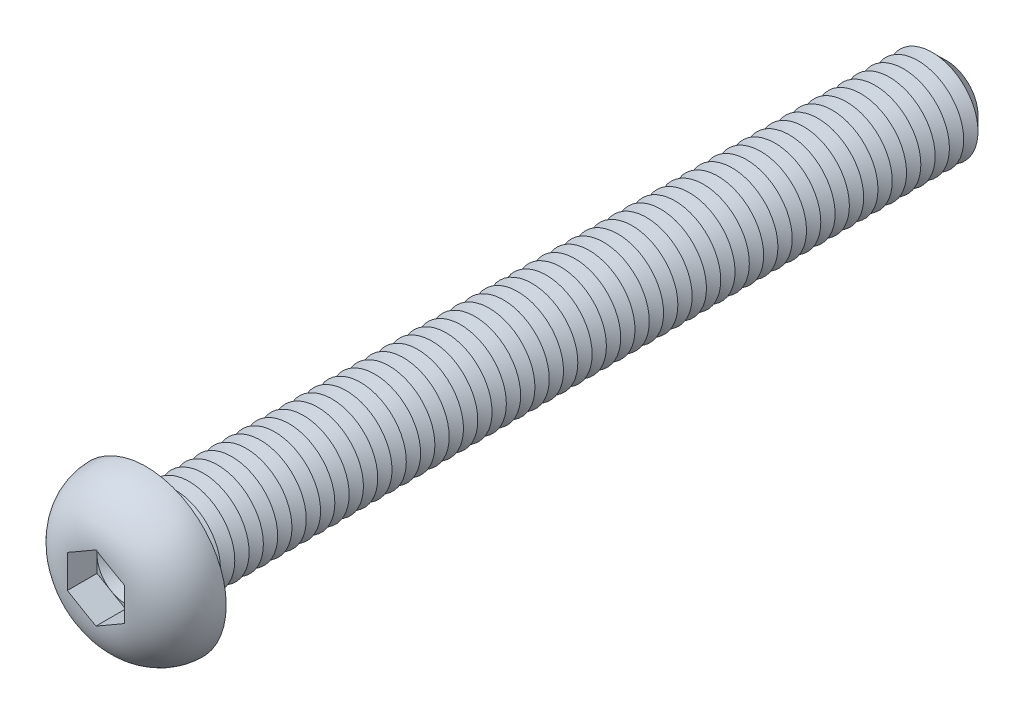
ISO-10303-21;
HEADER;
FILE_DESCRIPTION(('STEP AP214'),'2;1');
FILE_NAME('part.step','',(''),(''),'','','');
FILE_SCHEMA(('AUTOMOTIVE_DESIGN { 1 0 10303 214 1 1 1 1 }'));
ENDSEC;
DATA;
#1=APPLICATION_CONTEXT('core data for automotive mechanical design processes');
#2=APPLICATION_PROTOCOL_DEFINITION('international standard','automotive_design',2000,#1);
#3=PRODUCT_CONTEXT('',#1,'mechanical');
#4=PRODUCT('Part','Part','',(#3));
#5=PRODUCT_RELATED_PRODUCT_CATEGORY('part','',(#4));
#6=PRODUCT_DEFINITION_FORMATION('','',#4);
#7=PRODUCT_DEFINITION_CONTEXT('part definition',#1,'design');
#8=PRODUCT_DEFINITION('design','',#6,#7);
#9=PRODUCT_DEFINITION_SHAPE('','',#8);
#10=(LENGTH_UNIT() NAMED_UNIT(*) SI_UNIT(.MILLI.,.METRE.));
#11=(NAMED_UNIT(*) PLANE_ANGLE_UNIT() SI_UNIT($,.RADIAN.));
#12=(NAMED_UNIT(*) SI_UNIT($,.STERADIAN.) SOLID_ANGLE_UNIT());
#13=UNCERTAINTY_MEASURE_WITH_UNIT(LENGTH_MEASURE(1.E-05),#10,'distance_accuracy_value','');
#14=(GEOMETRIC_REPRESENTATION_CONTEXT(3) GLOBAL_UNCERTAINTY_ASSIGNED_CONTEXT((#13)) GLOBAL_UNIT_ASSIGNED_CONTEXT((#10,
#11,#12)) REPRESENTATION_CONTEXT('',''));
#15=CARTESIAN_POINT('',(0.,0.,0.));
#16=DIRECTION('',(0.,0.,1.));
#17=DIRECTION('',(1.,0.,0.));
#18=AXIS2_PLACEMENT_3D('',#15,#16,#17);
#19=CARTESIAN_POINT('',(0.,0.,1.8));
#20=DIRECTION('',(0.,0.,1.));
#21=DIRECTION('',(1.,0.,0.));
#22=AXIS2_PLACEMENT_3D('',#19,#20,#21);
#23=PLANE('',#22);
#24=CARTESIAN_POINT('',(0.,0.,1.8));
#25=DIRECTION('',(0.,0.,1.));
#26=DIRECTION('',(1.,0.,0.));
#27=AXIS2_PLACEMENT_3D('',#24,#25,#26);
#28=CIRCLE('',#27,2.5);
#29=CARTESIAN_POINT('',(2.5,0.,1.8));
#30=VERTEX_POINT('',#29);
#31=CARTESIAN_POINT('',(1.25,2.1650635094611,1.8));
#32=VERTEX_POINT('',#31);
#33=EDGE_CURVE('E153',#30,#32,#28,.T.);
#34=ORIENTED_EDGE('',*,*,#33,.F.);
#35=DIRECTION('',(0.,1.,0.));
#36=VECTOR('',#35,1.);
#37=CARTESIAN_POINT('',(2.5,-1.44337567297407,1.8));
#38=LINE('',#37,#36);
#39=CARTESIAN_POINT('',(2.5,1.44337567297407,1.8));
#40=VERTEX_POINT('',#39);
#41=EDGE_CURVE('E176',#30,#40,#38,.T.);
#42=ORIENTED_EDGE('',*,*,#41,.T.);
#43=DIRECTION('',(-0.866025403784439,0.5,0.));
#44=VECTOR('',#43,1.);
#45=CARTESIAN_POINT('',(2.5,1.44337567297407,1.8));
#46=LINE('',#45,#44);
#47=EDGE_CURVE('E172',#40,#32,#46,.T.);
#48=ORIENTED_EDGE('',*,*,#47,.T.);
#49=EDGE_LOOP('',(#34,#42,#48));
#50=FACE_BOUND('',#49,.T.);
#51=ADVANCED_FACE('F39',(#50),#23,.T.);
#52=CARTESIAN_POINT('',(0.,0.,1.8));
#53=DIRECTION('',(0.,0.,1.));
#54=DIRECTION('',(1.,0.,0.));
#55=AXIS2_PLACEMENT_3D('',#52,#53,#54);
#56=CIRCLE('',#55,2.5);
#57=CARTESIAN_POINT('',(-1.25,2.1650635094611,1.8));
#58=VERTEX_POINT('',#57);
#59=EDGE_CURVE('E11',#32,#58,#56,.T.);
#60=ORIENTED_EDGE('',*,*,#59,.F.);
#61=CARTESIAN_POINT('',(0.,2.88675134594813,1.8));
#62=VERTEX_POINT('',#61);
#63=EDGE_CURVE('E166',#32,#62,#46,.T.);
#64=ORIENTED_EDGE('',*,*,#63,.T.);
#65=DIRECTION('',(-0.866025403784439,-0.5,0.));
#66=VECTOR('',#65,1.);
#67=CARTESIAN_POINT('',(0.,2.88675134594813,1.8));
#68=LINE('',#67,#66);
#69=EDGE_CURVE('E167',#62,#58,#68,.T.);
#70=ORIENTED_EDGE('',*,*,#69,.T.);
#71=EDGE_LOOP('',(#60,#64,#70));
#72=FACE_BOUND('',#71,.T.);
#73=ADVANCED_FACE('F165',(#72),#23,.T.);
#74=CARTESIAN_POINT('',(-2.5,0.,1.8));
#75=VERTEX_POINT('',#74);
#76=EDGE_CURVE('E49',#58,#75,#56,.T.);
#77=ORIENTED_EDGE('',*,*,#76,.F.);
#78=CARTESIAN_POINT('',(-2.5,1.44337567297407,1.8));
#79=VERTEX_POINT('',#78);
#80=EDGE_CURVE('E179',#58,#79,#68,.T.);
#81=ORIENTED_EDGE('',*,*,#80,.T.);
#82=DIRECTION('',(0.,-1.,0.));
#83=VECTOR('',#82,1.);
#84=CARTESIAN_POINT('',(-2.5,1.44337567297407,1.8));
#85=LINE('',#84,#83);
#86=EDGE_CURVE('E190',#79,#75,#85,.T.);
#87=ORIENTED_EDGE('',*,*,#86,.T.);
#88=EDGE_LOOP('',(#77,#81,#87));
#89=FACE_BOUND('',#88,.T.);
#90=ADVANCED_FACE('F442',(#89),#23,.T.);
#91=CARTESIAN_POINT('',(-1.25,-2.1650635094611,1.8));
#92=VERTEX_POINT('',#91);
#93=EDGE_CURVE('E424',#75,#92,#56,.T.);
#94=ORIENTED_EDGE('',*,*,#93,.F.);
#95=CARTESIAN_POINT('',(-2.5,-1.44337567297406,1.8));
#96=VERTEX_POINT('',#95);
#97=EDGE_CURVE('E189',#75,#96,#85,.T.);
#98=ORIENTED_EDGE('',*,*,#97,.T.);
#99=DIRECTION('',(0.866025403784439,-0.5,0.));
#100=VECTOR('',#99,1.);
#101=CARTESIAN_POINT('',(-2.5,-1.44337567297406,1.8));
#102=LINE('',#101,#100);
#103=EDGE_CURVE('E195',#96,#92,#102,.T.);
#104=ORIENTED_EDGE('',*,*,#103,.T.);
#105=EDGE_LOOP('',(#94,#98,#104));
#106=FACE_BOUND('',#105,.T.);
#107=ADVANCED_FACE('F436',(#106),#23,.T.);
#108=CARTESIAN_POINT('',(1.25,-2.1650635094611,1.8));
#109=VERTEX_POINT('',#108);
#110=EDGE_CURVE('E56',#92,#109,#56,.T.);
#111=ORIENTED_EDGE('',*,*,#110,.F.);
#112=CARTESIAN_POINT('',(0.,-2.88675134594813,1.8));
#113=VERTEX_POINT('',#112);
#114=EDGE_CURVE('E194',#92,#113,#102,.T.);
#115=ORIENTED_EDGE('',*,*,#114,.T.);
#116=DIRECTION('',(0.866025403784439,0.5,0.));
#117=VECTOR('',#116,1.);
#118=CARTESIAN_POINT('',(0.,-2.88675134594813,1.8));
#119=LINE('',#118,#117);
#120=EDGE_CURVE('E200',#113,#109,#119,.T.);
#121=ORIENTED_EDGE('',*,*,#120,.T.);
#122=EDGE_LOOP('',(#111,#115,#121));
#123=FACE_BOUND('',#122,.T.);
#124=ADVANCED_FACE('F477',(#123),#23,.T.);
#125=CARTESIAN_POINT('',(0.,0.,-70.));
#126=DIRECTION('',(0.,0.,1.));
#127=DIRECTION('',(1.,0.,0.));
#128=AXIS2_PLACEMENT_3D('',#125,#126,#127);
#129=CYLINDRICAL_SURFACE('',#128,4.);
#130=CARTESIAN_POINT('',(0.,0.,-0.5));
#131=DIRECTION('',(0.,0.,1.));
#132=DIRECTION('',(1.,0.,0.));
#133=AXIS2_PLACEMENT_3D('',#130,#131,#132);
#134=CIRCLE('',#133,4.);
#135=CARTESIAN_POINT('',(4.,0.,-0.5));
#136=VERTEX_POINT('',#135);
#137=EDGE_CURVE('E411',#136,#136,#134,.F.);
#138=ORIENTED_EDGE('',*,*,#137,.T.);
#139=EDGE_LOOP('',(#138));
#140=FACE_BOUND('',#139,.T.);
#141=CARTESIAN_POINT('',(0.,0.,-1.25));
#142=DIRECTION('',(0.,0.,1.));
#143=DIRECTION('',(1.,0.,0.));
#144=AXIS2_PLACEMENT_3D('',#141,#142,#143);
#145=CIRCLE('',#144,4.00000000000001);
#146=CARTESIAN_POINT('',(4.00000000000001,0.,-1.25));
#147=VERTEX_POINT('',#146);
#148=EDGE_CURVE('E185',#147,#147,#145,.T.);
#149=ORIENTED_EDGE('',*,*,#148,.T.);
#150=EDGE_LOOP('',(#149));
#151=FACE_BOUND('',#150,.T.);
#152=ADVANCED_FACE('F472',(#140,#151),#129,.T.);
#153=CARTESIAN_POINT('',(0.,7.,0.));
#154=DIRECTION('',(0.,0.,1.));
#155=DIRECTION('',(1.,0.,0.));
#156=AXIS2_PLACEMENT_3D('',#153,#154,#155);
#157=PLANE('',#156);
#158=CARTESIAN_POINT('',(0.,0.,0.));
#159=DIRECTION('',(0.,0.,1.));
#160=DIRECTION('',(1.,0.,0.));
#161=AXIS2_PLACEMENT_3D('',#158,#159,#160);
#162=CIRCLE('',#161,4.5);
#163=CARTESIAN_POINT('',(4.5,0.,0.));
#164=VERTEX_POINT('',#163);
#165=EDGE_CURVE('E414',#164,#164,#162,.T.);
#166=ORIENTED_EDGE('',*,*,#165,.T.);
#167=EDGE_LOOP('',(#166));
#168=FACE_BOUND('',#167,.T.);
#169=CARTESIAN_POINT('',(0.,0.,0.));
#170=DIRECTION('',(0.,0.,1.));
#171=DIRECTION('',(1.,0.,0.));
#172=AXIS2_PLACEMENT_3D('',#169,#170,#171);
#173=CIRCLE('',#172,7.);
#174=CARTESIAN_POINT('',(7.,0.,0.));
#175=VERTEX_POINT('',#174);
#176=EDGE_CURVE('E211',#175,#175,#173,.T.);
#177=ORIENTED_EDGE('',*,*,#176,.F.);
#178=EDGE_LOOP('',(#177));
#179=FACE_BOUND('',#178,.T.);
#180=ADVANCED_FACE('F470',(#168,#179),#157,.F.);
#181=CARTESIAN_POINT('',(0.,0.,-0.1));
#182=DIRECTION('',(0.,0.,1.));
#183=DIRECTION('',(1.,0.,0.));
#184=AXIS2_PLACEMENT_3D('',#181,#182,#183);
#185=DEGENERATE_TOROIDAL_SURFACE('',#184,2.5011112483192,4.5,.T.);
#186=CARTESIAN_POINT('',(1.31456088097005,2.12778926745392,4.4));
#187=DIRECTION('',(-0.866025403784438,0.500000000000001,0.));
#188=VECTOR('',#187,1.);
#189=LINE('',#186,#188);
#190=CARTESIAN_POINT('',(1.31456088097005,2.12778926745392,4.4));
#191=VERTEX_POINT('',#190);
#192=CARTESIAN_POINT('',(1.18543911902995,2.20233775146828,4.4));
#193=VERTEX_POINT('',#192);
#194=EDGE_CURVE('E399',#191,#193,#189,.T.);
#195=ORIENTED_EDGE('',*,*,#194,.F.);
#196=CARTESIAN_POINT('',(-0.000200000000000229,2.88686681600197,4.38343536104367));
#197=CARTESIAN_POINT('',(0.103935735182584,2.82674402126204,4.38859262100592));
#198=CARTESIAN_POINT('',(0.208111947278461,2.76659785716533,4.39207570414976));
#199=CARTESIAN_POINT('',(0.416486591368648,2.64629270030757,4.39683754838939));
#200=CARTESIAN_POINT('',(0.520685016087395,2.58613371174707,4.39811670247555));
#201=CARTESIAN_POINT('',(0.729066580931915,2.46582455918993,4.3996156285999));
#202=CARTESIAN_POINT('',(0.833249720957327,2.40567439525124,4.39983556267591));
#203=CARTESIAN_POINT('',(1.04162190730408,2.2853706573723,4.4000276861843));
#204=CARTESIAN_POINT('',(1.14581095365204,2.2252170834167,4.39999986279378));
#205=CARTESIAN_POINT('',(1.35418904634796,2.10490993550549,4.39999986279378));
#206=CARTESIAN_POINT('',(1.45837809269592,2.04475636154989,4.4000276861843));
#207=CARTESIAN_POINT('',(1.66675027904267,1.92445262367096,4.39983556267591));
#208=CARTESIAN_POINT('',(1.77093341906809,1.86430245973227,4.3996156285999));
#209=CARTESIAN_POINT('',(1.97931498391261,1.74399330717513,4.39811670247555));
#210=CARTESIAN_POINT('',(2.08351340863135,1.68383431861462,4.39683754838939));
#211=CARTESIAN_POINT('',(2.29188805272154,1.56352916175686,4.39207570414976));
#212=CARTESIAN_POINT('',(2.39606426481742,1.50338299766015,4.38859262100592));
#213=CARTESIAN_POINT('',(2.5002,1.44326020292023,4.38343536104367));
#214=B_SPLINE_CURVE_WITH_KNOTS('',3,(#196,#197,#198,#199,#200,#201,#202,#203,#204,#205,#206,
#207,#208,#209,#210,#211,#212,#213),.UNSPECIFIED.,.F.,.F.,(4,2,2,2,2,2,2,2,4),(0.,
0.361022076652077,0.721979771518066,1.08288224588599,1.44380339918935,1.80472455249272,
2.16562702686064,2.52658472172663,2.88760679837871),.UNSPECIFIED.);
#215=CARTESIAN_POINT('',(2.5,1.44337567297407,4.38344529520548));
#216=VERTEX_POINT('',#215);
#217=EDGE_CURVE('E355',#191,#216,#214,.T.);
#218=ORIENTED_EDGE('',*,*,#217,.T.);
#219=CARTESIAN_POINT('',(2.5,0.,4.39999986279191));
#220=CARTESIAN_POINT('',(2.5,-0.104697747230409,4.39999811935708));
#221=CARTESIAN_POINT('',(2.5,-0.209395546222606,4.40001551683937));
#222=CARTESIAN_POINT('',(2.5,-0.418792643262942,4.39990807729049));
#223=CARTESIAN_POINT('',(2.5,-0.52349194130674,4.39978323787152));
#224=CARTESIAN_POINT('',(2.5,-0.732936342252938,4.39891238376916));
#225=CARTESIAN_POINT('',(2.5,-0.837681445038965,4.39816609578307));
#226=CARTESIAN_POINT('',(2.5,-1.04715282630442,4.39536239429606));
#227=CARTESIAN_POINT('',(2.5,-1.15187910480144,4.39330498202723));
#228=CARTESIAN_POINT('',(2.5,-1.46476484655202,4.38400647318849));
#229=CARTESIAN_POINT('',(2.5,-1.67286375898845,4.37365196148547));
#230=CARTESIAN_POINT('',(2.5,-2.08783281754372,4.33852954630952));
#231=CARTESIAN_POINT('',(2.5,-2.29470379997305,4.31377296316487));
#232=CARTESIAN_POINT('',(2.5,-2.64451002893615,4.25536510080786));
#233=CARTESIAN_POINT('',(2.5,-2.78823975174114,4.22651785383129));
#234=CARTESIAN_POINT('',(2.5,-3.073224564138,4.15827060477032));
#235=CARTESIAN_POINT('',(2.5,-3.21447933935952,4.11886927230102));
#236=CARTESIAN_POINT('',(2.5,-3.49353952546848,4.02870287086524));
#237=CARTESIAN_POINT('',(2.5,-3.6313402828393,3.97792330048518));
#238=CARTESIAN_POINT('',(2.5,-3.90204977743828,3.86463774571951));
#239=CARTESIAN_POINT('',(2.5,-4.0349587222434,3.8021322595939));
#240=CARTESIAN_POINT('',(2.5,-4.2956525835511,3.66474880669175));
#241=CARTESIAN_POINT('',(2.5,-4.42338586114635,3.58977252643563));
#242=CARTESIAN_POINT('',(2.5,-4.67118559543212,3.42803136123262));
#243=CARTESIAN_POINT('',(2.5,-4.79125159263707,3.3412657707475));
#244=CARTESIAN_POINT('',(2.5,-5.02233156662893,3.15645800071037));
#245=CARTESIAN_POINT('',(2.5,-5.13334771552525,3.05841854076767));
#246=CARTESIAN_POINT('',(2.5,-5.34506083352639,2.85177471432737));
#247=CARTESIAN_POINT('',(2.5,-5.44575933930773,2.74317192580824));
#248=CARTESIAN_POINT('',(2.5,-5.62335564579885,2.53102225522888));
#249=CARTESIAN_POINT('',(2.5,-5.70164721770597,2.42863868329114));
#250=CARTESIAN_POINT('',(2.5,-5.84882394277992,2.21725758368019));
#251=CARTESIAN_POINT('',(2.5,-5.91770588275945,2.10825781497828));
#252=CARTESIAN_POINT('',(2.5,-6.04532926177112,1.88460009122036));
#253=CARTESIAN_POINT('',(2.5,-6.1040794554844,1.76994713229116));
#254=CARTESIAN_POINT('',(2.5,-6.21098181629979,1.53574793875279));
#255=CARTESIAN_POINT('',(2.5,-6.25913021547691,1.41619998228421));
#256=CARTESIAN_POINT('',(2.5,-6.34173830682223,1.18065209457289));
#257=CARTESIAN_POINT('',(2.5,-6.37685491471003,1.06488207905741));
#258=CARTESIAN_POINT('',(2.5,-6.43703913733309,0.830714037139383));
#259=CARTESIAN_POINT('',(2.5,-6.46210319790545,0.712315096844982));
#260=CARTESIAN_POINT('',(2.5,-6.50194044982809,0.473848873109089));
#261=CARTESIAN_POINT('',(2.5,-6.51671856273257,0.353782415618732));
#262=CARTESIAN_POINT('',(2.5,-6.53588982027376,0.112808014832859));
#263=CARTESIAN_POINT('',(2.5,-6.54027911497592,-0.00810022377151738));
#264=CARTESIAN_POINT('',(2.5,-6.53779027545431,-0.365870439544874));
#265=CARTESIAN_POINT('',(2.5,-6.51607942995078,-0.602790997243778));
#266=CARTESIAN_POINT('',(2.5,-6.43310265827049,-1.06957107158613));
#267=CARTESIAN_POINT('',(2.5,-6.3718398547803,-1.29943114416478));
#268=CARTESIAN_POINT('',(2.5,-6.25195024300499,-1.63390601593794));
#269=CARTESIAN_POINT('',(2.5,-6.20730237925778,-1.74371189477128));
#270=CARTESIAN_POINT('',(2.5,-6.10902350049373,-1.95921136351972));
#271=CARTESIAN_POINT('',(2.5,-6.05539567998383,-2.06490639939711));
#272=CARTESIAN_POINT('',(2.5,-5.93955620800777,-2.27152527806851));
#273=CARTESIAN_POINT('',(2.5,-5.87734126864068,-2.37244727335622));
#274=CARTESIAN_POINT('',(2.5,-5.7448545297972,-2.56880727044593));
#275=CARTESIAN_POINT('',(2.5,-5.67458537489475,-2.6642470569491));
#276=CARTESIAN_POINT('',(2.5,-5.52523018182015,-2.85070592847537));
#277=CARTESIAN_POINT('',(2.5,-5.44601185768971,-2.94161901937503));
#278=CARTESIAN_POINT('',(2.5,-5.28044044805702,-3.11663859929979));
#279=CARTESIAN_POINT('',(2.5,-5.194089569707,-3.2007471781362));
#280=CARTESIAN_POINT('',(2.5,-5.01485870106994,-3.36178408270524));
#281=CARTESIAN_POINT('',(2.5,-4.92197538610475,-3.43870870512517));
#282=CARTESIAN_POINT('',(2.5,-4.73045535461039,-3.58495812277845));
#283=CARTESIAN_POINT('',(2.5,-4.6318202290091,-3.65428500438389));
#284=CARTESIAN_POINT('',(2.5,-4.4247626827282,-3.78818551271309));
#285=CARTESIAN_POINT('',(2.5,-4.31609824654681,-3.85238474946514));
#286=CARTESIAN_POINT('',(2.5,-4.0940582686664,-3.97208975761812));
#287=CARTESIAN_POINT('',(2.5,-3.98068153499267,-4.02759331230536));
#288=CARTESIAN_POINT('',(2.5,-3.75029026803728,-4.12981004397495));
#289=CARTESIAN_POINT('',(2.5,-3.63328275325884,-4.17653908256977));
#290=CARTESIAN_POINT('',(2.5,-3.39631992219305,-4.2614893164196));
#291=CARTESIAN_POINT('',(2.5,-3.27636651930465,-4.29971587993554));
#292=CARTESIAN_POINT('',(2.5,-3.00446622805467,-4.37644925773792));
#293=CARTESIAN_POINT('',(2.5,-2.85188931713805,-4.41272455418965));
#294=CARTESIAN_POINT('',(2.5,-2.54443794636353,-4.47385449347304));
#295=CARTESIAN_POINT('',(2.5,-2.3895624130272,-4.49870361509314));
#296=CARTESIAN_POINT('',(2.5,-2.07807451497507,-4.53870829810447));
#297=CARTESIAN_POINT('',(2.5,-1.92145805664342,-4.55383091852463));
#298=CARTESIAN_POINT('',(2.5,-1.60772330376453,-4.57647936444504));
#299=CARTESIAN_POINT('',(2.5,-1.45060502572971,-4.58400543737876));
#300=CARTESIAN_POINT('',(2.5,-1.13432460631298,-4.59416656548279));
#301=CARTESIAN_POINT('',(2.5,-0.975160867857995,-4.59674096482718));
#302=CARTESIAN_POINT('',(2.5,-0.656826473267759,-4.59957813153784));
#303=CARTESIAN_POINT('',(2.5,-0.497655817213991,-4.59984092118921));
#304=CARTESIAN_POINT('',(2.5,-0.179547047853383,-4.60005428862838));
#305=CARTESIAN_POINT('',(2.5,-0.02060893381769,-4.60000532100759));
#306=CARTESIAN_POINT('',(2.5,0.297265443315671,-4.59999304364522));
#307=CARTESIAN_POINT('',(2.5,0.456201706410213,-4.60002973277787));
#308=CARTESIAN_POINT('',(2.5,0.70967559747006,-4.59902611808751));
#309=CARTESIAN_POINT('',(2.5,0.804213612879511,-4.59841616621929));
#310=CARTESIAN_POINT('',(2.5,0.99327694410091,-4.59620676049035));
#311=CARTESIAN_POINT('',(2.5,1.08780225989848,-4.59460730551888));
#312=CARTESIAN_POINT('',(2.5,1.37137837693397,-4.58746770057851));
#313=CARTESIAN_POINT('',(2.5,1.56039301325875,-4.57958602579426));
#314=CARTESIAN_POINT('',(2.5,1.93609462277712,-4.55305686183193));
#315=CARTESIAN_POINT('',(2.5,2.12278756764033,-4.53450331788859));
#316=CARTESIAN_POINT('',(2.5,2.49421016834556,-4.48296248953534));
#317=CARTESIAN_POINT('',(2.5,2.67894050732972,-4.44998040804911));
#318=CARTESIAN_POINT('',(2.5,2.99962701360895,-4.37718406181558));
#319=CARTESIAN_POINT('',(2.5,3.13641465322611,-4.34103978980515));
#320=CARTESIAN_POINT('',(2.5,3.40682838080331,-4.25834226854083));
#321=CARTESIAN_POINT('',(2.5,3.54045461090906,-4.21178948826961));
#322=CARTESIAN_POINT('',(2.5,3.80387940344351,-4.1076796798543));
#323=CARTESIAN_POINT('',(2.5,3.93366385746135,-4.05008679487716));
#324=CARTESIAN_POINT('',(2.5,4.18776789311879,-3.92385886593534));
#325=CARTESIAN_POINT('',(2.5,4.31208736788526,-3.85522360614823));
#326=CARTESIAN_POINT('',(2.5,4.55475418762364,-3.70660227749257));
#327=CARTESIAN_POINT('',(2.5,4.67306276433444,-3.62655275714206));
#328=CARTESIAN_POINT('',(2.5,4.90171316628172,-3.45576294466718));
#329=CARTESIAN_POINT('',(2.5,5.01205476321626,-3.36502234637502));
#330=CARTESIAN_POINT('',(2.5,5.22347091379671,-3.17353376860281));
#331=CARTESIAN_POINT('',(2.5,5.32455555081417,-3.07279693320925));
#332=CARTESIAN_POINT('',(2.5,5.51647993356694,-2.86200023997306));
#333=CARTESIAN_POINT('',(2.5,5.6073208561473,-2.75194145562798));
#334=CARTESIAN_POINT('',(2.5,5.76832451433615,-2.53607083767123));
#335=CARTESIAN_POINT('',(2.5,5.83966300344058,-2.4311337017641));
#336=CARTESIAN_POINT('',(2.5,5.97282702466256,-2.2153291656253));
#337=CARTESIAN_POINT('',(2.5,6.03464926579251,-2.10445973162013));
#338=CARTESIAN_POINT('',(2.5,6.14815657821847,-1.87771731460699));
#339=CARTESIAN_POINT('',(2.5,6.19984675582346,-1.76184688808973));
#340=CARTESIAN_POINT('',(2.5,6.29267395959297,-1.52590109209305));
#341=CARTESIAN_POINT('',(2.5,6.33380720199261,-1.40582423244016));
#342=CARTESIAN_POINT('',(2.5,6.40328888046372,-1.16869740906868));
#343=CARTESIAN_POINT('',(2.5,6.43218419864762,-1.05180738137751));
#344=CARTESIAN_POINT('',(2.5,6.47988151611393,-0.815941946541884));
#345=CARTESIAN_POINT('',(2.5,6.49867991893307,-0.696965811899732));
#346=CARTESIAN_POINT('',(2.5,6.52599950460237,-0.457898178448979));
#347=CARTESIAN_POINT('',(2.5,6.53452634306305,-0.337807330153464));
#348=CARTESIAN_POINT('',(2.5,6.54126106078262,-0.0973214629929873));
#349=CARTESIAN_POINT('',(2.5,6.5394651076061,0.023073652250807));
#350=CARTESIAN_POINT('',(2.5,6.51879545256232,0.379398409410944));
#351=CARTESIAN_POINT('',(2.5,6.48510560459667,0.614630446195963));
#352=CARTESIAN_POINT('',(2.5,6.37872360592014,1.07608887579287));
#353=CARTESIAN_POINT('',(2.5,6.30603128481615,1.3023152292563));
#354=CARTESIAN_POINT('',(2.5,6.16957161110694,1.63028303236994));
#355=CARTESIAN_POINT('',(2.5,6.11941470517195,1.7378698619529));
#356=CARTESIAN_POINT('',(2.5,6.01034124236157,1.94849153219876));
#357=CARTESIAN_POINT('',(2.5,5.9514277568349,2.05152795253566));
#358=CARTESIAN_POINT('',(2.5,5.82528890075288,2.25240256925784));
#359=CARTESIAN_POINT('',(2.5,5.75806159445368,2.35023954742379));
#360=CARTESIAN_POINT('',(2.5,5.61585543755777,2.54005689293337));
#361=CARTESIAN_POINT('',(2.5,5.54087908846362,2.63203913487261));
#362=CARTESIAN_POINT('',(2.5,5.38212190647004,2.81146438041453));
#363=CARTESIAN_POINT('',(2.5,5.29819182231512,2.89877528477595));
#364=CARTESIAN_POINT('',(2.5,5.12353712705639,3.06625194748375));
#365=CARTESIAN_POINT('',(2.5,5.03281455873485,3.14641983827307));
#366=CARTESIAN_POINT('',(2.5,4.84518171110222,3.29930665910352));
#367=CARTESIAN_POINT('',(2.5,4.74826657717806,3.37201962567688));
#368=CARTESIAN_POINT('',(2.5,4.54907485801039,3.50961479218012));
#369=CARTESIAN_POINT('',(2.5,4.44679969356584,3.57449905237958));
#370=CARTESIAN_POINT('',(2.5,4.23202545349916,3.69953578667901));
#371=CARTESIAN_POINT('',(2.5,4.11927203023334,3.75925114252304));
#372=CARTESIAN_POINT('',(2.5,3.88947986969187,3.86977617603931));
#373=CARTESIAN_POINT('',(2.5,3.77244067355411,3.92058489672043));
#374=CARTESIAN_POINT('',(2.5,3.5351804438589,4.0133148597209));
#375=CARTESIAN_POINT('',(2.5,3.41496637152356,4.0552539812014));
#376=CARTESIAN_POINT('',(2.5,3.17195278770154,4.13067246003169));
#377=CARTESIAN_POINT('',(2.5,3.04915378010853,4.16415344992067));
#378=CARTESIAN_POINT('',(2.5,2.80683027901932,4.22194717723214));
#379=CARTESIAN_POINT('',(2.5,2.68738216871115,4.2465834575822));
#380=CARTESIAN_POINT('',(2.5,2.44729214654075,4.28920746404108));
#381=CARTESIAN_POINT('',(2.5,2.32664997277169,4.30719369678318));
#382=CARTESIAN_POINT('',(2.5,2.08450864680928,4.33736171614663));
#383=CARTESIAN_POINT('',(2.5,1.9630086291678,4.3495363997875));
#384=CARTESIAN_POINT('',(2.5,1.71961501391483,4.36908103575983));
#385=CARTESIAN_POINT('',(2.5,1.59772134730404,4.37645009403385));
#386=CARTESIAN_POINT('',(2.5,1.35283283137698,4.38761579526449));
#387=CARTESIAN_POINT('',(2.5,1.22983679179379,4.39138420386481));
#388=CARTESIAN_POINT('',(2.5,0.983808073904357,4.3965493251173));
#389=CARTESIAN_POINT('',(2.5,0.860775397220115,4.3979461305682));
#390=CARTESIAN_POINT('',(2.5,0.614783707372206,4.39958107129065));
#391=CARTESIAN_POINT('',(2.5,0.491824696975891,4.3998199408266));
#392=CARTESIAN_POINT('',(2.5,0.245910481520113,4.40003035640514));
#393=CARTESIAN_POINT('',(2.5,0.122955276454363,4.4000019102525));
#394=CARTESIAN_POINT('',(2.5,0.,4.39999986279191));
#395=B_SPLINE_CURVE_WITH_KNOTS('',3,(#219,#220,#221,#222,#223,#224,#225,#226,#227,#228,#229,
#230,#231,#232,#233,#234,#235,#236,#237,#238,#239,#240,#241,#242,#243,#244,#245,#246,#247,#248,
#249,#250,#251,#252,#253,#254,#255,#256,#257,#258,#259,#260,#261,#262,#263,#264,#265,#266,#267,
#268,#269,#270,#271,#272,#273,#274,#275,#276,#277,#278,#279,#280,#281,#282,#283,#284,#285,#286,
#287,#288,#289,#290,#291,#292,#293,#294,#295,#296,#297,#298,#299,#300,#301,#302,#303,#304,#305,
#306,#307,#308,#309,#310,#311,#312,#313,#314,#315,#316,#317,#318,#319,#320,#321,#322,#323,#324,
#325,#326,#327,#328,#329,#330,#331,#332,#333,#334,#335,#336,#337,#338,#339,#340,#341,#342,#343,
#344,#345,#346,#347,#348,#349,#350,#351,#352,#353,#354,#355,#356,#357,#358,#359,#360,#361,#362,
#363,#364,#365,#366,#367,#368,#369,#370,#371,#372,#373,#374,#375,#376,#377,#378,#379,#380,#381,
#382,#383,#384,#385,#386,#387,#388,#389,#390,#391,#392,#393,#394),.UNSPECIFIED.,.T.,.F.,(4,2,2,
2,2,2,2,2,2,2,2,2,2,2,2,2,2,2,2,2,2,2,2,2,2,2,2,2,2,2,2,2,2,2,2,2,2,2,2,2,2,2,2,2,2,2,2,2,2,2,2,
2,2,2,2,2,2,2,2,2,2,2,2,2,2,2,2,2,2,2,2,2,2,2,2,2,2,2,2,2,2,2,2,2,2,2,2,4),(0.,
0.314093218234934,0.62819170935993,0.942428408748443,1.25666481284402,1.88144147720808,
2.50572771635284,2.94516878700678,3.38466527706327,3.82472511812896,4.26476626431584,
4.70845695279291,5.15217420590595,5.59578464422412,6.03932891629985,6.42549664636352,
6.81179591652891,7.19775970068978,7.58386043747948,7.94635637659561,8.30898036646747,
8.67143073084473,9.03401539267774,9.74414367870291,10.4542159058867,10.8094792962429,
11.1646165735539,11.5198902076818,11.8750475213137,12.2363927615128,12.597626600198,
12.9590456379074,13.3203651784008,13.698597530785,14.0769261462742,14.4545641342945,
14.8319630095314,15.3019396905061,15.7721432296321,16.2439309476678,16.715703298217,
17.1932187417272,17.6707295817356,18.1475442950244,18.6243527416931,18.9079682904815,
19.1915841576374,19.7589248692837,20.3213460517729,20.8835645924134,21.3076400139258,
21.731696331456,22.1571540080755,22.5826200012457,23.0105507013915,23.4384936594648,
23.8659647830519,24.2933867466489,24.6735755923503,25.0538956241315,25.4340234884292,
25.8142874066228,26.1750761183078,26.5359932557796,26.8967115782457,27.2575638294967,
27.9668653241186,28.6761699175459,29.0319382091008,29.3875820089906,29.7433087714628,
30.0989210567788,30.4618400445,30.8246503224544,31.1877485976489,31.5507511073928,
31.9331198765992,32.3155297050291,32.6971611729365,33.0787189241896,33.4443988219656,
33.8101607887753,34.1763686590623,34.54264464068,34.9117697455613,35.2808804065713,
35.6497569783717,36.0186227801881),.UNSPECIFIED.);
#396=CARTESIAN_POINT('',(2.5,0.0745484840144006,4.4));
#397=VERTEX_POINT('',#396);
#398=EDGE_CURVE('E345',#216,#397,#395,.T.);
#399=ORIENTED_EDGE('',*,*,#398,.T.);
#400=CARTESIAN_POINT('',(2.5,-0.0745484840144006,4.4));
#401=DIRECTION('',(0.,1.,0.));
#402=VECTOR('',#401,1.);
#403=LINE('',#400,#402);
#404=CARTESIAN_POINT('',(2.5,-0.0745484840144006,4.4));
#405=VERTEX_POINT('',#404);
#406=EDGE_CURVE('E174',#405,#397,#403,.T.);
#407=ORIENTED_EDGE('',*,*,#406,.F.);
#408=CARTESIAN_POINT('',(2.5,-1.44337567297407,4.38344529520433));
#409=VERTEX_POINT('',#408);
#410=EDGE_CURVE('E356',#405,#409,#395,.T.);
#411=ORIENTED_EDGE('',*,*,#410,.T.);
#412=CARTESIAN_POINT('',(2.5002,-1.44326020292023,4.38343536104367));
#413=CARTESIAN_POINT('',(2.39606426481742,-1.50338299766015,4.38859262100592));
#414=CARTESIAN_POINT('',(2.29188805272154,-1.56352916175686,4.39207570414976));
#415=CARTESIAN_POINT('',(2.08351340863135,-1.68383431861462,4.39683754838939));
#416=CARTESIAN_POINT('',(1.9793149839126,-1.74399330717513,4.39811670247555));
#417=CARTESIAN_POINT('',(1.77093341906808,-1.86430245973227,4.3996156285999));
#418=CARTESIAN_POINT('',(1.66675027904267,-1.92445262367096,4.39983556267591));
#419=CARTESIAN_POINT('',(1.45837809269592,-2.04475636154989,4.4000276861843));
#420=CARTESIAN_POINT('',(1.35418904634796,-2.10490993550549,4.39999986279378));
#421=CARTESIAN_POINT('',(1.14581095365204,-2.2252170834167,4.39999986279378));
#422=CARTESIAN_POINT('',(1.04162190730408,-2.2853706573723,4.4000276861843));
#423=CARTESIAN_POINT('',(0.833249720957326,-2.40567439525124,4.39983556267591));
#424=CARTESIAN_POINT('',(0.729066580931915,-2.46582455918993,4.3996156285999));
#425=CARTESIAN_POINT('',(0.520685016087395,-2.58613371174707,4.39811670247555));
#426=CARTESIAN_POINT('',(0.416486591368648,-2.64629270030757,4.39683754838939));
#427=CARTESIAN_POINT('',(0.208111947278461,-2.76659785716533,4.39207570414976));
#428=CARTESIAN_POINT('',(0.103935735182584,-2.82674402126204,4.38859262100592));
#429=CARTESIAN_POINT('',(-0.000200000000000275,-2.88686681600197,4.38343536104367));
#430=B_SPLINE_CURVE_WITH_KNOTS('',3,(#412,#413,#414,#415,#416,#417,#418,#419,#420,#421,#422,
#423,#424,#425,#426,#427,#428,#429),.UNSPECIFIED.,.F.,.F.,(4,2,2,2,2,2,2,2,4),(0.,
0.361022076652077,0.721979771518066,1.08288224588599,1.44380339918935,1.80472455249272,
2.16562702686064,2.52658472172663,2.88760679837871),.UNSPECIFIED.);
#431=CARTESIAN_POINT('',(1.31456088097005,-2.12778926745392,4.4));
#432=VERTEX_POINT('',#431);
#433=EDGE_CURVE('E332',#409,#432,#430,.T.);
#434=ORIENTED_EDGE('',*,*,#433,.T.);
#435=CARTESIAN_POINT('',(1.18543911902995,-2.20233775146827,4.4));
#436=DIRECTION('',(0.866025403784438,0.500000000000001,0.));
#437=VECTOR('',#436,1.);
#438=LINE('',#435,#437);
#439=CARTESIAN_POINT('',(1.18543911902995,-2.20233775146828,4.4));
#440=VERTEX_POINT('',#439);
#441=EDGE_CURVE('E341',#440,#432,#438,.T.);
#442=ORIENTED_EDGE('',*,*,#441,.F.);
#443=CARTESIAN_POINT('',(0.,-2.88675134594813,4.38344529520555));
#444=VERTEX_POINT('',#443);
#445=EDGE_CURVE('E295',#440,#444,#430,.T.);
#446=ORIENTED_EDGE('',*,*,#445,.T.);
#447=CARTESIAN_POINT('',(0.00019999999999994,-2.88686681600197,4.38343536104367));
#448=CARTESIAN_POINT('',(-0.103935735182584,-2.82674402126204,4.38859262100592));
#449=CARTESIAN_POINT('',(-0.208111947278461,-2.76659785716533,4.39207570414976));
#450=CARTESIAN_POINT('',(-0.416486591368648,-2.64629270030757,4.39683754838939));
#451=CARTESIAN_POINT('',(-0.520685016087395,-2.58613371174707,4.39811670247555));
#452=CARTESIAN_POINT('',(-0.729066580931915,-2.46582455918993,4.3996156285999));
#453=CARTESIAN_POINT('',(-0.833249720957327,-2.40567439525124,4.39983556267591));
#454=CARTESIAN_POINT('',(-1.04162190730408,-2.2853706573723,4.4000276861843));
#455=CARTESIAN_POINT('',(-1.14581095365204,-2.2252170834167,4.39999986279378));
#456=CARTESIAN_POINT('',(-1.35418904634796,-2.10490993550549,4.39999986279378));
#457=CARTESIAN_POINT('',(-1.45837809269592,-2.04475636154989,4.4000276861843));
#458=CARTESIAN_POINT('',(-1.66675027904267,-1.92445262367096,4.39983556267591));
#459=CARTESIAN_POINT('',(-1.77093341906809,-1.86430245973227,4.3996156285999));
#460=CARTESIAN_POINT('',(-1.97931498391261,-1.74399330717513,4.39811670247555));
#461=CARTESIAN_POINT('',(-2.08351340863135,-1.68383431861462,4.39683754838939));
#462=CARTESIAN_POINT('',(-2.29188805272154,-1.56352916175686,4.39207570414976));
#463=CARTESIAN_POINT('',(-2.39606426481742,-1.50338299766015,4.38859262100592));
#464=CARTESIAN_POINT('',(-2.5002,-1.44326020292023,4.38343536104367));
#465=B_SPLINE_CURVE_WITH_KNOTS('',3,(#447,#448,#449,#450,#451,#452,#453,#454,#455,#456,#457,
#458,#459,#460,#461,#462,#463,#464),.UNSPECIFIED.,.F.,.F.,(4,2,2,2,2,2,2,2,4),(0.,
0.361022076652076,0.721979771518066,1.08288224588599,1.44380339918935,1.80472455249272,
2.16562702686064,2.52658472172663,2.88760679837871),.UNSPECIFIED.);
#466=CARTESIAN_POINT('',(-1.18543911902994,-2.20233775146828,4.4));
#467=VERTEX_POINT('',#466);
#468=EDGE_CURVE('E285',#444,#467,#465,.T.);
#469=ORIENTED_EDGE('',*,*,#468,.T.);
#470=CARTESIAN_POINT('',(-1.31456088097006,-2.12778926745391,4.4));
#471=DIRECTION('',(0.86602540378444,-0.499999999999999,0.));
#472=VECTOR('',#471,1.);
#473=LINE('',#470,#472);
#474=CARTESIAN_POINT('',(-1.31456088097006,-2.12778926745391,4.4));
#475=VERTEX_POINT('',#474);
#476=EDGE_CURVE('E933',#475,#467,#473,.T.);
#477=ORIENTED_EDGE('',*,*,#476,.F.);
#478=CARTESIAN_POINT('',(-2.5,-1.44337567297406,4.38344529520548));
#479=VERTEX_POINT('',#478);
#480=EDGE_CURVE('E296',#475,#479,#465,.T.);
#481=ORIENTED_EDGE('',*,*,#480,.T.);
#482=CARTESIAN_POINT('',(-2.5,0.,4.39999986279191));
#483=CARTESIAN_POINT('',(-2.5,0.104697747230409,4.39999811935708));
#484=CARTESIAN_POINT('',(-2.5,0.209395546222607,4.40001551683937));
#485=CARTESIAN_POINT('',(-2.5,0.418792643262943,4.39990807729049));
#486=CARTESIAN_POINT('',(-2.5,0.523491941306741,4.39978323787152));
#487=CARTESIAN_POINT('',(-2.5,0.732936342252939,4.39891238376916));
#488=CARTESIAN_POINT('',(-2.5,0.837681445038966,4.39816609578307));
#489=CARTESIAN_POINT('',(-2.5,1.04715282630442,4.39536239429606));
#490=CARTESIAN_POINT('',(-2.5,1.15187910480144,4.39330498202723));
#491=CARTESIAN_POINT('',(-2.5,1.46476484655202,4.38400647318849));
#492=CARTESIAN_POINT('',(-2.5,1.67286375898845,4.37365196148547));
#493=CARTESIAN_POINT('',(-2.5,2.08783281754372,4.33852954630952));
#494=CARTESIAN_POINT('',(-2.5,2.29470379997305,4.31377296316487));
#495=CARTESIAN_POINT('',(-2.5,2.64451002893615,4.25536510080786));
#496=CARTESIAN_POINT('',(-2.5,2.78823975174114,4.22651785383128));
#497=CARTESIAN_POINT('',(-2.5,3.073224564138,4.15827060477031));
#498=CARTESIAN_POINT('',(-2.5,3.21447933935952,4.11886927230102));
#499=CARTESIAN_POINT('',(-2.5,3.49353952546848,4.02870287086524));
#500=CARTESIAN_POINT('',(-2.5,3.6313402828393,3.97792330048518));
#501=CARTESIAN_POINT('',(-2.5,3.90204977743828,3.8646377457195));
#502=CARTESIAN_POINT('',(-2.5,4.0349587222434,3.8021322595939));
#503=CARTESIAN_POINT('',(-2.5,4.2956525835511,3.66474880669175));
#504=CARTESIAN_POINT('',(-2.5,4.42338586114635,3.58977252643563));
#505=CARTESIAN_POINT('',(-2.5,4.67118559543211,3.42803136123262));
#506=CARTESIAN_POINT('',(-2.5,4.79125159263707,3.3412657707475));
#507=CARTESIAN_POINT('',(-2.5,5.02233156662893,3.15645800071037));
#508=CARTESIAN_POINT('',(-2.5,5.13334771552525,3.05841854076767));
#509=CARTESIAN_POINT('',(-2.5,5.34506083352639,2.85177471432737));
#510=CARTESIAN_POINT('',(-2.5,5.44575933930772,2.74317192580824));
#511=CARTESIAN_POINT('',(-2.5,5.62335564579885,2.53102225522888));
#512=CARTESIAN_POINT('',(-2.5,5.70164721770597,2.42863868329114));
#513=CARTESIAN_POINT('',(-2.5,5.84882394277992,2.21725758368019));
#514=CARTESIAN_POINT('',(-2.5,5.91770588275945,2.10825781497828));
#515=CARTESIAN_POINT('',(-2.5,6.04532926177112,1.88460009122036));
#516=CARTESIAN_POINT('',(-2.5,6.1040794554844,1.76994713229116));
#517=CARTESIAN_POINT('',(-2.5,6.21098181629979,1.53574793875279));
#518=CARTESIAN_POINT('',(-2.5,6.25913021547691,1.41619998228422));
#519=CARTESIAN_POINT('',(-2.5,6.34173830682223,1.18065209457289));
#520=CARTESIAN_POINT('',(-2.5,6.37685491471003,1.06488207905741));
#521=CARTESIAN_POINT('',(-2.5,6.43703913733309,0.830714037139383));
#522=CARTESIAN_POINT('',(-2.5,6.46210319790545,0.712315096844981));
#523=CARTESIAN_POINT('',(-2.5,6.50194044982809,0.473848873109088));
#524=CARTESIAN_POINT('',(-2.5,6.51671856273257,0.35378241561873));
#525=CARTESIAN_POINT('',(-2.5,6.53588982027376,0.112808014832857));
#526=CARTESIAN_POINT('',(-2.5,6.54027911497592,-0.00810022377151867));
#527=CARTESIAN_POINT('',(-2.5,6.53779027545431,-0.365870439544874));
#528=CARTESIAN_POINT('',(-2.5,6.51607942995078,-0.602790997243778));
#529=CARTESIAN_POINT('',(-2.5,6.43310265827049,-1.06957107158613));
#530=CARTESIAN_POINT('',(-2.5,6.3718398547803,-1.29943114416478));
#531=CARTESIAN_POINT('',(-2.5,6.25195024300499,-1.63390601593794));
#532=CARTESIAN_POINT('',(-2.5,6.20730237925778,-1.74371189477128));
#533=CARTESIAN_POINT('',(-2.5,6.10902350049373,-1.95921136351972));
#534=CARTESIAN_POINT('',(-2.5,6.05539567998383,-2.06490639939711));
#535=CARTESIAN_POINT('',(-2.5,5.93955620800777,-2.27152527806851));
#536=CARTESIAN_POINT('',(-2.5,5.87734126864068,-2.37244727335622));
#537=CARTESIAN_POINT('',(-2.5,5.7448545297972,-2.56880727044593));
#538=CARTESIAN_POINT('',(-2.5,5.67458537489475,-2.6642470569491));
#539=CARTESIAN_POINT('',(-2.5,5.52523018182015,-2.85070592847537));
#540=CARTESIAN_POINT('',(-2.5,5.44601185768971,-2.94161901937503));
#541=CARTESIAN_POINT('',(-2.5,5.28044044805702,-3.11663859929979));
#542=CARTESIAN_POINT('',(-2.5,5.194089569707,-3.2007471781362));
#543=CARTESIAN_POINT('',(-2.5,5.01485870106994,-3.36178408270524));
#544=CARTESIAN_POINT('',(-2.5,4.92197538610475,-3.43870870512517));
#545=CARTESIAN_POINT('',(-2.5,4.73045535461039,-3.58495812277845));
#546=CARTESIAN_POINT('',(-2.5,4.6318202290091,-3.65428500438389));
#547=CARTESIAN_POINT('',(-2.5,4.4247626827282,-3.78818551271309));
#548=CARTESIAN_POINT('',(-2.5,4.31609824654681,-3.85238474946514));
#549=CARTESIAN_POINT('',(-2.5,4.0940582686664,-3.97208975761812));
#550=CARTESIAN_POINT('',(-2.5,3.98068153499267,-4.02759331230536));
#551=CARTESIAN_POINT('',(-2.5,3.75029026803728,-4.12981004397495));
#552=CARTESIAN_POINT('',(-2.5,3.63328275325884,-4.17653908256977));
#553=CARTESIAN_POINT('',(-2.5,3.39631992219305,-4.2614893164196));
#554=CARTESIAN_POINT('',(-2.5,3.27636651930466,-4.29971587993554));
#555=CARTESIAN_POINT('',(-2.5,3.00446622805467,-4.37644925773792));
#556=CARTESIAN_POINT('',(-2.5,2.85188931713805,-4.41272455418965));
#557=CARTESIAN_POINT('',(-2.5,2.54443794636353,-4.47385449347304));
#558=CARTESIAN_POINT('',(-2.5,2.3895624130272,-4.49870361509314));
#559=CARTESIAN_POINT('',(-2.5,2.07807451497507,-4.53870829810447));
#560=CARTESIAN_POINT('',(-2.5,1.92145805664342,-4.55383091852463));
#561=CARTESIAN_POINT('',(-2.5,1.60772330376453,-4.57647936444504));
#562=CARTESIAN_POINT('',(-2.5,1.45060502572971,-4.58400543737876));
#563=CARTESIAN_POINT('',(-2.5,1.13432460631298,-4.59416656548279));
#564=CARTESIAN_POINT('',(-2.5,0.975160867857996,-4.59674096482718));
#565=CARTESIAN_POINT('',(-2.5,0.65682647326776,-4.59957813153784));
#566=CARTESIAN_POINT('',(-2.5,0.497655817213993,-4.59984092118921));
#567=CARTESIAN_POINT('',(-2.5,0.179547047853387,-4.60005428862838));
#568=CARTESIAN_POINT('',(-2.5,0.0206089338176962,-4.60000532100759));
#569=CARTESIAN_POINT('',(-2.5,-0.297265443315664,-4.59999304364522));
#570=CARTESIAN_POINT('',(-2.5,-0.456201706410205,-4.60002973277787));
#571=CARTESIAN_POINT('',(-2.5,-0.709675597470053,-4.59902611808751));
#572=CARTESIAN_POINT('',(-2.5,-0.804213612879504,-4.59841616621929));
#573=CARTESIAN_POINT('',(-2.5,-0.993276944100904,-4.59620676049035));
#574=CARTESIAN_POINT('',(-2.5,-1.08780225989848,-4.59460730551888));
#575=CARTESIAN_POINT('',(-2.5,-1.37137837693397,-4.58746770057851));
#576=CARTESIAN_POINT('',(-2.5,-1.56039301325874,-4.57958602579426));
#577=CARTESIAN_POINT('',(-2.5,-1.93609462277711,-4.55305686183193));
#578=CARTESIAN_POINT('',(-2.5,-2.12278756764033,-4.53450331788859));
#579=CARTESIAN_POINT('',(-2.5,-2.49421016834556,-4.48296248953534));
#580=CARTESIAN_POINT('',(-2.5,-2.67894050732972,-4.44998040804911));
#581=CARTESIAN_POINT('',(-2.5,-2.99962701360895,-4.37718406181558));
#582=CARTESIAN_POINT('',(-2.5,-3.13641465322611,-4.34103978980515));
#583=CARTESIAN_POINT('',(-2.5,-3.40682838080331,-4.25834226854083));
#584=CARTESIAN_POINT('',(-2.5,-3.54045461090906,-4.21178948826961));
#585=CARTESIAN_POINT('',(-2.5,-3.8038794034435,-4.1076796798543));
#586=CARTESIAN_POINT('',(-2.5,-3.93366385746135,-4.05008679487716));
#587=CARTESIAN_POINT('',(-2.5,-4.18776789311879,-3.92385886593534));
#588=CARTESIAN_POINT('',(-2.5,-4.31208736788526,-3.85522360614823));
#589=CARTESIAN_POINT('',(-2.5,-4.55475418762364,-3.70660227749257));
#590=CARTESIAN_POINT('',(-2.5,-4.67306276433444,-3.62655275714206));
#591=CARTESIAN_POINT('',(-2.5,-4.90171316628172,-3.45576294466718));
#592=CARTESIAN_POINT('',(-2.5,-5.01205476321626,-3.36502234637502));
#593=CARTESIAN_POINT('',(-2.5,-5.2234709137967,-3.17353376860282));
#594=CARTESIAN_POINT('',(-2.5,-5.32455555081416,-3.07279693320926));
#595=CARTESIAN_POINT('',(-2.5,-5.51647993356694,-2.86200023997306));
#596=CARTESIAN_POINT('',(-2.5,-5.6073208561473,-2.75194145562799));
#597=CARTESIAN_POINT('',(-2.5,-5.76832451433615,-2.53607083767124));
#598=CARTESIAN_POINT('',(-2.5,-5.83966300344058,-2.4311337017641));
#599=CARTESIAN_POINT('',(-2.5,-5.97282702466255,-2.2153291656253));
#600=CARTESIAN_POINT('',(-2.5,-6.03464926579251,-2.10445973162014));
#601=CARTESIAN_POINT('',(-2.5,-6.14815657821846,-1.877717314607));
#602=CARTESIAN_POINT('',(-2.5,-6.19984675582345,-1.76184688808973));
#603=CARTESIAN_POINT('',(-2.5,-6.29267395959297,-1.52590109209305));
#604=CARTESIAN_POINT('',(-2.5,-6.33380720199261,-1.40582423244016));
#605=CARTESIAN_POINT('',(-2.5,-6.40328888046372,-1.16869740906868));
#606=CARTESIAN_POINT('',(-2.5,-6.43218419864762,-1.05180738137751));
#607=CARTESIAN_POINT('',(-2.5,-6.47988151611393,-0.815941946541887));
#608=CARTESIAN_POINT('',(-2.5,-6.49867991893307,-0.696965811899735));
#609=CARTESIAN_POINT('',(-2.5,-6.52599950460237,-0.457898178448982));
#610=CARTESIAN_POINT('',(-2.5,-6.53452634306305,-0.337807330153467));
#611=CARTESIAN_POINT('',(-2.5,-6.54126106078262,-0.09732146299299));
#612=CARTESIAN_POINT('',(-2.5,-6.5394651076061,0.0230736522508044));
#613=CARTESIAN_POINT('',(-2.5,-6.51879545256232,0.379398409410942));
#614=CARTESIAN_POINT('',(-2.5,-6.48510560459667,0.614630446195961));
#615=CARTESIAN_POINT('',(-2.5,-6.37872360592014,1.07608887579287));
#616=CARTESIAN_POINT('',(-2.5,-6.30603128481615,1.3023152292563));
#617=CARTESIAN_POINT('',(-2.5,-6.16957161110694,1.63028303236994));
#618=CARTESIAN_POINT('',(-2.5,-6.11941470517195,1.7378698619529));
#619=CARTESIAN_POINT('',(-2.5,-6.01034124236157,1.94849153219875));
#620=CARTESIAN_POINT('',(-2.5,-5.9514277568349,2.05152795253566));
#621=CARTESIAN_POINT('',(-2.5,-5.82528890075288,2.25240256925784));
#622=CARTESIAN_POINT('',(-2.5,-5.75806159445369,2.35023954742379));
#623=CARTESIAN_POINT('',(-2.5,-5.61585543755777,2.54005689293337));
#624=CARTESIAN_POINT('',(-2.5,-5.54087908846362,2.63203913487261));
#625=CARTESIAN_POINT('',(-2.5,-5.38212190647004,2.81146438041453));
#626=CARTESIAN_POINT('',(-2.5,-5.29819182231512,2.89877528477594));
#627=CARTESIAN_POINT('',(-2.5,-5.1235371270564,3.06625194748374));
#628=CARTESIAN_POINT('',(-2.5,-5.03281455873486,3.14641983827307));
#629=CARTESIAN_POINT('',(-2.5,-4.84518171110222,3.29930665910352));
#630=CARTESIAN_POINT('',(-2.5,-4.74826657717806,3.37201962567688));
#631=CARTESIAN_POINT('',(-2.5,-4.54907485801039,3.50961479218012));
#632=CARTESIAN_POINT('',(-2.5,-4.44679969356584,3.57449905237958));
#633=CARTESIAN_POINT('',(-2.5,-4.23202545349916,3.69953578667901));
#634=CARTESIAN_POINT('',(-2.5,-4.11927203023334,3.75925114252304));
#635=CARTESIAN_POINT('',(-2.5,-3.88947986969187,3.86977617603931));
#636=CARTESIAN_POINT('',(-2.5,-3.77244067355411,3.92058489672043));
#637=CARTESIAN_POINT('',(-2.5,-3.5351804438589,4.0133148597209));
#638=CARTESIAN_POINT('',(-2.5,-3.41496637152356,4.0552539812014));
#639=CARTESIAN_POINT('',(-2.5,-3.17195278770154,4.13067246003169));
#640=CARTESIAN_POINT('',(-2.5,-3.04915378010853,4.16415344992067));
#641=CARTESIAN_POINT('',(-2.5,-2.80683027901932,4.22194717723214));
#642=CARTESIAN_POINT('',(-2.5,-2.68738216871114,4.2465834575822));
#643=CARTESIAN_POINT('',(-2.5,-2.44729214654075,4.28920746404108));
#644=CARTESIAN_POINT('',(-2.5,-2.32664997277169,4.30719369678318));
#645=CARTESIAN_POINT('',(-2.5,-2.08450864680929,4.33736171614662));
#646=CARTESIAN_POINT('',(-2.5,-1.96300862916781,4.34953639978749));
#647=CARTESIAN_POINT('',(-2.5,-1.71961501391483,4.36908103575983));
#648=CARTESIAN_POINT('',(-2.5,-1.59772134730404,4.37645009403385));
#649=CARTESIAN_POINT('',(-2.5,-1.35283283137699,4.38761579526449));
#650=CARTESIAN_POINT('',(-2.5,-1.2298367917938,4.39138420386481));
#651=CARTESIAN_POINT('',(-2.5,-0.983808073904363,4.3965493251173));
#652=CARTESIAN_POINT('',(-2.5,-0.860775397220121,4.3979461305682));
#653=CARTESIAN_POINT('',(-2.5,-0.61478370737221,4.39958107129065));
#654=CARTESIAN_POINT('',(-2.5,-0.491824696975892,4.3998199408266));
#655=CARTESIAN_POINT('',(-2.5,-0.245910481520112,4.40003035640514));
#656=CARTESIAN_POINT('',(-2.5,-0.122955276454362,4.4000019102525));
#657=CARTESIAN_POINT('',(-2.5,0.,4.39999986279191));
#658=B_SPLINE_CURVE_WITH_KNOTS('',3,(#482,#483,#484,#485,#486,#487,#488,#489,#490,#491,#492,
#493,#494,#495,#496,#497,#498,#499,#500,#501,#502,#503,#504,#505,#506,#507,#508,#509,#510,#511,
#512,#513,#514,#515,#516,#517,#518,#519,#520,#521,#522,#523,#524,#525,#526,#527,#528,#529,#530,
#531,#532,#533,#534,#535,#536,#537,#538,#539,#540,#541,#542,#543,#544,#545,#546,#547,#548,#549,
#550,#551,#552,#553,#554,#555,#556,#557,#558,#559,#560,#561,#562,#563,#564,#565,#566,#567,#568,
#569,#570,#571,#572,#573,#574,#575,#576,#577,#578,#579,#580,#581,#582,#583,#584,#585,#586,#587,
#588,#589,#590,#591,#592,#593,#594,#595,#596,#597,#598,#599,#600,#601,#602,#603,#604,#605,#606,
#607,#608,#609,#610,#611,#612,#613,#614,#615,#616,#617,#618,#619,#620,#621,#622,#623,#624,#625,
#626,#627,#628,#629,#630,#631,#632,#633,#634,#635,#636,#637,#638,#639,#640,#641,#642,#643,#644,
#645,#646,#647,#648,#649,#650,#651,#652,#653,#654,#655,#656,#657),.UNSPECIFIED.,.T.,.F.,(4,2,2,
2,2,2,2,2,2,2,2,2,2,2,2,2,2,2,2,2,2,2,2,2,2,2,2,2,2,2,2,2,2,2,2,2,2,2,2,2,2,2,2,2,2,2,2,2,2,2,2,
2,2,2,2,2,2,2,2,2,2,2,2,2,2,2,2,2,2,2,2,2,2,2,2,2,2,2,2,2,2,2,2,2,2,2,2,4),(0.,
0.314093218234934,0.62819170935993,0.942428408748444,1.25666481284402,1.88144147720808,
2.50572771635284,2.94516878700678,3.38466527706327,3.82472511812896,4.26476626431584,
4.70845695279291,5.15217420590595,5.59578464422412,6.03932891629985,6.42549664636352,
6.8117959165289,7.19775970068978,7.58386043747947,7.94635637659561,8.30898036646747,
8.67143073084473,9.03401539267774,9.74414367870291,10.4542159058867,10.8094792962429,
11.1646165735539,11.5198902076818,11.8750475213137,12.2363927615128,12.597626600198,
12.9590456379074,13.3203651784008,13.698597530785,14.0769261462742,14.4545641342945,
14.8319630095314,15.3019396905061,15.7721432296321,16.2439309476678,16.715703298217,
17.1932187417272,17.6707295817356,18.1475442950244,18.6243527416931,18.9079682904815,
19.1915841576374,19.7589248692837,20.3213460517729,20.8835645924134,21.3076400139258,
21.731696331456,22.1571540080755,22.5826200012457,23.0105507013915,23.4384936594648,
23.8659647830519,24.2933867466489,24.6735755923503,25.0538956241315,25.4340234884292,
25.8142874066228,26.1750761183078,26.5359932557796,26.8967115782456,27.2575638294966,
27.9668653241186,28.6761699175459,29.0319382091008,29.3875820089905,29.7433087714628,
30.0989210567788,30.4618400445,30.8246503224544,31.1877485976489,31.5507511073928,
31.9331198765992,32.3155297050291,32.6971611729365,33.0787189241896,33.4443988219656,
33.8101607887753,34.1763686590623,34.5426446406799,34.9117697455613,35.2808804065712,
35.6497569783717,36.0186227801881),.UNSPECIFIED.);
#659=CARTESIAN_POINT('',(-2.5,-0.0745484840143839,4.4));
#660=VERTEX_POINT('',#659);
#661=EDGE_CURVE('E269',#479,#660,#658,.T.);
#662=ORIENTED_EDGE('',*,*,#661,.T.);
#663=CARTESIAN_POINT('',(-2.5,0.0745484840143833,4.4));
#664=DIRECTION('',(0.,-1.,0.));
#665=VECTOR('',#664,1.);
#666=LINE('',#663,#665);
#667=CARTESIAN_POINT('',(-2.5,0.0745484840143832,4.4));
#668=VERTEX_POINT('',#667);
#669=EDGE_CURVE('E281',#668,#660,#666,.T.);
#670=ORIENTED_EDGE('',*,*,#669,.F.);
#671=CARTESIAN_POINT('',(-2.5,1.44337567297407,4.38344529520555));
#672=VERTEX_POINT('',#671);
#673=EDGE_CURVE('E272',#668,#672,#658,.T.);
#674=ORIENTED_EDGE('',*,*,#673,.T.);
#675=CARTESIAN_POINT('',(-2.5002,1.44326020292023,4.38343536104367));
#676=CARTESIAN_POINT('',(-2.39606426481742,1.50338299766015,4.38859262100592));
#677=CARTESIAN_POINT('',(-2.29188805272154,1.56352916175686,4.39207570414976));
#678=CARTESIAN_POINT('',(-2.08351340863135,1.68383431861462,4.39683754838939));
#679=CARTESIAN_POINT('',(-1.97931498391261,1.74399330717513,4.39811670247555));
#680=CARTESIAN_POINT('',(-1.77093341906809,1.86430245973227,4.3996156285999));
#681=CARTESIAN_POINT('',(-1.66675027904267,1.92445262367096,4.39983556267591));
#682=CARTESIAN_POINT('',(-1.45837809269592,2.04475636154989,4.4000276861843));
#683=CARTESIAN_POINT('',(-1.35418904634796,2.10490993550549,4.39999986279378));
#684=CARTESIAN_POINT('',(-1.14581095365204,2.2252170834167,4.39999986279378));
#685=CARTESIAN_POINT('',(-1.04162190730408,2.2853706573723,4.4000276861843));
#686=CARTESIAN_POINT('',(-0.833249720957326,2.40567439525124,4.39983556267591));
#687=CARTESIAN_POINT('',(-0.729066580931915,2.46582455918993,4.3996156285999));
#688=CARTESIAN_POINT('',(-0.520685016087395,2.58613371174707,4.39811670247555));
#689=CARTESIAN_POINT('',(-0.416486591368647,2.64629270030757,4.39683754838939));
#690=CARTESIAN_POINT('',(-0.208111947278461,2.76659785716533,4.39207570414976));
#691=CARTESIAN_POINT('',(-0.103935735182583,2.82674402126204,4.38859262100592));
#692=CARTESIAN_POINT('',(0.000200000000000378,2.88686681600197,4.38343536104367));
#693=B_SPLINE_CURVE_WITH_KNOTS('',3,(#675,#676,#677,#678,#679,#680,#681,#682,#683,#684,#685,
#686,#687,#688,#689,#690,#691,#692),.UNSPECIFIED.,.F.,.F.,(4,2,2,2,2,2,2,2,4),(0.,
0.361022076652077,0.721979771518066,1.08288224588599,1.44380339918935,1.80472455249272,
2.16562702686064,2.52658472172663,2.88760679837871),.UNSPECIFIED.);
#694=CARTESIAN_POINT('',(-1.31456088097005,2.12778926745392,4.4));
#695=VERTEX_POINT('',#694);
#696=EDGE_CURVE('E276',#672,#695,#693,.T.);
#697=ORIENTED_EDGE('',*,*,#696,.T.);
#698=CARTESIAN_POINT('',(-1.18543911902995,2.20233775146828,4.4));
#699=DIRECTION('',(-0.866025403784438,-0.500000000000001,0.));
#700=VECTOR('',#699,1.);
#701=LINE('',#698,#700);
#702=CARTESIAN_POINT('',(-1.18543911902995,2.20233775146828,4.4));
#703=VERTEX_POINT('',#702);
#704=EDGE_CURVE('E448',#703,#695,#701,.T.);
#705=ORIENTED_EDGE('',*,*,#704,.F.);
#706=CARTESIAN_POINT('',(0.,2.88675134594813,4.38344529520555));
#707=VERTEX_POINT('',#706);
#708=EDGE_CURVE('E454',#703,#707,#693,.T.);
#709=ORIENTED_EDGE('',*,*,#708,.T.);
#710=EDGE_CURVE('E389',#707,#193,#214,.T.);
#711=ORIENTED_EDGE('',*,*,#710,.T.);
#712=EDGE_LOOP('',(#195,#218,#399,#407,#411,#434,#442,#446,#469,#477,#481,#662,#670,#674,#697,
#705,#709,#711));
#713=FACE_BOUND('',#712,.T.);
#714=ORIENTED_EDGE('',*,*,#176,.T.);
#715=EDGE_LOOP('',(#714));
#716=FACE_BOUND('',#715,.T.);
#717=ADVANCED_FACE('F240',(#713,#716),#185,.T.);
#718=CARTESIAN_POINT('',(2.5,1.44337567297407,1.8));
#719=DIRECTION('',(0.5,0.866025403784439,0.));
#720=DIRECTION('',(-0.866025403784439,0.5,0.));
#721=AXIS2_PLACEMENT_3D('',#718,#719,#720);
#722=PLANE('',#721);
#723=DIRECTION('',(0.,0.,1.));
#724=VECTOR('',#723,1.);
#725=CARTESIAN_POINT('',(0.,2.88675134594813,1.8));
#726=LINE('',#725,#724);
#727=EDGE_CURVE('E64',#62,#707,#726,.T.);
#728=ORIENTED_EDGE('',*,*,#727,.F.);
#729=ORIENTED_EDGE('',*,*,#63,.F.);
#730=ORIENTED_EDGE('',*,*,#47,.F.);
#731=DIRECTION('',(0.,0.,1.));
#732=VECTOR('',#731,1.);
#733=CARTESIAN_POINT('',(2.5,1.44337567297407,1.8));
#734=LINE('',#733,#732);
#735=EDGE_CURVE('E208',#40,#216,#734,.T.);
#736=ORIENTED_EDGE('',*,*,#735,.T.);
#737=ORIENTED_EDGE('',*,*,#217,.F.);
#738=ORIENTED_EDGE('',*,*,#194,.T.);
#739=ORIENTED_EDGE('',*,*,#710,.F.);
#740=EDGE_LOOP('',(#728,#729,#730,#736,#737,#738,#739));
#741=FACE_BOUND('',#740,.T.);
#742=ADVANCED_FACE('F170',(#741),#722,.F.);
#743=CARTESIAN_POINT('',(2.5,-1.44337567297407,1.8));
#744=DIRECTION('',(1.,0.,0.));
#745=DIRECTION('',(0.,0.,-1.));
#746=AXIS2_PLACEMENT_3D('',#743,#744,#745);
#747=PLANE('',#746);
#748=ORIENTED_EDGE('',*,*,#406,.T.);
#749=ORIENTED_EDGE('',*,*,#398,.F.);
#750=ORIENTED_EDGE('',*,*,#735,.F.);
#751=ORIENTED_EDGE('',*,*,#41,.F.);
#752=CARTESIAN_POINT('',(2.5,-1.44337567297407,1.8));
#753=VERTEX_POINT('',#752);
#754=EDGE_CURVE('E204',#753,#30,#38,.T.);
#755=ORIENTED_EDGE('',*,*,#754,.F.);
#756=DIRECTION('',(0.,0.,1.));
#757=VECTOR('',#756,1.);
#758=CARTESIAN_POINT('',(2.5,-1.44337567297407,1.8));
#759=LINE('',#758,#757);
#760=EDGE_CURVE('E212',#753,#409,#759,.T.);
#761=ORIENTED_EDGE('',*,*,#760,.T.);
#762=ORIENTED_EDGE('',*,*,#410,.F.);
#763=EDGE_LOOP('',(#748,#749,#750,#751,#755,#761,#762));
#764=FACE_BOUND('',#763,.T.);
#765=ADVANCED_FACE('F366',(#764),#747,.F.);
#766=CARTESIAN_POINT('',(0.,-2.88675134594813,1.8));
#767=DIRECTION('',(0.5,-0.866025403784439,0.));
#768=DIRECTION('',(0.866025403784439,0.5,0.));
#769=AXIS2_PLACEMENT_3D('',#766,#767,#768);
#770=PLANE('',#769);
#771=ORIENTED_EDGE('',*,*,#760,.F.);
#772=EDGE_CURVE('E199',#109,#753,#119,.T.);
#773=ORIENTED_EDGE('',*,*,#772,.F.);
#774=ORIENTED_EDGE('',*,*,#120,.F.);
#775=DIRECTION('',(0.,0.,1.));
#776=VECTOR('',#775,1.);
#777=CARTESIAN_POINT('',(0.,-2.88675134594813,1.8));
#778=LINE('',#777,#776);
#779=EDGE_CURVE('E216',#113,#444,#778,.T.);
#780=ORIENTED_EDGE('',*,*,#779,.T.);
#781=ORIENTED_EDGE('',*,*,#445,.F.);
#782=ORIENTED_EDGE('',*,*,#441,.T.);
#783=ORIENTED_EDGE('',*,*,#433,.F.);
#784=EDGE_LOOP('',(#771,#773,#774,#780,#781,#782,#783));
#785=FACE_BOUND('',#784,.T.);
#786=ADVANCED_FACE('F311',(#785),#770,.F.);
#787=CARTESIAN_POINT('',(-2.5,-1.44337567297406,1.8));
#788=DIRECTION('',(-0.5,-0.866025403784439,0.));
#789=DIRECTION('',(0.866025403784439,-0.5,0.));
#790=AXIS2_PLACEMENT_3D('',#787,#788,#789);
#791=PLANE('',#790);
#792=ORIENTED_EDGE('',*,*,#779,.F.);
#793=ORIENTED_EDGE('',*,*,#114,.F.);
#794=ORIENTED_EDGE('',*,*,#103,.F.);
#795=DIRECTION('',(0.,0.,1.));
#796=VECTOR('',#795,1.);
#797=CARTESIAN_POINT('',(-2.5,-1.44337567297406,1.8));
#798=LINE('',#797,#796);
#799=EDGE_CURVE('E220',#96,#479,#798,.T.);
#800=ORIENTED_EDGE('',*,*,#799,.T.);
#801=ORIENTED_EDGE('',*,*,#480,.F.);
#802=ORIENTED_EDGE('',*,*,#476,.T.);
#803=ORIENTED_EDGE('',*,*,#468,.F.);
#804=EDGE_LOOP('',(#792,#793,#794,#800,#801,#802,#803));
#805=FACE_BOUND('',#804,.T.);
#806=ADVANCED_FACE('F307',(#805),#791,.F.);
#807=CARTESIAN_POINT('',(-2.5,1.44337567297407,1.8));
#808=DIRECTION('',(-1.,0.,0.));
#809=DIRECTION('',(0.,-1.,0.));
#810=AXIS2_PLACEMENT_3D('',#807,#808,#809);
#811=PLANE('',#810);
#812=ORIENTED_EDGE('',*,*,#669,.T.);
#813=ORIENTED_EDGE('',*,*,#661,.F.);
#814=ORIENTED_EDGE('',*,*,#799,.F.);
#815=ORIENTED_EDGE('',*,*,#97,.F.);
#816=ORIENTED_EDGE('',*,*,#86,.F.);
#817=DIRECTION('',(0.,0.,1.));
#818=VECTOR('',#817,1.);
#819=CARTESIAN_POINT('',(-2.5,1.44337567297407,1.8));
#820=LINE('',#819,#818);
#821=EDGE_CURVE('E224',#79,#672,#820,.T.);
#822=ORIENTED_EDGE('',*,*,#821,.T.);
#823=ORIENTED_EDGE('',*,*,#673,.F.);
#824=EDGE_LOOP('',(#812,#813,#814,#815,#816,#822,#823));
#825=FACE_BOUND('',#824,.T.);
#826=ADVANCED_FACE('F249',(#825),#811,.F.);
#827=CARTESIAN_POINT('',(0.,2.88675134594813,1.8));
#828=DIRECTION('',(-0.5,0.866025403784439,0.));
#829=DIRECTION('',(-0.866025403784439,-0.5,0.));
#830=AXIS2_PLACEMENT_3D('',#827,#828,#829);
#831=PLANE('',#830);
#832=ORIENTED_EDGE('',*,*,#821,.F.);
#833=ORIENTED_EDGE('',*,*,#80,.F.);
#834=ORIENTED_EDGE('',*,*,#69,.F.);
#835=ORIENTED_EDGE('',*,*,#727,.T.);
#836=ORIENTED_EDGE('',*,*,#708,.F.);
#837=ORIENTED_EDGE('',*,*,#704,.T.);
#838=ORIENTED_EDGE('',*,*,#696,.F.);
#839=EDGE_LOOP('',(#832,#833,#834,#835,#836,#837,#838));
#840=FACE_BOUND('',#839,.T.);
#841=ADVANCED_FACE('F244',(#840),#831,.F.);
#842=EDGE_CURVE('E43',#109,#30,#56,.T.);
#843=ORIENTED_EDGE('',*,*,#842,.F.);
#844=ORIENTED_EDGE('',*,*,#772,.T.);
#845=ORIENTED_EDGE('',*,*,#754,.T.);
#846=EDGE_LOOP('',(#843,#844,#845));
#847=FACE_BOUND('',#846,.T.);
#848=ADVANCED_FACE('F248',(#847),#23,.T.);
#849=CARTESIAN_POINT('',(0.,0.,-1.25));
#850=DIRECTION('',(0.,0.,1.));
#851=DIRECTION('',(1.,0.,0.));
#852=AXIS2_PLACEMENT_3D('',#849,#850,#851);
#853=CONICAL_SURFACE('',#852,4.00000000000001,1.0471975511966);
#854=CARTESIAN_POINT('',(0.,0.,-1.875));
#855=DIRECTION('',(0.,0.,1.));
#856=DIRECTION('',(1.,0.,0.));
#857=AXIS2_PLACEMENT_3D('',#854,#855,#856);
#858=CIRCLE('',#857,2.91746824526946);
#859=CARTESIAN_POINT('',(2.91746824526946,0.,-1.875));
#860=VERTEX_POINT('',#859);
#861=EDGE_CURVE('E922',#860,#860,#858,.T.);
#862=ORIENTED_EDGE('',*,*,#861,.T.);
#863=EDGE_LOOP('',(#862));
#864=FACE_BOUND('',#863,.T.);
#865=ORIENTED_EDGE('',*,*,#148,.F.);
#866=EDGE_LOOP('',(#865));
#867=FACE_BOUND('',#866,.T.);
#868=ADVANCED_FACE('F484',(#864,#867),#853,.T.);
#869=CARTESIAN_POINT('',(0.,0.,-1.875));
#870=DIRECTION('',(0.,0.,-1.));
#871=DIRECTION('',(-1.,0.,0.));
#872=AXIS2_PLACEMENT_3D('',#869,#870,#871);
#873=CONICAL_SURFACE('',#872,2.91746824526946,1.0471975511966);
#874=CARTESIAN_POINT('',(0.,0.,-2.5));
#875=DIRECTION('',(0.,0.,1.));
#876=DIRECTION('',(1.,0.,0.));
#877=AXIS2_PLACEMENT_3D('',#874,#875,#876);
#878=CIRCLE('',#877,4.00000000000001);
#879=CARTESIAN_POINT('',(4.00000000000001,0.,-2.5));
#880=VERTEX_POINT('',#879);
#881=EDGE_CURVE('E920',#880,#880,#878,.T.);
#882=ORIENTED_EDGE('',*,*,#881,.T.);
#883=EDGE_LOOP('',(#882));
#884=FACE_BOUND('',#883,.T.);
#885=ORIENTED_EDGE('',*,*,#861,.F.);
#886=EDGE_LOOP('',(#885));
#887=FACE_BOUND('',#886,.T.);
#888=ADVANCED_FACE('F489',(#884,#887),#873,.T.);
#889=CARTESIAN_POINT('',(0.,0.,-2.5));
#890=DIRECTION('',(0.,0.,1.));
#891=DIRECTION('',(1.,0.,0.));
#892=AXIS2_PLACEMENT_3D('',#889,#890,#891);
#893=CONICAL_SURFACE('',#892,4.00000000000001,1.0471975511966);
#894=CARTESIAN_POINT('',(0.,0.,-3.125));
#895=DIRECTION('',(0.,0.,1.));
#896=DIRECTION('',(1.,0.,0.));
#897=AXIS2_PLACEMENT_3D('',#894,#895,#896);
#898=CIRCLE('',#897,2.91746824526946);
#899=CARTESIAN_POINT('',(2.91746824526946,0.,-3.125));
#900=VERTEX_POINT('',#899);
#901=EDGE_CURVE('E916',#900,#900,#898,.T.);
#902=ORIENTED_EDGE('',*,*,#901,.T.);
#903=EDGE_LOOP('',(#902));
#904=FACE_BOUND('',#903,.T.);
#905=ORIENTED_EDGE('',*,*,#881,.F.);
#906=EDGE_LOOP('',(#905));
#907=FACE_BOUND('',#906,.T.);
#908=ADVANCED_FACE('F978',(#904,#907),#893,.T.);
#909=CARTESIAN_POINT('',(0.,0.,-3.125));
#910=DIRECTION('',(0.,0.,-1.));
#911=DIRECTION('',(-1.,0.,0.));
#912=AXIS2_PLACEMENT_3D('',#909,#910,#911);
#913=CONICAL_SURFACE('',#912,2.91746824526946,1.0471975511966);
#914=CARTESIAN_POINT('',(0.,0.,-3.75));
#915=DIRECTION('',(0.,0.,1.));
#916=DIRECTION('',(1.,0.,0.));
#917=AXIS2_PLACEMENT_3D('',#914,#915,#916);
#918=CIRCLE('',#917,4.00000000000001);
#919=CARTESIAN_POINT('',(4.00000000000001,0.,-3.75));
#920=VERTEX_POINT('',#919);
#921=EDGE_CURVE('E912',#920,#920,#918,.T.);
#922=ORIENTED_EDGE('',*,*,#921,.T.);
#923=EDGE_LOOP('',(#922));
#924=FACE_BOUND('',#923,.T.);
#925=ORIENTED_EDGE('',*,*,#901,.F.);
#926=EDGE_LOOP('',(#925));
#927=FACE_BOUND('',#926,.T.);
#928=ADVANCED_FACE('F987',(#924,#927),#913,.T.);
#929=CARTESIAN_POINT('',(0.,0.,-3.75));
#930=DIRECTION('',(0.,0.,1.));
#931=DIRECTION('',(1.,0.,0.));
#932=AXIS2_PLACEMENT_3D('',#929,#930,#931);
#933=CONICAL_SURFACE('',#932,4.00000000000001,1.0471975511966);
#934=CARTESIAN_POINT('',(0.,0.,-4.375));
#935=DIRECTION('',(0.,0.,1.));
#936=DIRECTION('',(1.,0.,0.));
#937=AXIS2_PLACEMENT_3D('',#934,#935,#936);
#938=CIRCLE('',#937,2.91746824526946);
#939=CARTESIAN_POINT('',(2.91746824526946,0.,-4.375));
#940=VERTEX_POINT('',#939);
#941=EDGE_CURVE('E908',#940,#940,#938,.T.);
#942=ORIENTED_EDGE('',*,*,#941,.T.);
#943=EDGE_LOOP('',(#942));
#944=FACE_BOUND('',#943,.T.);
#945=ORIENTED_EDGE('',*,*,#921,.F.);
#946=EDGE_LOOP('',(#945));
#947=FACE_BOUND('',#946,.T.);
#948=ADVANCED_FACE('F996',(#944,#947),#933,.T.);
#949=CARTESIAN_POINT('',(0.,0.,-4.375));
#950=DIRECTION('',(0.,0.,-1.));
#951=DIRECTION('',(-1.,0.,0.));
#952=AXIS2_PLACEMENT_3D('',#949,#950,#951);
#953=CONICAL_SURFACE('',#952,2.91746824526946,1.0471975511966);
#954=CARTESIAN_POINT('',(0.,0.,-5.));
#955=DIRECTION('',(0.,0.,1.));
#956=DIRECTION('',(1.,0.,0.));
#957=AXIS2_PLACEMENT_3D('',#954,#955,#956);
#958=CIRCLE('',#957,4.00000000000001);
#959=CARTESIAN_POINT('',(4.00000000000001,0.,-5.));
#960=VERTEX_POINT('',#959);
#961=EDGE_CURVE('E904',#960,#960,#958,.T.);
#962=ORIENTED_EDGE('',*,*,#961,.T.);
#963=EDGE_LOOP('',(#962));
#964=FACE_BOUND('',#963,.T.);
#965=ORIENTED_EDGE('',*,*,#941,.F.);
#966=EDGE_LOOP('',(#965));
#967=FACE_BOUND('',#966,.T.);
#968=ADVANCED_FACE('F1005',(#964,#967),#953,.T.);
#969=CARTESIAN_POINT('',(0.,0.,-5.));
#970=DIRECTION('',(0.,0.,1.));
#971=DIRECTION('',(1.,0.,0.));
#972=AXIS2_PLACEMENT_3D('',#969,#970,#971);
#973=CONICAL_SURFACE('',#972,4.00000000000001,1.0471975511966);
#974=CARTESIAN_POINT('',(0.,0.,-5.625));
#975=DIRECTION('',(0.,0.,1.));
#976=DIRECTION('',(1.,0.,0.));
#977=AXIS2_PLACEMENT_3D('',#974,#975,#976);
#978=CIRCLE('',#977,2.91746824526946);
#979=CARTESIAN_POINT('',(2.91746824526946,0.,-5.625));
#980=VERTEX_POINT('',#979);
#981=EDGE_CURVE('E900',#980,#980,#978,.T.);
#982=ORIENTED_EDGE('',*,*,#981,.T.);
#983=EDGE_LOOP('',(#982));
#984=FACE_BOUND('',#983,.T.);
#985=ORIENTED_EDGE('',*,*,#961,.F.);
#986=EDGE_LOOP('',(#985));
#987=FACE_BOUND('',#986,.T.);
#988=ADVANCED_FACE('F1014',(#984,#987),#973,.T.);
#989=CARTESIAN_POINT('',(0.,0.,-5.625));
#990=DIRECTION('',(0.,0.,-1.));
#991=DIRECTION('',(-1.,0.,0.));
#992=AXIS2_PLACEMENT_3D('',#989,#990,#991);
#993=CONICAL_SURFACE('',#992,2.91746824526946,1.0471975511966);
#994=CARTESIAN_POINT('',(0.,0.,-6.25));
#995=DIRECTION('',(0.,0.,1.));
#996=DIRECTION('',(1.,0.,0.));
#997=AXIS2_PLACEMENT_3D('',#994,#995,#996);
#998=CIRCLE('',#997,4.00000000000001);
#999=CARTESIAN_POINT('',(4.00000000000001,0.,-6.25));
#1000=VERTEX_POINT('',#999);
#1001=EDGE_CURVE('E896',#1000,#1000,#998,.T.);
#1002=ORIENTED_EDGE('',*,*,#1001,.T.);
#1003=EDGE_LOOP('',(#1002));
#1004=FACE_BOUND('',#1003,.T.);
#1005=ORIENTED_EDGE('',*,*,#981,.F.);
#1006=EDGE_LOOP('',(#1005));
#1007=FACE_BOUND('',#1006,.T.);
#1008=ADVANCED_FACE('F1023',(#1004,#1007),#993,.T.);
#1009=CARTESIAN_POINT('',(0.,0.,-6.25));
#1010=DIRECTION('',(0.,0.,1.));
#1011=DIRECTION('',(1.,0.,0.));
#1012=AXIS2_PLACEMENT_3D('',#1009,#1010,#1011);
#1013=CONICAL_SURFACE('',#1012,4.00000000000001,1.0471975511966);
#1014=CARTESIAN_POINT('',(0.,0.,-6.875));
#1015=DIRECTION('',(0.,0.,1.));
#1016=DIRECTION('',(1.,0.,0.));
#1017=AXIS2_PLACEMENT_3D('',#1014,#1015,#1016);
#1018=CIRCLE('',#1017,2.91746824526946);
#1019=CARTESIAN_POINT('',(2.91746824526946,0.,-6.875));
#1020=VERTEX_POINT('',#1019);
#1021=EDGE_CURVE('E892',#1020,#1020,#1018,.T.);
#1022=ORIENTED_EDGE('',*,*,#1021,.T.);
#1023=EDGE_LOOP('',(#1022));
#1024=FACE_BOUND('',#1023,.T.);
#1025=ORIENTED_EDGE('',*,*,#1001,.F.);
#1026=EDGE_LOOP('',(#1025));
#1027=FACE_BOUND('',#1026,.T.);
#1028=ADVANCED_FACE('F1032',(#1024,#1027),#1013,.T.);
#1029=CARTESIAN_POINT('',(0.,0.,-6.875));
#1030=DIRECTION('',(0.,0.,-1.));
#1031=DIRECTION('',(-1.,0.,0.));
#1032=AXIS2_PLACEMENT_3D('',#1029,#1030,#1031);
#1033=CONICAL_SURFACE('',#1032,2.91746824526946,1.0471975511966);
#1034=CARTESIAN_POINT('',(0.,0.,-7.5));
#1035=DIRECTION('',(0.,0.,1.));
#1036=DIRECTION('',(1.,0.,0.));
#1037=AXIS2_PLACEMENT_3D('',#1034,#1035,#1036);
#1038=CIRCLE('',#1037,4.00000000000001);
#1039=CARTESIAN_POINT('',(4.00000000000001,0.,-7.5));
#1040=VERTEX_POINT('',#1039);
#1041=EDGE_CURVE('E888',#1040,#1040,#1038,.T.);
#1042=ORIENTED_EDGE('',*,*,#1041,.T.);
#1043=EDGE_LOOP('',(#1042));
#1044=FACE_BOUND('',#1043,.T.);
#1045=ORIENTED_EDGE('',*,*,#1021,.F.);
#1046=EDGE_LOOP('',(#1045));
#1047=FACE_BOUND('',#1046,.T.);
#1048=ADVANCED_FACE('F1041',(#1044,#1047),#1033,.T.);
#1049=CARTESIAN_POINT('',(0.,0.,-7.5));
#1050=DIRECTION('',(0.,0.,1.));
#1051=DIRECTION('',(1.,0.,0.));
#1052=AXIS2_PLACEMENT_3D('',#1049,#1050,#1051);
#1053=CONICAL_SURFACE('',#1052,4.00000000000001,1.0471975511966);
#1054=CARTESIAN_POINT('',(0.,0.,-8.125));
#1055=DIRECTION('',(0.,0.,1.));
#1056=DIRECTION('',(1.,0.,0.));
#1057=AXIS2_PLACEMENT_3D('',#1054,#1055,#1056);
#1058=CIRCLE('',#1057,2.91746824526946);
#1059=CARTESIAN_POINT('',(2.91746824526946,0.,-8.125));
#1060=VERTEX_POINT('',#1059);
#1061=EDGE_CURVE('E884',#1060,#1060,#1058,.T.);
#1062=ORIENTED_EDGE('',*,*,#1061,.T.);
#1063=EDGE_LOOP('',(#1062));
#1064=FACE_BOUND('',#1063,.T.);
#1065=ORIENTED_EDGE('',*,*,#1041,.F.);
#1066=EDGE_LOOP('',(#1065));
#1067=FACE_BOUND('',#1066,.T.);
#1068=ADVANCED_FACE('F1050',(#1064,#1067),#1053,.T.);
#1069=CARTESIAN_POINT('',(0.,0.,-8.125));
#1070=DIRECTION('',(0.,0.,-1.));
#1071=DIRECTION('',(-1.,0.,0.));
#1072=AXIS2_PLACEMENT_3D('',#1069,#1070,#1071);
#1073=CONICAL_SURFACE('',#1072,2.91746824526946,1.0471975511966);
#1074=CARTESIAN_POINT('',(0.,0.,-8.75));
#1075=DIRECTION('',(0.,0.,1.));
#1076=DIRECTION('',(1.,0.,0.));
#1077=AXIS2_PLACEMENT_3D('',#1074,#1075,#1076);
#1078=CIRCLE('',#1077,4.00000000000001);
#1079=CARTESIAN_POINT('',(4.00000000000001,0.,-8.75));
#1080=VERTEX_POINT('',#1079);
#1081=EDGE_CURVE('E880',#1080,#1080,#1078,.T.);
#1082=ORIENTED_EDGE('',*,*,#1081,.T.);
#1083=EDGE_LOOP('',(#1082));
#1084=FACE_BOUND('',#1083,.T.);
#1085=ORIENTED_EDGE('',*,*,#1061,.F.);
#1086=EDGE_LOOP('',(#1085));
#1087=FACE_BOUND('',#1086,.T.);
#1088=ADVANCED_FACE('F1059',(#1084,#1087),#1073,.T.);
#1089=CARTESIAN_POINT('',(0.,0.,-8.75));
#1090=DIRECTION('',(0.,0.,1.));
#1091=DIRECTION('',(1.,0.,0.));
#1092=AXIS2_PLACEMENT_3D('',#1089,#1090,#1091);
#1093=CONICAL_SURFACE('',#1092,4.00000000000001,1.0471975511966);
#1094=CARTESIAN_POINT('',(0.,0.,-9.375));
#1095=DIRECTION('',(0.,0.,1.));
#1096=DIRECTION('',(1.,0.,0.));
#1097=AXIS2_PLACEMENT_3D('',#1094,#1095,#1096);
#1098=CIRCLE('',#1097,2.91746824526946);
#1099=CARTESIAN_POINT('',(2.91746824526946,0.,-9.375));
#1100=VERTEX_POINT('',#1099);
#1101=EDGE_CURVE('E876',#1100,#1100,#1098,.T.);
#1102=ORIENTED_EDGE('',*,*,#1101,.T.);
#1103=EDGE_LOOP('',(#1102));
#1104=FACE_BOUND('',#1103,.T.);
#1105=ORIENTED_EDGE('',*,*,#1081,.F.);
#1106=EDGE_LOOP('',(#1105));
#1107=FACE_BOUND('',#1106,.T.);
#1108=ADVANCED_FACE('F1068',(#1104,#1107),#1093,.T.);
#1109=CARTESIAN_POINT('',(0.,0.,-9.375));
#1110=DIRECTION('',(0.,0.,-1.));
#1111=DIRECTION('',(-1.,0.,0.));
#1112=AXIS2_PLACEMENT_3D('',#1109,#1110,#1111);
#1113=CONICAL_SURFACE('',#1112,2.91746824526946,1.0471975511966);
#1114=CARTESIAN_POINT('',(0.,0.,-10.));
#1115=DIRECTION('',(0.,0.,1.));
#1116=DIRECTION('',(1.,0.,0.));
#1117=AXIS2_PLACEMENT_3D('',#1114,#1115,#1116);
#1118=CIRCLE('',#1117,4.00000000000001);
#1119=CARTESIAN_POINT('',(4.00000000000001,0.,-10.));
#1120=VERTEX_POINT('',#1119);
#1121=EDGE_CURVE('E873',#1120,#1120,#1118,.T.);
#1122=ORIENTED_EDGE('',*,*,#1121,.T.);
#1123=EDGE_LOOP('',(#1122));
#1124=FACE_BOUND('',#1123,.T.);
#1125=ORIENTED_EDGE('',*,*,#1101,.F.);
#1126=EDGE_LOOP('',(#1125));
#1127=FACE_BOUND('',#1126,.T.);
#1128=ADVANCED_FACE('F1077',(#1124,#1127),#1113,.T.);
#1129=CARTESIAN_POINT('',(0.,0.,-10.));
#1130=DIRECTION('',(0.,0.,1.));
#1131=DIRECTION('',(1.,0.,0.));
#1132=AXIS2_PLACEMENT_3D('',#1129,#1130,#1131);
#1133=CONICAL_SURFACE('',#1132,4.00000000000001,1.0471975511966);
#1134=CARTESIAN_POINT('',(0.,0.,-10.625));
#1135=DIRECTION('',(0.,0.,1.));
#1136=DIRECTION('',(1.,0.,0.));
#1137=AXIS2_PLACEMENT_3D('',#1134,#1135,#1136);
#1138=CIRCLE('',#1137,2.91746824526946);
#1139=CARTESIAN_POINT('',(2.91746824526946,0.,-10.625));
#1140=VERTEX_POINT('',#1139);
#1141=EDGE_CURVE('E869',#1140,#1140,#1138,.T.);
#1142=ORIENTED_EDGE('',*,*,#1141,.T.);
#1143=EDGE_LOOP('',(#1142));
#1144=FACE_BOUND('',#1143,.T.);
#1145=ORIENTED_EDGE('',*,*,#1121,.F.);
#1146=EDGE_LOOP('',(#1145));
#1147=FACE_BOUND('',#1146,.T.);
#1148=ADVANCED_FACE('F1086',(#1144,#1147),#1133,.T.);
#1149=CARTESIAN_POINT('',(0.,0.,-10.625));
#1150=DIRECTION('',(0.,0.,-1.));
#1151=DIRECTION('',(-1.,0.,0.));
#1152=AXIS2_PLACEMENT_3D('',#1149,#1150,#1151);
#1153=CONICAL_SURFACE('',#1152,2.91746824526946,1.0471975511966);
#1154=CARTESIAN_POINT('',(0.,0.,-11.25));
#1155=DIRECTION('',(0.,0.,1.));
#1156=DIRECTION('',(1.,0.,0.));
#1157=AXIS2_PLACEMENT_3D('',#1154,#1155,#1156);
#1158=CIRCLE('',#1157,4.00000000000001);
#1159=CARTESIAN_POINT('',(4.00000000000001,0.,-11.25));
#1160=VERTEX_POINT('',#1159);
#1161=EDGE_CURVE('E504',#1160,#1160,#1158,.T.);
#1162=ORIENTED_EDGE('',*,*,#1161,.T.);
#1163=EDGE_LOOP('',(#1162));
#1164=FACE_BOUND('',#1163,.T.);
#1165=ORIENTED_EDGE('',*,*,#1141,.F.);
#1166=EDGE_LOOP('',(#1165));
#1167=FACE_BOUND('',#1166,.T.);
#1168=ADVANCED_FACE('F1095',(#1164,#1167),#1153,.T.);
#1169=CARTESIAN_POINT('',(0.,0.,-11.25));
#1170=DIRECTION('',(0.,0.,1.));
#1171=DIRECTION('',(1.,0.,0.));
#1172=AXIS2_PLACEMENT_3D('',#1169,#1170,#1171);
#1173=CONICAL_SURFACE('',#1172,4.00000000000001,1.0471975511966);
#1174=CARTESIAN_POINT('',(0.,0.,-11.875));
#1175=DIRECTION('',(0.,0.,1.));
#1176=DIRECTION('',(1.,0.,0.));
#1177=AXIS2_PLACEMENT_3D('',#1174,#1175,#1176);
#1178=CIRCLE('',#1177,2.91746824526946);
#1179=CARTESIAN_POINT('',(2.91746824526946,0.,-11.875));
#1180=VERTEX_POINT('',#1179);
#1181=EDGE_CURVE('E501',#1180,#1180,#1178,.T.);
#1182=ORIENTED_EDGE('',*,*,#1181,.T.);
#1183=EDGE_LOOP('',(#1182));
#1184=FACE_BOUND('',#1183,.T.);
#1185=ORIENTED_EDGE('',*,*,#1161,.F.);
#1186=EDGE_LOOP('',(#1185));
#1187=FACE_BOUND('',#1186,.T.);
#1188=ADVANCED_FACE('F1104',(#1184,#1187),#1173,.T.);
#1189=CARTESIAN_POINT('',(0.,0.,-11.875));
#1190=DIRECTION('',(0.,0.,-1.));
#1191=DIRECTION('',(-1.,0.,0.));
#1192=AXIS2_PLACEMENT_3D('',#1189,#1190,#1191);
#1193=CONICAL_SURFACE('',#1192,2.91746824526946,1.0471975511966);
#1194=CARTESIAN_POINT('',(0.,0.,-12.5));
#1195=DIRECTION('',(0.,0.,1.));
#1196=DIRECTION('',(1.,0.,0.));
#1197=AXIS2_PLACEMENT_3D('',#1194,#1195,#1196);
#1198=CIRCLE('',#1197,4.00000000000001);
#1199=CARTESIAN_POINT('',(4.00000000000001,0.,-12.5));
#1200=VERTEX_POINT('',#1199);
#1201=EDGE_CURVE('E505',#1200,#1200,#1198,.T.);
#1202=ORIENTED_EDGE('',*,*,#1201,.T.);
#1203=EDGE_LOOP('',(#1202));
#1204=FACE_BOUND('',#1203,.T.);
#1205=ORIENTED_EDGE('',*,*,#1181,.F.);
#1206=EDGE_LOOP('',(#1205));
#1207=FACE_BOUND('',#1206,.T.);
#1208=ADVANCED_FACE('F1113',(#1204,#1207),#1193,.T.);
#1209=CARTESIAN_POINT('',(0.,0.,-12.5));
#1210=DIRECTION('',(0.,0.,1.));
#1211=DIRECTION('',(1.,0.,0.));
#1212=AXIS2_PLACEMENT_3D('',#1209,#1210,#1211);
#1213=CONICAL_SURFACE('',#1212,4.00000000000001,1.0471975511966);
#1214=CARTESIAN_POINT('',(0.,0.,-13.125));
#1215=DIRECTION('',(0.,0.,1.));
#1216=DIRECTION('',(1.,0.,0.));
#1217=AXIS2_PLACEMENT_3D('',#1214,#1215,#1216);
#1218=CIRCLE('',#1217,2.91746824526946);
#1219=CARTESIAN_POINT('',(2.91746824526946,0.,-13.125));
#1220=VERTEX_POINT('',#1219);
#1221=EDGE_CURVE('E859',#1220,#1220,#1218,.T.);
#1222=ORIENTED_EDGE('',*,*,#1221,.T.);
#1223=EDGE_LOOP('',(#1222));
#1224=FACE_BOUND('',#1223,.T.);
#1225=ORIENTED_EDGE('',*,*,#1201,.F.);
#1226=EDGE_LOOP('',(#1225));
#1227=FACE_BOUND('',#1226,.T.);
#1228=ADVANCED_FACE('F1122',(#1224,#1227),#1213,.T.);
#1229=CARTESIAN_POINT('',(0.,0.,-13.125));
#1230=DIRECTION('',(0.,0.,-1.));
#1231=DIRECTION('',(-1.,0.,0.));
#1232=AXIS2_PLACEMENT_3D('',#1229,#1230,#1231);
#1233=CONICAL_SURFACE('',#1232,2.91746824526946,1.0471975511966);
#1234=CARTESIAN_POINT('',(0.,0.,-13.75));
#1235=DIRECTION('',(0.,0.,1.));
#1236=DIRECTION('',(1.,0.,0.));
#1237=AXIS2_PLACEMENT_3D('',#1234,#1235,#1236);
#1238=CIRCLE('',#1237,4.00000000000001);
#1239=CARTESIAN_POINT('',(4.00000000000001,0.,-13.75));
#1240=VERTEX_POINT('',#1239);
#1241=EDGE_CURVE('E855',#1240,#1240,#1238,.T.);
#1242=ORIENTED_EDGE('',*,*,#1241,.T.);
#1243=EDGE_LOOP('',(#1242));
#1244=FACE_BOUND('',#1243,.T.);
#1245=ORIENTED_EDGE('',*,*,#1221,.F.);
#1246=EDGE_LOOP('',(#1245));
#1247=FACE_BOUND('',#1246,.T.);
#1248=ADVANCED_FACE('F1131',(#1244,#1247),#1233,.T.);
#1249=CARTESIAN_POINT('',(0.,0.,-13.75));
#1250=DIRECTION('',(0.,0.,1.));
#1251=DIRECTION('',(1.,0.,0.));
#1252=AXIS2_PLACEMENT_3D('',#1249,#1250,#1251);
#1253=CONICAL_SURFACE('',#1252,4.00000000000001,1.0471975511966);
#1254=CARTESIAN_POINT('',(0.,0.,-14.375));
#1255=DIRECTION('',(0.,0.,1.));
#1256=DIRECTION('',(1.,0.,0.));
#1257=AXIS2_PLACEMENT_3D('',#1254,#1255,#1256);
#1258=CIRCLE('',#1257,2.91746824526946);
#1259=CARTESIAN_POINT('',(2.91746824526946,0.,-14.375));
#1260=VERTEX_POINT('',#1259);
#1261=EDGE_CURVE('E851',#1260,#1260,#1258,.T.);
#1262=ORIENTED_EDGE('',*,*,#1261,.T.);
#1263=EDGE_LOOP('',(#1262));
#1264=FACE_BOUND('',#1263,.T.);
#1265=ORIENTED_EDGE('',*,*,#1241,.F.);
#1266=EDGE_LOOP('',(#1265));
#1267=FACE_BOUND('',#1266,.T.);
#1268=ADVANCED_FACE('F1140',(#1264,#1267),#1253,.T.);
#1269=CARTESIAN_POINT('',(0.,0.,-14.375));
#1270=DIRECTION('',(0.,0.,-1.));
#1271=DIRECTION('',(-1.,0.,0.));
#1272=AXIS2_PLACEMENT_3D('',#1269,#1270,#1271);
#1273=CONICAL_SURFACE('',#1272,2.91746824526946,1.0471975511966);
#1274=CARTESIAN_POINT('',(0.,0.,-15.));
#1275=DIRECTION('',(0.,0.,1.));
#1276=DIRECTION('',(1.,0.,0.));
#1277=AXIS2_PLACEMENT_3D('',#1274,#1275,#1276);
#1278=CIRCLE('',#1277,4.00000000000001);
#1279=CARTESIAN_POINT('',(4.00000000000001,0.,-15.));
#1280=VERTEX_POINT('',#1279);
#1281=EDGE_CURVE('E847',#1280,#1280,#1278,.T.);
#1282=ORIENTED_EDGE('',*,*,#1281,.T.);
#1283=EDGE_LOOP('',(#1282));
#1284=FACE_BOUND('',#1283,.T.);
#1285=ORIENTED_EDGE('',*,*,#1261,.F.);
#1286=EDGE_LOOP('',(#1285));
#1287=FACE_BOUND('',#1286,.T.);
#1288=ADVANCED_FACE('F1149',(#1284,#1287),#1273,.T.);
#1289=CARTESIAN_POINT('',(0.,0.,-15.));
#1290=DIRECTION('',(0.,0.,1.));
#1291=DIRECTION('',(1.,0.,0.));
#1292=AXIS2_PLACEMENT_3D('',#1289,#1290,#1291);
#1293=CONICAL_SURFACE('',#1292,4.00000000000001,1.0471975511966);
#1294=CARTESIAN_POINT('',(0.,0.,-15.625));
#1295=DIRECTION('',(0.,0.,1.));
#1296=DIRECTION('',(1.,0.,0.));
#1297=AXIS2_PLACEMENT_3D('',#1294,#1295,#1296);
#1298=CIRCLE('',#1297,2.91746824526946);
#1299=CARTESIAN_POINT('',(2.91746824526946,0.,-15.625));
#1300=VERTEX_POINT('',#1299);
#1301=EDGE_CURVE('E843',#1300,#1300,#1298,.T.);
#1302=ORIENTED_EDGE('',*,*,#1301,.T.);
#1303=EDGE_LOOP('',(#1302));
#1304=FACE_BOUND('',#1303,.T.);
#1305=ORIENTED_EDGE('',*,*,#1281,.F.);
#1306=EDGE_LOOP('',(#1305));
#1307=FACE_BOUND('',#1306,.T.);
#1308=ADVANCED_FACE('F1158',(#1304,#1307),#1293,.T.);
#1309=CARTESIAN_POINT('',(0.,0.,-15.625));
#1310=DIRECTION('',(0.,0.,-1.));
#1311=DIRECTION('',(-1.,0.,0.));
#1312=AXIS2_PLACEMENT_3D('',#1309,#1310,#1311);
#1313=CONICAL_SURFACE('',#1312,2.91746824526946,1.0471975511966);
#1314=CARTESIAN_POINT('',(0.,0.,-16.25));
#1315=DIRECTION('',(0.,0.,1.));
#1316=DIRECTION('',(1.,0.,0.));
#1317=AXIS2_PLACEMENT_3D('',#1314,#1315,#1316);
#1318=CIRCLE('',#1317,4.00000000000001);
#1319=CARTESIAN_POINT('',(4.00000000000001,0.,-16.25));
#1320=VERTEX_POINT('',#1319);
#1321=EDGE_CURVE('E840',#1320,#1320,#1318,.T.);
#1322=ORIENTED_EDGE('',*,*,#1321,.T.);
#1323=EDGE_LOOP('',(#1322));
#1324=FACE_BOUND('',#1323,.T.);
#1325=ORIENTED_EDGE('',*,*,#1301,.F.);
#1326=EDGE_LOOP('',(#1325));
#1327=FACE_BOUND('',#1326,.T.);
#1328=ADVANCED_FACE('F1167',(#1324,#1327),#1313,.T.);
#1329=CARTESIAN_POINT('',(0.,0.,-16.25));
#1330=DIRECTION('',(0.,0.,1.));
#1331=DIRECTION('',(1.,0.,0.));
#1332=AXIS2_PLACEMENT_3D('',#1329,#1330,#1331);
#1333=CONICAL_SURFACE('',#1332,4.00000000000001,1.0471975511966);
#1334=CARTESIAN_POINT('',(0.,0.,-16.875));
#1335=DIRECTION('',(0.,0.,1.));
#1336=DIRECTION('',(1.,0.,0.));
#1337=AXIS2_PLACEMENT_3D('',#1334,#1335,#1336);
#1338=CIRCLE('',#1337,2.91746824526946);
#1339=CARTESIAN_POINT('',(2.91746824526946,0.,-16.875));
#1340=VERTEX_POINT('',#1339);
#1341=EDGE_CURVE('E836',#1340,#1340,#1338,.T.);
#1342=ORIENTED_EDGE('',*,*,#1341,.T.);
#1343=EDGE_LOOP('',(#1342));
#1344=FACE_BOUND('',#1343,.T.);
#1345=ORIENTED_EDGE('',*,*,#1321,.F.);
#1346=EDGE_LOOP('',(#1345));
#1347=FACE_BOUND('',#1346,.T.);
#1348=ADVANCED_FACE('F1176',(#1344,#1347),#1333,.T.);
#1349=CARTESIAN_POINT('',(0.,0.,-16.875));
#1350=DIRECTION('',(0.,0.,-1.));
#1351=DIRECTION('',(-1.,0.,0.));
#1352=AXIS2_PLACEMENT_3D('',#1349,#1350,#1351);
#1353=CONICAL_SURFACE('',#1352,2.91746824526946,1.0471975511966);
#1354=CARTESIAN_POINT('',(0.,0.,-17.5));
#1355=DIRECTION('',(0.,0.,1.));
#1356=DIRECTION('',(1.,0.,0.));
#1357=AXIS2_PLACEMENT_3D('',#1354,#1355,#1356);
#1358=CIRCLE('',#1357,4.00000000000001);
#1359=CARTESIAN_POINT('',(4.00000000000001,0.,-17.5));
#1360=VERTEX_POINT('',#1359);
#1361=EDGE_CURVE('E510',#1360,#1360,#1358,.T.);
#1362=ORIENTED_EDGE('',*,*,#1361,.T.);
#1363=EDGE_LOOP('',(#1362));
#1364=FACE_BOUND('',#1363,.T.);
#1365=ORIENTED_EDGE('',*,*,#1341,.F.);
#1366=EDGE_LOOP('',(#1365));
#1367=FACE_BOUND('',#1366,.T.);
#1368=ADVANCED_FACE('F1185',(#1364,#1367),#1353,.T.);
#1369=CARTESIAN_POINT('',(0.,0.,-17.5));
#1370=DIRECTION('',(0.,0.,1.));
#1371=DIRECTION('',(1.,0.,0.));
#1372=AXIS2_PLACEMENT_3D('',#1369,#1370,#1371);
#1373=CONICAL_SURFACE('',#1372,4.00000000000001,1.0471975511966);
#1374=CARTESIAN_POINT('',(0.,0.,-18.125));
#1375=DIRECTION('',(0.,0.,1.));
#1376=DIRECTION('',(1.,0.,0.));
#1377=AXIS2_PLACEMENT_3D('',#1374,#1375,#1376);
#1378=CIRCLE('',#1377,2.91746824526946);
#1379=CARTESIAN_POINT('',(2.91746824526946,0.,-18.125));
#1380=VERTEX_POINT('',#1379);
#1381=EDGE_CURVE('E507',#1380,#1380,#1378,.T.);
#1382=ORIENTED_EDGE('',*,*,#1381,.T.);
#1383=EDGE_LOOP('',(#1382));
#1384=FACE_BOUND('',#1383,.T.);
#1385=ORIENTED_EDGE('',*,*,#1361,.F.);
#1386=EDGE_LOOP('',(#1385));
#1387=FACE_BOUND('',#1386,.T.);
#1388=ADVANCED_FACE('F1194',(#1384,#1387),#1373,.T.);
#1389=CARTESIAN_POINT('',(0.,0.,-18.125));
#1390=DIRECTION('',(0.,0.,-1.));
#1391=DIRECTION('',(-1.,0.,0.));
#1392=AXIS2_PLACEMENT_3D('',#1389,#1390,#1391);
#1393=CONICAL_SURFACE('',#1392,2.91746824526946,1.0471975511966);
#1394=CARTESIAN_POINT('',(0.,0.,-18.75));
#1395=DIRECTION('',(0.,0.,1.));
#1396=DIRECTION('',(1.,0.,0.));
#1397=AXIS2_PLACEMENT_3D('',#1394,#1395,#1396);
#1398=CIRCLE('',#1397,4.00000000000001);
#1399=CARTESIAN_POINT('',(4.00000000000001,0.,-18.75));
#1400=VERTEX_POINT('',#1399);
#1401=EDGE_CURVE('E511',#1400,#1400,#1398,.T.);
#1402=ORIENTED_EDGE('',*,*,#1401,.T.);
#1403=EDGE_LOOP('',(#1402));
#1404=FACE_BOUND('',#1403,.T.);
#1405=ORIENTED_EDGE('',*,*,#1381,.F.);
#1406=EDGE_LOOP('',(#1405));
#1407=FACE_BOUND('',#1406,.T.);
#1408=ADVANCED_FACE('F1203',(#1404,#1407),#1393,.T.);
#1409=CARTESIAN_POINT('',(0.,0.,-18.75));
#1410=DIRECTION('',(0.,0.,1.));
#1411=DIRECTION('',(1.,0.,0.));
#1412=AXIS2_PLACEMENT_3D('',#1409,#1410,#1411);
#1413=CONICAL_SURFACE('',#1412,4.00000000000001,1.0471975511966);
#1414=CARTESIAN_POINT('',(0.,0.,-19.375));
#1415=DIRECTION('',(0.,0.,1.));
#1416=DIRECTION('',(1.,0.,0.));
#1417=AXIS2_PLACEMENT_3D('',#1414,#1415,#1416);
#1418=CIRCLE('',#1417,2.91746824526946);
#1419=CARTESIAN_POINT('',(2.91746824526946,0.,-19.375));
#1420=VERTEX_POINT('',#1419);
#1421=EDGE_CURVE('E826',#1420,#1420,#1418,.T.);
#1422=ORIENTED_EDGE('',*,*,#1421,.T.);
#1423=EDGE_LOOP('',(#1422));
#1424=FACE_BOUND('',#1423,.T.);
#1425=ORIENTED_EDGE('',*,*,#1401,.F.);
#1426=EDGE_LOOP('',(#1425));
#1427=FACE_BOUND('',#1426,.T.);
#1428=ADVANCED_FACE('F1212',(#1424,#1427),#1413,.T.);
#1429=CARTESIAN_POINT('',(0.,0.,-19.375));
#1430=DIRECTION('',(0.,0.,-1.));
#1431=DIRECTION('',(-1.,0.,0.));
#1432=AXIS2_PLACEMENT_3D('',#1429,#1430,#1431);
#1433=CONICAL_SURFACE('',#1432,2.91746824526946,1.0471975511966);
#1434=CARTESIAN_POINT('',(0.,0.,-20.));
#1435=DIRECTION('',(0.,0.,1.));
#1436=DIRECTION('',(1.,0.,0.));
#1437=AXIS2_PLACEMENT_3D('',#1434,#1435,#1436);
#1438=CIRCLE('',#1437,4.00000000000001);
#1439=CARTESIAN_POINT('',(4.00000000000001,0.,-20.));
#1440=VERTEX_POINT('',#1439);
#1441=EDGE_CURVE('E822',#1440,#1440,#1438,.T.);
#1442=ORIENTED_EDGE('',*,*,#1441,.T.);
#1443=EDGE_LOOP('',(#1442));
#1444=FACE_BOUND('',#1443,.T.);
#1445=ORIENTED_EDGE('',*,*,#1421,.F.);
#1446=EDGE_LOOP('',(#1445));
#1447=FACE_BOUND('',#1446,.T.);
#1448=ADVANCED_FACE('F1221',(#1444,#1447),#1433,.T.);
#1449=CARTESIAN_POINT('',(0.,0.,-20.));
#1450=DIRECTION('',(0.,0.,1.));
#1451=DIRECTION('',(1.,0.,0.));
#1452=AXIS2_PLACEMENT_3D('',#1449,#1450,#1451);
#1453=CONICAL_SURFACE('',#1452,4.00000000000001,1.0471975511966);
#1454=CARTESIAN_POINT('',(0.,0.,-20.625));
#1455=DIRECTION('',(0.,0.,1.));
#1456=DIRECTION('',(1.,0.,0.));
#1457=AXIS2_PLACEMENT_3D('',#1454,#1455,#1456);
#1458=CIRCLE('',#1457,2.91746824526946);
#1459=CARTESIAN_POINT('',(2.91746824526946,0.,-20.625));
#1460=VERTEX_POINT('',#1459);
#1461=EDGE_CURVE('E818',#1460,#1460,#1458,.T.);
#1462=ORIENTED_EDGE('',*,*,#1461,.T.);
#1463=EDGE_LOOP('',(#1462));
#1464=FACE_BOUND('',#1463,.T.);
#1465=ORIENTED_EDGE('',*,*,#1441,.F.);
#1466=EDGE_LOOP('',(#1465));
#1467=FACE_BOUND('',#1466,.T.);
#1468=ADVANCED_FACE('F1230',(#1464,#1467),#1453,.T.);
#1469=CARTESIAN_POINT('',(0.,0.,-20.625));
#1470=DIRECTION('',(0.,0.,-1.));
#1471=DIRECTION('',(-1.,0.,0.));
#1472=AXIS2_PLACEMENT_3D('',#1469,#1470,#1471);
#1473=CONICAL_SURFACE('',#1472,2.91746824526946,1.0471975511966);
#1474=CARTESIAN_POINT('',(0.,0.,-21.25));
#1475=DIRECTION('',(0.,0.,1.));
#1476=DIRECTION('',(1.,0.,0.));
#1477=AXIS2_PLACEMENT_3D('',#1474,#1475,#1476);
#1478=CIRCLE('',#1477,4.00000000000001);
#1479=CARTESIAN_POINT('',(4.00000000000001,0.,-21.25));
#1480=VERTEX_POINT('',#1479);
#1481=EDGE_CURVE('E814',#1480,#1480,#1478,.T.);
#1482=ORIENTED_EDGE('',*,*,#1481,.T.);
#1483=EDGE_LOOP('',(#1482));
#1484=FACE_BOUND('',#1483,.T.);
#1485=ORIENTED_EDGE('',*,*,#1461,.F.);
#1486=EDGE_LOOP('',(#1485));
#1487=FACE_BOUND('',#1486,.T.);
#1488=ADVANCED_FACE('F1239',(#1484,#1487),#1473,.T.);
#1489=CARTESIAN_POINT('',(0.,0.,-21.25));
#1490=DIRECTION('',(0.,0.,1.));
#1491=DIRECTION('',(1.,0.,0.));
#1492=AXIS2_PLACEMENT_3D('',#1489,#1490,#1491);
#1493=CONICAL_SURFACE('',#1492,4.00000000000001,1.0471975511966);
#1494=CARTESIAN_POINT('',(0.,0.,-21.875));
#1495=DIRECTION('',(0.,0.,1.));
#1496=DIRECTION('',(1.,0.,0.));
#1497=AXIS2_PLACEMENT_3D('',#1494,#1495,#1496);
#1498=CIRCLE('',#1497,2.91746824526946);
#1499=CARTESIAN_POINT('',(2.91746824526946,0.,-21.875));
#1500=VERTEX_POINT('',#1499);
#1501=EDGE_CURVE('E810',#1500,#1500,#1498,.T.);
#1502=ORIENTED_EDGE('',*,*,#1501,.T.);
#1503=EDGE_LOOP('',(#1502));
#1504=FACE_BOUND('',#1503,.T.);
#1505=ORIENTED_EDGE('',*,*,#1481,.F.);
#1506=EDGE_LOOP('',(#1505));
#1507=FACE_BOUND('',#1506,.T.);
#1508=ADVANCED_FACE('F1248',(#1504,#1507),#1493,.T.);
#1509=CARTESIAN_POINT('',(0.,0.,-21.875));
#1510=DIRECTION('',(0.,0.,-1.));
#1511=DIRECTION('',(-1.,0.,0.));
#1512=AXIS2_PLACEMENT_3D('',#1509,#1510,#1511);
#1513=CONICAL_SURFACE('',#1512,2.91746824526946,1.0471975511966);
#1514=CARTESIAN_POINT('',(0.,0.,-22.5));
#1515=DIRECTION('',(0.,0.,1.));
#1516=DIRECTION('',(1.,0.,0.));
#1517=AXIS2_PLACEMENT_3D('',#1514,#1515,#1516);
#1518=CIRCLE('',#1517,4.00000000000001);
#1519=CARTESIAN_POINT('',(4.00000000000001,0.,-22.5));
#1520=VERTEX_POINT('',#1519);
#1521=EDGE_CURVE('E806',#1520,#1520,#1518,.T.);
#1522=ORIENTED_EDGE('',*,*,#1521,.T.);
#1523=EDGE_LOOP('',(#1522));
#1524=FACE_BOUND('',#1523,.T.);
#1525=ORIENTED_EDGE('',*,*,#1501,.F.);
#1526=EDGE_LOOP('',(#1525));
#1527=FACE_BOUND('',#1526,.T.);
#1528=ADVANCED_FACE('F1257',(#1524,#1527),#1513,.T.);
#1529=CARTESIAN_POINT('',(0.,0.,-22.5));
#1530=DIRECTION('',(0.,0.,1.));
#1531=DIRECTION('',(1.,0.,0.));
#1532=AXIS2_PLACEMENT_3D('',#1529,#1530,#1531);
#1533=CONICAL_SURFACE('',#1532,4.00000000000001,1.0471975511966);
#1534=CARTESIAN_POINT('',(0.,0.,-23.125));
#1535=DIRECTION('',(0.,0.,1.));
#1536=DIRECTION('',(1.,0.,0.));
#1537=AXIS2_PLACEMENT_3D('',#1534,#1535,#1536);
#1538=CIRCLE('',#1537,2.91746824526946);
#1539=CARTESIAN_POINT('',(2.91746824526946,0.,-23.125));
#1540=VERTEX_POINT('',#1539);
#1541=EDGE_CURVE('E802',#1540,#1540,#1538,.T.);
#1542=ORIENTED_EDGE('',*,*,#1541,.T.);
#1543=EDGE_LOOP('',(#1542));
#1544=FACE_BOUND('',#1543,.T.);
#1545=ORIENTED_EDGE('',*,*,#1521,.F.);
#1546=EDGE_LOOP('',(#1545));
#1547=FACE_BOUND('',#1546,.T.);
#1548=ADVANCED_FACE('F1266',(#1544,#1547),#1533,.T.);
#1549=CARTESIAN_POINT('',(0.,0.,-23.125));
#1550=DIRECTION('',(0.,0.,-1.));
#1551=DIRECTION('',(-1.,0.,0.));
#1552=AXIS2_PLACEMENT_3D('',#1549,#1550,#1551);
#1553=CONICAL_SURFACE('',#1552,2.91746824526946,1.0471975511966);
#1554=CARTESIAN_POINT('',(0.,0.,-23.75));
#1555=DIRECTION('',(0.,0.,1.));
#1556=DIRECTION('',(1.,0.,0.));
#1557=AXIS2_PLACEMENT_3D('',#1554,#1555,#1556);
#1558=CIRCLE('',#1557,4.00000000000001);
#1559=CARTESIAN_POINT('',(4.00000000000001,0.,-23.75));
#1560=VERTEX_POINT('',#1559);
#1561=EDGE_CURVE('E798',#1560,#1560,#1558,.T.);
#1562=ORIENTED_EDGE('',*,*,#1561,.T.);
#1563=EDGE_LOOP('',(#1562));
#1564=FACE_BOUND('',#1563,.T.);
#1565=ORIENTED_EDGE('',*,*,#1541,.F.);
#1566=EDGE_LOOP('',(#1565));
#1567=FACE_BOUND('',#1566,.T.);
#1568=ADVANCED_FACE('F1275',(#1564,#1567),#1553,.T.);
#1569=CARTESIAN_POINT('',(0.,0.,-23.75));
#1570=DIRECTION('',(0.,0.,1.));
#1571=DIRECTION('',(1.,0.,0.));
#1572=AXIS2_PLACEMENT_3D('',#1569,#1570,#1571);
#1573=CONICAL_SURFACE('',#1572,4.00000000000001,1.0471975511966);
#1574=CARTESIAN_POINT('',(0.,0.,-24.375));
#1575=DIRECTION('',(0.,0.,1.));
#1576=DIRECTION('',(1.,0.,0.));
#1577=AXIS2_PLACEMENT_3D('',#1574,#1575,#1576);
#1578=CIRCLE('',#1577,2.91746824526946);
#1579=CARTESIAN_POINT('',(2.91746824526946,0.,-24.375));
#1580=VERTEX_POINT('',#1579);
#1581=EDGE_CURVE('E794',#1580,#1580,#1578,.T.);
#1582=ORIENTED_EDGE('',*,*,#1581,.T.);
#1583=EDGE_LOOP('',(#1582));
#1584=FACE_BOUND('',#1583,.T.);
#1585=ORIENTED_EDGE('',*,*,#1561,.F.);
#1586=EDGE_LOOP('',(#1585));
#1587=FACE_BOUND('',#1586,.T.);
#1588=ADVANCED_FACE('F1284',(#1584,#1587),#1573,.T.);
#1589=CARTESIAN_POINT('',(0.,0.,-24.375));
#1590=DIRECTION('',(0.,0.,-1.));
#1591=DIRECTION('',(-1.,0.,0.));
#1592=AXIS2_PLACEMENT_3D('',#1589,#1590,#1591);
#1593=CONICAL_SURFACE('',#1592,2.91746824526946,1.0471975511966);
#1594=CARTESIAN_POINT('',(0.,0.,-25.));
#1595=DIRECTION('',(0.,0.,1.));
#1596=DIRECTION('',(1.,0.,0.));
#1597=AXIS2_PLACEMENT_3D('',#1594,#1595,#1596);
#1598=CIRCLE('',#1597,4.00000000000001);
#1599=CARTESIAN_POINT('',(4.00000000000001,0.,-25.));
#1600=VERTEX_POINT('',#1599);
#1601=EDGE_CURVE('E790',#1600,#1600,#1598,.T.);
#1602=ORIENTED_EDGE('',*,*,#1601,.T.);
#1603=EDGE_LOOP('',(#1602));
#1604=FACE_BOUND('',#1603,.T.);
#1605=ORIENTED_EDGE('',*,*,#1581,.F.);
#1606=EDGE_LOOP('',(#1605));
#1607=FACE_BOUND('',#1606,.T.);
#1608=ADVANCED_FACE('F1293',(#1604,#1607),#1593,.T.);
#1609=CARTESIAN_POINT('',(0.,0.,-25.));
#1610=DIRECTION('',(0.,0.,1.));
#1611=DIRECTION('',(1.,0.,0.));
#1612=AXIS2_PLACEMENT_3D('',#1609,#1610,#1611);
#1613=CONICAL_SURFACE('',#1612,4.00000000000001,1.0471975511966);
#1614=CARTESIAN_POINT('',(0.,0.,-25.625));
#1615=DIRECTION('',(0.,0.,1.));
#1616=DIRECTION('',(1.,0.,0.));
#1617=AXIS2_PLACEMENT_3D('',#1614,#1615,#1616);
#1618=CIRCLE('',#1617,2.91746824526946);
#1619=CARTESIAN_POINT('',(2.91746824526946,0.,-25.625));
#1620=VERTEX_POINT('',#1619);
#1621=EDGE_CURVE('E786',#1620,#1620,#1618,.T.);
#1622=ORIENTED_EDGE('',*,*,#1621,.T.);
#1623=EDGE_LOOP('',(#1622));
#1624=FACE_BOUND('',#1623,.T.);
#1625=ORIENTED_EDGE('',*,*,#1601,.F.);
#1626=EDGE_LOOP('',(#1625));
#1627=FACE_BOUND('',#1626,.T.);
#1628=ADVANCED_FACE('F1302',(#1624,#1627),#1613,.T.);
#1629=CARTESIAN_POINT('',(0.,0.,-25.625));
#1630=DIRECTION('',(0.,0.,-1.));
#1631=DIRECTION('',(-1.,0.,0.));
#1632=AXIS2_PLACEMENT_3D('',#1629,#1630,#1631);
#1633=CONICAL_SURFACE('',#1632,2.91746824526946,1.0471975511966);
#1634=CARTESIAN_POINT('',(0.,0.,-26.25));
#1635=DIRECTION('',(0.,0.,1.));
#1636=DIRECTION('',(1.,0.,0.));
#1637=AXIS2_PLACEMENT_3D('',#1634,#1635,#1636);
#1638=CIRCLE('',#1637,4.00000000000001);
#1639=CARTESIAN_POINT('',(4.00000000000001,0.,-26.25));
#1640=VERTEX_POINT('',#1639);
#1641=EDGE_CURVE('E782',#1640,#1640,#1638,.T.);
#1642=ORIENTED_EDGE('',*,*,#1641,.T.);
#1643=EDGE_LOOP('',(#1642));
#1644=FACE_BOUND('',#1643,.T.);
#1645=ORIENTED_EDGE('',*,*,#1621,.F.);
#1646=EDGE_LOOP('',(#1645));
#1647=FACE_BOUND('',#1646,.T.);
#1648=ADVANCED_FACE('F1311',(#1644,#1647),#1633,.T.);
#1649=CARTESIAN_POINT('',(0.,0.,-26.25));
#1650=DIRECTION('',(0.,0.,1.));
#1651=DIRECTION('',(1.,0.,0.));
#1652=AXIS2_PLACEMENT_3D('',#1649,#1650,#1651);
#1653=CONICAL_SURFACE('',#1652,4.00000000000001,1.0471975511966);
#1654=CARTESIAN_POINT('',(0.,0.,-26.875));
#1655=DIRECTION('',(0.,0.,1.));
#1656=DIRECTION('',(1.,0.,0.));
#1657=AXIS2_PLACEMENT_3D('',#1654,#1655,#1656);
#1658=CIRCLE('',#1657,2.91746824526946);
#1659=CARTESIAN_POINT('',(2.91746824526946,0.,-26.875));
#1660=VERTEX_POINT('',#1659);
#1661=EDGE_CURVE('E778',#1660,#1660,#1658,.T.);
#1662=ORIENTED_EDGE('',*,*,#1661,.T.);
#1663=EDGE_LOOP('',(#1662));
#1664=FACE_BOUND('',#1663,.T.);
#1665=ORIENTED_EDGE('',*,*,#1641,.F.);
#1666=EDGE_LOOP('',(#1665));
#1667=FACE_BOUND('',#1666,.T.);
#1668=ADVANCED_FACE('F1320',(#1664,#1667),#1653,.T.);
#1669=CARTESIAN_POINT('',(0.,0.,-26.875));
#1670=DIRECTION('',(0.,0.,-1.));
#1671=DIRECTION('',(-1.,0.,0.));
#1672=AXIS2_PLACEMENT_3D('',#1669,#1670,#1671);
#1673=CONICAL_SURFACE('',#1672,2.91746824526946,1.0471975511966);
#1674=CARTESIAN_POINT('',(0.,0.,-27.5));
#1675=DIRECTION('',(0.,0.,1.));
#1676=DIRECTION('',(1.,0.,0.));
#1677=AXIS2_PLACEMENT_3D('',#1674,#1675,#1676);
#1678=CIRCLE('',#1677,4.00000000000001);
#1679=CARTESIAN_POINT('',(4.00000000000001,0.,-27.5));
#1680=VERTEX_POINT('',#1679);
#1681=EDGE_CURVE('E774',#1680,#1680,#1678,.T.);
#1682=ORIENTED_EDGE('',*,*,#1681,.T.);
#1683=EDGE_LOOP('',(#1682));
#1684=FACE_BOUND('',#1683,.T.);
#1685=ORIENTED_EDGE('',*,*,#1661,.F.);
#1686=EDGE_LOOP('',(#1685));
#1687=FACE_BOUND('',#1686,.T.);
#1688=ADVANCED_FACE('F1329',(#1684,#1687),#1673,.T.);
#1689=CARTESIAN_POINT('',(0.,0.,-27.5));
#1690=DIRECTION('',(0.,0.,1.));
#1691=DIRECTION('',(1.,0.,0.));
#1692=AXIS2_PLACEMENT_3D('',#1689,#1690,#1691);
#1693=CONICAL_SURFACE('',#1692,4.00000000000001,1.0471975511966);
#1694=CARTESIAN_POINT('',(0.,0.,-28.125));
#1695=DIRECTION('',(0.,0.,1.));
#1696=DIRECTION('',(1.,0.,0.));
#1697=AXIS2_PLACEMENT_3D('',#1694,#1695,#1696);
#1698=CIRCLE('',#1697,2.91746824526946);
#1699=CARTESIAN_POINT('',(2.91746824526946,0.,-28.125));
#1700=VERTEX_POINT('',#1699);
#1701=EDGE_CURVE('E770',#1700,#1700,#1698,.T.);
#1702=ORIENTED_EDGE('',*,*,#1701,.T.);
#1703=EDGE_LOOP('',(#1702));
#1704=FACE_BOUND('',#1703,.T.);
#1705=ORIENTED_EDGE('',*,*,#1681,.F.);
#1706=EDGE_LOOP('',(#1705));
#1707=FACE_BOUND('',#1706,.T.);
#1708=ADVANCED_FACE('F1338',(#1704,#1707),#1693,.T.);
#1709=CARTESIAN_POINT('',(0.,0.,-28.125));
#1710=DIRECTION('',(0.,0.,-1.));
#1711=DIRECTION('',(-1.,0.,0.));
#1712=AXIS2_PLACEMENT_3D('',#1709,#1710,#1711);
#1713=CONICAL_SURFACE('',#1712,2.91746824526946,1.0471975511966);
#1714=CARTESIAN_POINT('',(0.,0.,-28.75));
#1715=DIRECTION('',(0.,0.,1.));
#1716=DIRECTION('',(1.,0.,0.));
#1717=AXIS2_PLACEMENT_3D('',#1714,#1715,#1716);
#1718=CIRCLE('',#1717,4.00000000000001);
#1719=CARTESIAN_POINT('',(4.00000000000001,0.,-28.75));
#1720=VERTEX_POINT('',#1719);
#1721=EDGE_CURVE('E766',#1720,#1720,#1718,.T.);
#1722=ORIENTED_EDGE('',*,*,#1721,.T.);
#1723=EDGE_LOOP('',(#1722));
#1724=FACE_BOUND('',#1723,.T.);
#1725=ORIENTED_EDGE('',*,*,#1701,.F.);
#1726=EDGE_LOOP('',(#1725));
#1727=FACE_BOUND('',#1726,.T.);
#1728=ADVANCED_FACE('F1347',(#1724,#1727),#1713,.T.);
#1729=CARTESIAN_POINT('',(0.,0.,-28.75));
#1730=DIRECTION('',(0.,0.,1.));
#1731=DIRECTION('',(1.,0.,0.));
#1732=AXIS2_PLACEMENT_3D('',#1729,#1730,#1731);
#1733=CONICAL_SURFACE('',#1732,4.00000000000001,1.0471975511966);
#1734=CARTESIAN_POINT('',(0.,0.,-29.375));
#1735=DIRECTION('',(0.,0.,1.));
#1736=DIRECTION('',(1.,0.,0.));
#1737=AXIS2_PLACEMENT_3D('',#1734,#1735,#1736);
#1738=CIRCLE('',#1737,2.91746824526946);
#1739=CARTESIAN_POINT('',(2.91746824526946,0.,-29.375));
#1740=VERTEX_POINT('',#1739);
#1741=EDGE_CURVE('E762',#1740,#1740,#1738,.T.);
#1742=ORIENTED_EDGE('',*,*,#1741,.T.);
#1743=EDGE_LOOP('',(#1742));
#1744=FACE_BOUND('',#1743,.T.);
#1745=ORIENTED_EDGE('',*,*,#1721,.F.);
#1746=EDGE_LOOP('',(#1745));
#1747=FACE_BOUND('',#1746,.T.);
#1748=ADVANCED_FACE('F1356',(#1744,#1747),#1733,.T.);
#1749=CARTESIAN_POINT('',(0.,0.,-29.375));
#1750=DIRECTION('',(0.,0.,-1.));
#1751=DIRECTION('',(-1.,0.,0.));
#1752=AXIS2_PLACEMENT_3D('',#1749,#1750,#1751);
#1753=CONICAL_SURFACE('',#1752,2.91746824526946,1.0471975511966);
#1754=CARTESIAN_POINT('',(0.,0.,-30.));
#1755=DIRECTION('',(0.,0.,1.));
#1756=DIRECTION('',(1.,0.,0.));
#1757=AXIS2_PLACEMENT_3D('',#1754,#1755,#1756);
#1758=CIRCLE('',#1757,4.00000000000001);
#1759=CARTESIAN_POINT('',(4.00000000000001,0.,-30.));
#1760=VERTEX_POINT('',#1759);
#1761=EDGE_CURVE('E758',#1760,#1760,#1758,.T.);
#1762=ORIENTED_EDGE('',*,*,#1761,.T.);
#1763=EDGE_LOOP('',(#1762));
#1764=FACE_BOUND('',#1763,.T.);
#1765=ORIENTED_EDGE('',*,*,#1741,.F.);
#1766=EDGE_LOOP('',(#1765));
#1767=FACE_BOUND('',#1766,.T.);
#1768=ADVANCED_FACE('F1365',(#1764,#1767),#1753,.T.);
#1769=CARTESIAN_POINT('',(0.,0.,-30.));
#1770=DIRECTION('',(0.,0.,1.));
#1771=DIRECTION('',(1.,0.,0.));
#1772=AXIS2_PLACEMENT_3D('',#1769,#1770,#1771);
#1773=CONICAL_SURFACE('',#1772,4.00000000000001,1.0471975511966);
#1774=CARTESIAN_POINT('',(0.,0.,-30.625));
#1775=DIRECTION('',(0.,0.,1.));
#1776=DIRECTION('',(1.,0.,0.));
#1777=AXIS2_PLACEMENT_3D('',#1774,#1775,#1776);
#1778=CIRCLE('',#1777,2.91746824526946);
#1779=CARTESIAN_POINT('',(2.91746824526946,0.,-30.625));
#1780=VERTEX_POINT('',#1779);
#1781=EDGE_CURVE('E754',#1780,#1780,#1778,.T.);
#1782=ORIENTED_EDGE('',*,*,#1781,.T.);
#1783=EDGE_LOOP('',(#1782));
#1784=FACE_BOUND('',#1783,.T.);
#1785=ORIENTED_EDGE('',*,*,#1761,.F.);
#1786=EDGE_LOOP('',(#1785));
#1787=FACE_BOUND('',#1786,.T.);
#1788=ADVANCED_FACE('F1374',(#1784,#1787),#1773,.T.);
#1789=CARTESIAN_POINT('',(0.,0.,-30.625));
#1790=DIRECTION('',(0.,0.,-1.));
#1791=DIRECTION('',(-1.,0.,0.));
#1792=AXIS2_PLACEMENT_3D('',#1789,#1790,#1791);
#1793=CONICAL_SURFACE('',#1792,2.91746824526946,1.0471975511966);
#1794=CARTESIAN_POINT('',(0.,0.,-31.25));
#1795=DIRECTION('',(0.,0.,1.));
#1796=DIRECTION('',(1.,0.,0.));
#1797=AXIS2_PLACEMENT_3D('',#1794,#1795,#1796);
#1798=CIRCLE('',#1797,4.00000000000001);
#1799=CARTESIAN_POINT('',(4.00000000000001,0.,-31.25));
#1800=VERTEX_POINT('',#1799);
#1801=EDGE_CURVE('E750',#1800,#1800,#1798,.T.);
#1802=ORIENTED_EDGE('',*,*,#1801,.T.);
#1803=EDGE_LOOP('',(#1802));
#1804=FACE_BOUND('',#1803,.T.);
#1805=ORIENTED_EDGE('',*,*,#1781,.F.);
#1806=EDGE_LOOP('',(#1805));
#1807=FACE_BOUND('',#1806,.T.);
#1808=ADVANCED_FACE('F1383',(#1804,#1807),#1793,.T.);
#1809=CARTESIAN_POINT('',(0.,0.,-31.25));
#1810=DIRECTION('',(0.,0.,1.));
#1811=DIRECTION('',(1.,0.,0.));
#1812=AXIS2_PLACEMENT_3D('',#1809,#1810,#1811);
#1813=CONICAL_SURFACE('',#1812,4.00000000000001,1.0471975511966);
#1814=CARTESIAN_POINT('',(0.,0.,-31.875));
#1815=DIRECTION('',(0.,0.,1.));
#1816=DIRECTION('',(1.,0.,0.));
#1817=AXIS2_PLACEMENT_3D('',#1814,#1815,#1816);
#1818=CIRCLE('',#1817,2.91746824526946);
#1819=CARTESIAN_POINT('',(2.91746824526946,0.,-31.875));
#1820=VERTEX_POINT('',#1819);
#1821=EDGE_CURVE('E746',#1820,#1820,#1818,.T.);
#1822=ORIENTED_EDGE('',*,*,#1821,.T.);
#1823=EDGE_LOOP('',(#1822));
#1824=FACE_BOUND('',#1823,.T.);
#1825=ORIENTED_EDGE('',*,*,#1801,.F.);
#1826=EDGE_LOOP('',(#1825));
#1827=FACE_BOUND('',#1826,.T.);
#1828=ADVANCED_FACE('F1392',(#1824,#1827),#1813,.T.);
#1829=CARTESIAN_POINT('',(0.,0.,-31.875));
#1830=DIRECTION('',(0.,0.,-1.));
#1831=DIRECTION('',(-1.,0.,0.));
#1832=AXIS2_PLACEMENT_3D('',#1829,#1830,#1831);
#1833=CONICAL_SURFACE('',#1832,2.91746824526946,1.0471975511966);
#1834=CARTESIAN_POINT('',(0.,0.,-32.5));
#1835=DIRECTION('',(0.,0.,1.));
#1836=DIRECTION('',(1.,0.,0.));
#1837=AXIS2_PLACEMENT_3D('',#1834,#1835,#1836);
#1838=CIRCLE('',#1837,4.00000000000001);
#1839=CARTESIAN_POINT('',(4.00000000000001,0.,-32.5));
#1840=VERTEX_POINT('',#1839);
#1841=EDGE_CURVE('E742',#1840,#1840,#1838,.T.);
#1842=ORIENTED_EDGE('',*,*,#1841,.T.);
#1843=EDGE_LOOP('',(#1842));
#1844=FACE_BOUND('',#1843,.T.);
#1845=ORIENTED_EDGE('',*,*,#1821,.F.);
#1846=EDGE_LOOP('',(#1845));
#1847=FACE_BOUND('',#1846,.T.);
#1848=ADVANCED_FACE('F1401',(#1844,#1847),#1833,.T.);
#1849=CARTESIAN_POINT('',(0.,0.,-32.5));
#1850=DIRECTION('',(0.,0.,1.));
#1851=DIRECTION('',(1.,0.,0.));
#1852=AXIS2_PLACEMENT_3D('',#1849,#1850,#1851);
#1853=CONICAL_SURFACE('',#1852,4.00000000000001,1.0471975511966);
#1854=CARTESIAN_POINT('',(0.,0.,-33.125));
#1855=DIRECTION('',(0.,0.,1.));
#1856=DIRECTION('',(1.,0.,0.));
#1857=AXIS2_PLACEMENT_3D('',#1854,#1855,#1856);
#1858=CIRCLE('',#1857,2.91746824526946);
#1859=CARTESIAN_POINT('',(2.91746824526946,0.,-33.125));
#1860=VERTEX_POINT('',#1859);
#1861=EDGE_CURVE('E738',#1860,#1860,#1858,.T.);
#1862=ORIENTED_EDGE('',*,*,#1861,.T.);
#1863=EDGE_LOOP('',(#1862));
#1864=FACE_BOUND('',#1863,.T.);
#1865=ORIENTED_EDGE('',*,*,#1841,.F.);
#1866=EDGE_LOOP('',(#1865));
#1867=FACE_BOUND('',#1866,.T.);
#1868=ADVANCED_FACE('F1410',(#1864,#1867),#1853,.T.);
#1869=CARTESIAN_POINT('',(0.,0.,-33.125));
#1870=DIRECTION('',(0.,0.,-1.));
#1871=DIRECTION('',(-1.,0.,0.));
#1872=AXIS2_PLACEMENT_3D('',#1869,#1870,#1871);
#1873=CONICAL_SURFACE('',#1872,2.91746824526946,1.0471975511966);
#1874=CARTESIAN_POINT('',(0.,0.,-33.75));
#1875=DIRECTION('',(0.,0.,1.));
#1876=DIRECTION('',(1.,0.,0.));
#1877=AXIS2_PLACEMENT_3D('',#1874,#1875,#1876);
#1878=CIRCLE('',#1877,4.00000000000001);
#1879=CARTESIAN_POINT('',(4.00000000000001,0.,-33.75));
#1880=VERTEX_POINT('',#1879);
#1881=EDGE_CURVE('E734',#1880,#1880,#1878,.T.);
#1882=ORIENTED_EDGE('',*,*,#1881,.T.);
#1883=EDGE_LOOP('',(#1882));
#1884=FACE_BOUND('',#1883,.T.);
#1885=ORIENTED_EDGE('',*,*,#1861,.F.);
#1886=EDGE_LOOP('',(#1885));
#1887=FACE_BOUND('',#1886,.T.);
#1888=ADVANCED_FACE('F1419',(#1884,#1887),#1873,.T.);
#1889=CARTESIAN_POINT('',(0.,0.,-33.75));
#1890=DIRECTION('',(0.,0.,1.));
#1891=DIRECTION('',(1.,0.,0.));
#1892=AXIS2_PLACEMENT_3D('',#1889,#1890,#1891);
#1893=CONICAL_SURFACE('',#1892,4.00000000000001,1.0471975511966);
#1894=CARTESIAN_POINT('',(0.,0.,-34.375));
#1895=DIRECTION('',(0.,0.,1.));
#1896=DIRECTION('',(1.,0.,0.));
#1897=AXIS2_PLACEMENT_3D('',#1894,#1895,#1896);
#1898=CIRCLE('',#1897,2.91746824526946);
#1899=CARTESIAN_POINT('',(2.91746824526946,0.,-34.375));
#1900=VERTEX_POINT('',#1899);
#1901=EDGE_CURVE('E730',#1900,#1900,#1898,.T.);
#1902=ORIENTED_EDGE('',*,*,#1901,.T.);
#1903=EDGE_LOOP('',(#1902));
#1904=FACE_BOUND('',#1903,.T.);
#1905=ORIENTED_EDGE('',*,*,#1881,.F.);
#1906=EDGE_LOOP('',(#1905));
#1907=FACE_BOUND('',#1906,.T.);
#1908=ADVANCED_FACE('F1428',(#1904,#1907),#1893,.T.);
#1909=CARTESIAN_POINT('',(0.,0.,-34.375));
#1910=DIRECTION('',(0.,0.,-1.));
#1911=DIRECTION('',(-1.,0.,0.));
#1912=AXIS2_PLACEMENT_3D('',#1909,#1910,#1911);
#1913=CONICAL_SURFACE('',#1912,2.91746824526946,1.0471975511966);
#1914=CARTESIAN_POINT('',(0.,0.,-35.));
#1915=DIRECTION('',(0.,0.,1.));
#1916=DIRECTION('',(1.,0.,0.));
#1917=AXIS2_PLACEMENT_3D('',#1914,#1915,#1916);
#1918=CIRCLE('',#1917,4.00000000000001);
#1919=CARTESIAN_POINT('',(4.00000000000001,0.,-35.));
#1920=VERTEX_POINT('',#1919);
#1921=EDGE_CURVE('E516',#1920,#1920,#1918,.T.);
#1922=ORIENTED_EDGE('',*,*,#1921,.T.);
#1923=EDGE_LOOP('',(#1922));
#1924=FACE_BOUND('',#1923,.T.);
#1925=ORIENTED_EDGE('',*,*,#1901,.F.);
#1926=EDGE_LOOP('',(#1925));
#1927=FACE_BOUND('',#1926,.T.);
#1928=ADVANCED_FACE('F1437',(#1924,#1927),#1913,.T.);
#1929=CARTESIAN_POINT('',(0.,0.,-35.));
#1930=DIRECTION('',(0.,0.,1.));
#1931=DIRECTION('',(1.,0.,0.));
#1932=AXIS2_PLACEMENT_3D('',#1929,#1930,#1931);
#1933=CONICAL_SURFACE('',#1932,4.00000000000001,1.0471975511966);
#1934=CARTESIAN_POINT('',(0.,0.,-35.625));
#1935=DIRECTION('',(0.,0.,1.));
#1936=DIRECTION('',(1.,0.,0.));
#1937=AXIS2_PLACEMENT_3D('',#1934,#1935,#1936);
#1938=CIRCLE('',#1937,2.91746824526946);
#1939=CARTESIAN_POINT('',(2.91746824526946,0.,-35.625));
#1940=VERTEX_POINT('',#1939);
#1941=EDGE_CURVE('E513',#1940,#1940,#1938,.T.);
#1942=ORIENTED_EDGE('',*,*,#1941,.T.);
#1943=EDGE_LOOP('',(#1942));
#1944=FACE_BOUND('',#1943,.T.);
#1945=ORIENTED_EDGE('',*,*,#1921,.F.);
#1946=EDGE_LOOP('',(#1945));
#1947=FACE_BOUND('',#1946,.T.);
#1948=ADVANCED_FACE('F1446',(#1944,#1947),#1933,.T.);
#1949=CARTESIAN_POINT('',(0.,0.,-35.625));
#1950=DIRECTION('',(0.,0.,-1.));
#1951=DIRECTION('',(-1.,0.,0.));
#1952=AXIS2_PLACEMENT_3D('',#1949,#1950,#1951);
#1953=CONICAL_SURFACE('',#1952,2.91746824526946,1.0471975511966);
#1954=CARTESIAN_POINT('',(0.,0.,-36.25));
#1955=DIRECTION('',(0.,0.,1.));
#1956=DIRECTION('',(1.,0.,0.));
#1957=AXIS2_PLACEMENT_3D('',#1954,#1955,#1956);
#1958=CIRCLE('',#1957,4.00000000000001);
#1959=CARTESIAN_POINT('',(4.00000000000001,0.,-36.25));
#1960=VERTEX_POINT('',#1959);
#1961=EDGE_CURVE('E517',#1960,#1960,#1958,.T.);
#1962=ORIENTED_EDGE('',*,*,#1961,.T.);
#1963=EDGE_LOOP('',(#1962));
#1964=FACE_BOUND('',#1963,.T.);
#1965=ORIENTED_EDGE('',*,*,#1941,.F.);
#1966=EDGE_LOOP('',(#1965));
#1967=FACE_BOUND('',#1966,.T.);
#1968=ADVANCED_FACE('F1455',(#1964,#1967),#1953,.T.);
#1969=CARTESIAN_POINT('',(0.,0.,-36.25));
#1970=DIRECTION('',(0.,0.,1.));
#1971=DIRECTION('',(1.,0.,0.));
#1972=AXIS2_PLACEMENT_3D('',#1969,#1970,#1971);
#1973=CONICAL_SURFACE('',#1972,4.00000000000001,1.0471975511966);
#1974=CARTESIAN_POINT('',(0.,0.,-36.875));
#1975=DIRECTION('',(0.,0.,1.));
#1976=DIRECTION('',(1.,0.,0.));
#1977=AXIS2_PLACEMENT_3D('',#1974,#1975,#1976);
#1978=CIRCLE('',#1977,2.91746824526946);
#1979=CARTESIAN_POINT('',(2.91746824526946,0.,-36.875));
#1980=VERTEX_POINT('',#1979);
#1981=EDGE_CURVE('E720',#1980,#1980,#1978,.T.);
#1982=ORIENTED_EDGE('',*,*,#1981,.T.);
#1983=EDGE_LOOP('',(#1982));
#1984=FACE_BOUND('',#1983,.T.);
#1985=ORIENTED_EDGE('',*,*,#1961,.F.);
#1986=EDGE_LOOP('',(#1985));
#1987=FACE_BOUND('',#1986,.T.);
#1988=ADVANCED_FACE('F1464',(#1984,#1987),#1973,.T.);
#1989=CARTESIAN_POINT('',(0.,0.,-36.875));
#1990=DIRECTION('',(0.,0.,-1.));
#1991=DIRECTION('',(-1.,0.,0.));
#1992=AXIS2_PLACEMENT_3D('',#1989,#1990,#1991);
#1993=CONICAL_SURFACE('',#1992,2.91746824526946,1.0471975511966);
#1994=CARTESIAN_POINT('',(0.,0.,-37.5));
#1995=DIRECTION('',(0.,0.,1.));
#1996=DIRECTION('',(1.,0.,0.));
#1997=AXIS2_PLACEMENT_3D('',#1994,#1995,#1996);
#1998=CIRCLE('',#1997,4.00000000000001);
#1999=CARTESIAN_POINT('',(4.00000000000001,0.,-37.5));
#2000=VERTEX_POINT('',#1999);
#2001=EDGE_CURVE('E716',#2000,#2000,#1998,.T.);
#2002=ORIENTED_EDGE('',*,*,#2001,.T.);
#2003=EDGE_LOOP('',(#2002));
#2004=FACE_BOUND('',#2003,.T.);
#2005=ORIENTED_EDGE('',*,*,#1981,.F.);
#2006=EDGE_LOOP('',(#2005));
#2007=FACE_BOUND('',#2006,.T.);
#2008=ADVANCED_FACE('F1473',(#2004,#2007),#1993,.T.);
#2009=CARTESIAN_POINT('',(0.,0.,-37.5));
#2010=DIRECTION('',(0.,0.,1.));
#2011=DIRECTION('',(1.,0.,0.));
#2012=AXIS2_PLACEMENT_3D('',#2009,#2010,#2011);
#2013=CONICAL_SURFACE('',#2012,4.00000000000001,1.0471975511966);
#2014=CARTESIAN_POINT('',(0.,0.,-38.125));
#2015=DIRECTION('',(0.,0.,1.));
#2016=DIRECTION('',(1.,0.,0.));
#2017=AXIS2_PLACEMENT_3D('',#2014,#2015,#2016);
#2018=CIRCLE('',#2017,2.91746824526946);
#2019=CARTESIAN_POINT('',(2.91746824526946,0.,-38.125));
#2020=VERTEX_POINT('',#2019);
#2021=EDGE_CURVE('E712',#2020,#2020,#2018,.T.);
#2022=ORIENTED_EDGE('',*,*,#2021,.T.);
#2023=EDGE_LOOP('',(#2022));
#2024=FACE_BOUND('',#2023,.T.);
#2025=ORIENTED_EDGE('',*,*,#2001,.F.);
#2026=EDGE_LOOP('',(#2025));
#2027=FACE_BOUND('',#2026,.T.);
#2028=ADVANCED_FACE('F1482',(#2024,#2027),#2013,.T.);
#2029=CARTESIAN_POINT('',(0.,0.,-38.125));
#2030=DIRECTION('',(0.,0.,-1.));
#2031=DIRECTION('',(-1.,0.,0.));
#2032=AXIS2_PLACEMENT_3D('',#2029,#2030,#2031);
#2033=CONICAL_SURFACE('',#2032,2.91746824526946,1.0471975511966);
#2034=CARTESIAN_POINT('',(0.,0.,-38.75));
#2035=DIRECTION('',(0.,0.,1.));
#2036=DIRECTION('',(1.,0.,0.));
#2037=AXIS2_PLACEMENT_3D('',#2034,#2035,#2036);
#2038=CIRCLE('',#2037,4.00000000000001);
#2039=CARTESIAN_POINT('',(4.00000000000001,0.,-38.75));
#2040=VERTEX_POINT('',#2039);
#2041=EDGE_CURVE('E708',#2040,#2040,#2038,.T.);
#2042=ORIENTED_EDGE('',*,*,#2041,.T.);
#2043=EDGE_LOOP('',(#2042));
#2044=FACE_BOUND('',#2043,.T.);
#2045=ORIENTED_EDGE('',*,*,#2021,.F.);
#2046=EDGE_LOOP('',(#2045));
#2047=FACE_BOUND('',#2046,.T.);
#2048=ADVANCED_FACE('F1491',(#2044,#2047),#2033,.T.);
#2049=CARTESIAN_POINT('',(0.,0.,-38.75));
#2050=DIRECTION('',(0.,0.,1.));
#2051=DIRECTION('',(1.,0.,0.));
#2052=AXIS2_PLACEMENT_3D('',#2049,#2050,#2051);
#2053=CONICAL_SURFACE('',#2052,4.00000000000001,1.0471975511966);
#2054=CARTESIAN_POINT('',(0.,0.,-39.375));
#2055=DIRECTION('',(0.,0.,1.));
#2056=DIRECTION('',(1.,0.,0.));
#2057=AXIS2_PLACEMENT_3D('',#2054,#2055,#2056);
#2058=CIRCLE('',#2057,2.91746824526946);
#2059=CARTESIAN_POINT('',(2.91746824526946,0.,-39.375));
#2060=VERTEX_POINT('',#2059);
#2061=EDGE_CURVE('E522',#2060,#2060,#2058,.T.);
#2062=ORIENTED_EDGE('',*,*,#2061,.T.);
#2063=EDGE_LOOP('',(#2062));
#2064=FACE_BOUND('',#2063,.T.);
#2065=ORIENTED_EDGE('',*,*,#2041,.F.);
#2066=EDGE_LOOP('',(#2065));
#2067=FACE_BOUND('',#2066,.T.);
#2068=ADVANCED_FACE('F1500',(#2064,#2067),#2053,.T.);
#2069=CARTESIAN_POINT('',(0.,0.,-39.375));
#2070=DIRECTION('',(0.,0.,-1.));
#2071=DIRECTION('',(-1.,0.,0.));
#2072=AXIS2_PLACEMENT_3D('',#2069,#2070,#2071);
#2073=CONICAL_SURFACE('',#2072,2.91746824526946,1.0471975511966);
#2074=CARTESIAN_POINT('',(0.,0.,-40.));
#2075=DIRECTION('',(0.,0.,1.));
#2076=DIRECTION('',(1.,0.,0.));
#2077=AXIS2_PLACEMENT_3D('',#2074,#2075,#2076);
#2078=CIRCLE('',#2077,4.00000000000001);
#2079=CARTESIAN_POINT('',(4.00000000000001,0.,-40.));
#2080=VERTEX_POINT('',#2079);
#2081=EDGE_CURVE('E519',#2080,#2080,#2078,.T.);
#2082=ORIENTED_EDGE('',*,*,#2081,.T.);
#2083=EDGE_LOOP('',(#2082));
#2084=FACE_BOUND('',#2083,.T.);
#2085=ORIENTED_EDGE('',*,*,#2061,.F.);
#2086=EDGE_LOOP('',(#2085));
#2087=FACE_BOUND('',#2086,.T.);
#2088=ADVANCED_FACE('F1509',(#2084,#2087),#2073,.T.);
#2089=CARTESIAN_POINT('',(0.,0.,-40.));
#2090=DIRECTION('',(0.,0.,1.));
#2091=DIRECTION('',(1.,0.,0.));
#2092=AXIS2_PLACEMENT_3D('',#2089,#2090,#2091);
#2093=CONICAL_SURFACE('',#2092,4.00000000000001,1.0471975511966);
#2094=CARTESIAN_POINT('',(0.,0.,-40.625));
#2095=DIRECTION('',(0.,0.,1.));
#2096=DIRECTION('',(1.,0.,0.));
#2097=AXIS2_PLACEMENT_3D('',#2094,#2095,#2096);
#2098=CIRCLE('',#2097,2.91746824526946);
#2099=CARTESIAN_POINT('',(2.91746824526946,0.,-40.625));
#2100=VERTEX_POINT('',#2099);
#2101=EDGE_CURVE('E523',#2100,#2100,#2098,.T.);
#2102=ORIENTED_EDGE('',*,*,#2101,.T.);
#2103=EDGE_LOOP('',(#2102));
#2104=FACE_BOUND('',#2103,.T.);
#2105=ORIENTED_EDGE('',*,*,#2081,.F.);
#2106=EDGE_LOOP('',(#2105));
#2107=FACE_BOUND('',#2106,.T.);
#2108=ADVANCED_FACE('F1518',(#2104,#2107),#2093,.T.);
#2109=CARTESIAN_POINT('',(0.,0.,-40.625));
#2110=DIRECTION('',(0.,0.,-1.));
#2111=DIRECTION('',(-1.,0.,0.));
#2112=AXIS2_PLACEMENT_3D('',#2109,#2110,#2111);
#2113=CONICAL_SURFACE('',#2112,2.91746824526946,1.0471975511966);
#2114=CARTESIAN_POINT('',(0.,0.,-41.25));
#2115=DIRECTION('',(0.,0.,1.));
#2116=DIRECTION('',(1.,0.,0.));
#2117=AXIS2_PLACEMENT_3D('',#2114,#2115,#2116);
#2118=CIRCLE('',#2117,4.00000000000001);
#2119=CARTESIAN_POINT('',(4.00000000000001,0.,-41.25));
#2120=VERTEX_POINT('',#2119);
#2121=EDGE_CURVE('E698',#2120,#2120,#2118,.T.);
#2122=ORIENTED_EDGE('',*,*,#2121,.T.);
#2123=EDGE_LOOP('',(#2122));
#2124=FACE_BOUND('',#2123,.T.);
#2125=ORIENTED_EDGE('',*,*,#2101,.F.);
#2126=EDGE_LOOP('',(#2125));
#2127=FACE_BOUND('',#2126,.T.);
#2128=ADVANCED_FACE('F1527',(#2124,#2127),#2113,.T.);
#2129=CARTESIAN_POINT('',(0.,0.,-41.25));
#2130=DIRECTION('',(0.,0.,1.));
#2131=DIRECTION('',(1.,0.,0.));
#2132=AXIS2_PLACEMENT_3D('',#2129,#2130,#2131);
#2133=CONICAL_SURFACE('',#2132,4.00000000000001,1.0471975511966);
#2134=CARTESIAN_POINT('',(0.,0.,-41.875));
#2135=DIRECTION('',(0.,0.,1.));
#2136=DIRECTION('',(1.,0.,0.));
#2137=AXIS2_PLACEMENT_3D('',#2134,#2135,#2136);
#2138=CIRCLE('',#2137,2.91746824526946);
#2139=CARTESIAN_POINT('',(2.91746824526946,0.,-41.875));
#2140=VERTEX_POINT('',#2139);
#2141=EDGE_CURVE('E694',#2140,#2140,#2138,.T.);
#2142=ORIENTED_EDGE('',*,*,#2141,.T.);
#2143=EDGE_LOOP('',(#2142));
#2144=FACE_BOUND('',#2143,.T.);
#2145=ORIENTED_EDGE('',*,*,#2121,.F.);
#2146=EDGE_LOOP('',(#2145));
#2147=FACE_BOUND('',#2146,.T.);
#2148=ADVANCED_FACE('F1536',(#2144,#2147),#2133,.T.);
#2149=CARTESIAN_POINT('',(0.,0.,-41.875));
#2150=DIRECTION('',(0.,0.,-1.));
#2151=DIRECTION('',(-1.,0.,0.));
#2152=AXIS2_PLACEMENT_3D('',#2149,#2150,#2151);
#2153=CONICAL_SURFACE('',#2152,2.91746824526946,1.0471975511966);
#2154=CARTESIAN_POINT('',(0.,0.,-42.5));
#2155=DIRECTION('',(0.,0.,1.));
#2156=DIRECTION('',(1.,0.,0.));
#2157=AXIS2_PLACEMENT_3D('',#2154,#2155,#2156);
#2158=CIRCLE('',#2157,4.00000000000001);
#2159=CARTESIAN_POINT('',(4.00000000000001,0.,-42.5));
#2160=VERTEX_POINT('',#2159);
#2161=EDGE_CURVE('E691',#2160,#2160,#2158,.T.);
#2162=ORIENTED_EDGE('',*,*,#2161,.T.);
#2163=EDGE_LOOP('',(#2162));
#2164=FACE_BOUND('',#2163,.T.);
#2165=ORIENTED_EDGE('',*,*,#2141,.F.);
#2166=EDGE_LOOP('',(#2165));
#2167=FACE_BOUND('',#2166,.T.);
#2168=ADVANCED_FACE('F1545',(#2164,#2167),#2153,.T.);
#2169=CARTESIAN_POINT('',(0.,0.,-42.5));
#2170=DIRECTION('',(0.,0.,1.));
#2171=DIRECTION('',(1.,0.,0.));
#2172=AXIS2_PLACEMENT_3D('',#2169,#2170,#2171);
#2173=CONICAL_SURFACE('',#2172,4.00000000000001,1.0471975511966);
#2174=CARTESIAN_POINT('',(0.,0.,-43.125));
#2175=DIRECTION('',(0.,0.,1.));
#2176=DIRECTION('',(1.,0.,0.));
#2177=AXIS2_PLACEMENT_3D('',#2174,#2175,#2176);
#2178=CIRCLE('',#2177,2.91746824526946);
#2179=CARTESIAN_POINT('',(2.91746824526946,0.,-43.125));
#2180=VERTEX_POINT('',#2179);
#2181=EDGE_CURVE('E687',#2180,#2180,#2178,.T.);
#2182=ORIENTED_EDGE('',*,*,#2181,.T.);
#2183=EDGE_LOOP('',(#2182));
#2184=FACE_BOUND('',#2183,.T.);
#2185=ORIENTED_EDGE('',*,*,#2161,.F.);
#2186=EDGE_LOOP('',(#2185));
#2187=FACE_BOUND('',#2186,.T.);
#2188=ADVANCED_FACE('F1554',(#2184,#2187),#2173,.T.);
#2189=CARTESIAN_POINT('',(0.,0.,-43.125));
#2190=DIRECTION('',(0.,0.,-1.));
#2191=DIRECTION('',(-1.,0.,0.));
#2192=AXIS2_PLACEMENT_3D('',#2189,#2190,#2191);
#2193=CONICAL_SURFACE('',#2192,2.91746824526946,1.0471975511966);
#2194=CARTESIAN_POINT('',(0.,0.,-43.75));
#2195=DIRECTION('',(0.,0.,1.));
#2196=DIRECTION('',(1.,0.,0.));
#2197=AXIS2_PLACEMENT_3D('',#2194,#2195,#2196);
#2198=CIRCLE('',#2197,4.00000000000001);
#2199=CARTESIAN_POINT('',(4.00000000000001,0.,-43.75));
#2200=VERTEX_POINT('',#2199);
#2201=EDGE_CURVE('E683',#2200,#2200,#2198,.T.);
#2202=ORIENTED_EDGE('',*,*,#2201,.T.);
#2203=EDGE_LOOP('',(#2202));
#2204=FACE_BOUND('',#2203,.T.);
#2205=ORIENTED_EDGE('',*,*,#2181,.F.);
#2206=EDGE_LOOP('',(#2205));
#2207=FACE_BOUND('',#2206,.T.);
#2208=ADVANCED_FACE('F1563',(#2204,#2207),#2193,.T.);
#2209=CARTESIAN_POINT('',(0.,0.,-43.75));
#2210=DIRECTION('',(0.,0.,1.));
#2211=DIRECTION('',(1.,0.,0.));
#2212=AXIS2_PLACEMENT_3D('',#2209,#2210,#2211);
#2213=CONICAL_SURFACE('',#2212,4.00000000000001,1.0471975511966);
#2214=CARTESIAN_POINT('',(0.,0.,-44.375));
#2215=DIRECTION('',(0.,0.,1.));
#2216=DIRECTION('',(1.,0.,0.));
#2217=AXIS2_PLACEMENT_3D('',#2214,#2215,#2216);
#2218=CIRCLE('',#2217,2.91746824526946);
#2219=CARTESIAN_POINT('',(2.91746824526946,0.,-44.375));
#2220=VERTEX_POINT('',#2219);
#2221=EDGE_CURVE('E679',#2220,#2220,#2218,.T.);
#2222=ORIENTED_EDGE('',*,*,#2221,.T.);
#2223=EDGE_LOOP('',(#2222));
#2224=FACE_BOUND('',#2223,.T.);
#2225=ORIENTED_EDGE('',*,*,#2201,.F.);
#2226=EDGE_LOOP('',(#2225));
#2227=FACE_BOUND('',#2226,.T.);
#2228=ADVANCED_FACE('F1572',(#2224,#2227),#2213,.T.);
#2229=CARTESIAN_POINT('',(0.,0.,-44.375));
#2230=DIRECTION('',(0.,0.,-1.));
#2231=DIRECTION('',(-1.,0.,0.));
#2232=AXIS2_PLACEMENT_3D('',#2229,#2230,#2231);
#2233=CONICAL_SURFACE('',#2232,2.91746824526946,1.0471975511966);
#2234=CARTESIAN_POINT('',(0.,0.,-45.));
#2235=DIRECTION('',(0.,0.,1.));
#2236=DIRECTION('',(1.,0.,0.));
#2237=AXIS2_PLACEMENT_3D('',#2234,#2235,#2236);
#2238=CIRCLE('',#2237,4.00000000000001);
#2239=CARTESIAN_POINT('',(4.00000000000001,0.,-45.));
#2240=VERTEX_POINT('',#2239);
#2241=EDGE_CURVE('E675',#2240,#2240,#2238,.T.);
#2242=ORIENTED_EDGE('',*,*,#2241,.T.);
#2243=EDGE_LOOP('',(#2242));
#2244=FACE_BOUND('',#2243,.T.);
#2245=ORIENTED_EDGE('',*,*,#2221,.F.);
#2246=EDGE_LOOP('',(#2245));
#2247=FACE_BOUND('',#2246,.T.);
#2248=ADVANCED_FACE('F1581',(#2244,#2247),#2233,.T.);
#2249=CARTESIAN_POINT('',(0.,0.,-45.));
#2250=DIRECTION('',(0.,0.,1.));
#2251=DIRECTION('',(1.,0.,0.));
#2252=AXIS2_PLACEMENT_3D('',#2249,#2250,#2251);
#2253=CONICAL_SURFACE('',#2252,4.00000000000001,1.0471975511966);
#2254=CARTESIAN_POINT('',(0.,0.,-45.625));
#2255=DIRECTION('',(0.,0.,1.));
#2256=DIRECTION('',(1.,0.,0.));
#2257=AXIS2_PLACEMENT_3D('',#2254,#2255,#2256);
#2258=CIRCLE('',#2257,2.91746824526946);
#2259=CARTESIAN_POINT('',(2.91746824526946,0.,-45.625));
#2260=VERTEX_POINT('',#2259);
#2261=EDGE_CURVE('E671',#2260,#2260,#2258,.T.);
#2262=ORIENTED_EDGE('',*,*,#2261,.T.);
#2263=EDGE_LOOP('',(#2262));
#2264=FACE_BOUND('',#2263,.T.);
#2265=ORIENTED_EDGE('',*,*,#2241,.F.);
#2266=EDGE_LOOP('',(#2265));
#2267=FACE_BOUND('',#2266,.T.);
#2268=ADVANCED_FACE('F1590',(#2264,#2267),#2253,.T.);
#2269=CARTESIAN_POINT('',(0.,0.,-45.625));
#2270=DIRECTION('',(0.,0.,-1.));
#2271=DIRECTION('',(-1.,0.,0.));
#2272=AXIS2_PLACEMENT_3D('',#2269,#2270,#2271);
#2273=CONICAL_SURFACE('',#2272,2.91746824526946,1.0471975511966);
#2274=CARTESIAN_POINT('',(0.,0.,-46.25));
#2275=DIRECTION('',(0.,0.,1.));
#2276=DIRECTION('',(1.,0.,0.));
#2277=AXIS2_PLACEMENT_3D('',#2274,#2275,#2276);
#2278=CIRCLE('',#2277,4.00000000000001);
#2279=CARTESIAN_POINT('',(4.00000000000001,0.,-46.25));
#2280=VERTEX_POINT('',#2279);
#2281=EDGE_CURVE('E667',#2280,#2280,#2278,.T.);
#2282=ORIENTED_EDGE('',*,*,#2281,.T.);
#2283=EDGE_LOOP('',(#2282));
#2284=FACE_BOUND('',#2283,.T.);
#2285=ORIENTED_EDGE('',*,*,#2261,.F.);
#2286=EDGE_LOOP('',(#2285));
#2287=FACE_BOUND('',#2286,.T.);
#2288=ADVANCED_FACE('F1599',(#2284,#2287),#2273,.T.);
#2289=CARTESIAN_POINT('',(0.,0.,-46.25));
#2290=DIRECTION('',(0.,0.,1.));
#2291=DIRECTION('',(1.,0.,0.));
#2292=AXIS2_PLACEMENT_3D('',#2289,#2290,#2291);
#2293=CONICAL_SURFACE('',#2292,4.00000000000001,1.0471975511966);
#2294=CARTESIAN_POINT('',(0.,0.,-46.875));
#2295=DIRECTION('',(0.,0.,1.));
#2296=DIRECTION('',(1.,0.,0.));
#2297=AXIS2_PLACEMENT_3D('',#2294,#2295,#2296);
#2298=CIRCLE('',#2297,2.91746824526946);
#2299=CARTESIAN_POINT('',(2.91746824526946,0.,-46.875));
#2300=VERTEX_POINT('',#2299);
#2301=EDGE_CURVE('E663',#2300,#2300,#2298,.T.);
#2302=ORIENTED_EDGE('',*,*,#2301,.T.);
#2303=EDGE_LOOP('',(#2302));
#2304=FACE_BOUND('',#2303,.T.);
#2305=ORIENTED_EDGE('',*,*,#2281,.F.);
#2306=EDGE_LOOP('',(#2305));
#2307=FACE_BOUND('',#2306,.T.);
#2308=ADVANCED_FACE('F1608',(#2304,#2307),#2293,.T.);
#2309=CARTESIAN_POINT('',(0.,0.,-46.875));
#2310=DIRECTION('',(0.,0.,-1.));
#2311=DIRECTION('',(-1.,0.,0.));
#2312=AXIS2_PLACEMENT_3D('',#2309,#2310,#2311);
#2313=CONICAL_SURFACE('',#2312,2.91746824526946,1.0471975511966);
#2314=CARTESIAN_POINT('',(0.,0.,-47.5));
#2315=DIRECTION('',(0.,0.,1.));
#2316=DIRECTION('',(1.,0.,0.));
#2317=AXIS2_PLACEMENT_3D('',#2314,#2315,#2316);
#2318=CIRCLE('',#2317,4.00000000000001);
#2319=CARTESIAN_POINT('',(4.00000000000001,0.,-47.5));
#2320=VERTEX_POINT('',#2319);
#2321=EDGE_CURVE('E659',#2320,#2320,#2318,.T.);
#2322=ORIENTED_EDGE('',*,*,#2321,.T.);
#2323=EDGE_LOOP('',(#2322));
#2324=FACE_BOUND('',#2323,.T.);
#2325=ORIENTED_EDGE('',*,*,#2301,.F.);
#2326=EDGE_LOOP('',(#2325));
#2327=FACE_BOUND('',#2326,.T.);
#2328=ADVANCED_FACE('F1617',(#2324,#2327),#2313,.T.);
#2329=CARTESIAN_POINT('',(0.,0.,-47.5));
#2330=DIRECTION('',(0.,0.,1.));
#2331=DIRECTION('',(1.,0.,0.));
#2332=AXIS2_PLACEMENT_3D('',#2329,#2330,#2331);
#2333=CONICAL_SURFACE('',#2332,4.00000000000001,1.0471975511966);
#2334=CARTESIAN_POINT('',(0.,0.,-48.125));
#2335=DIRECTION('',(0.,0.,1.));
#2336=DIRECTION('',(1.,0.,0.));
#2337=AXIS2_PLACEMENT_3D('',#2334,#2335,#2336);
#2338=CIRCLE('',#2337,2.91746824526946);
#2339=CARTESIAN_POINT('',(2.91746824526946,0.,-48.125));
#2340=VERTEX_POINT('',#2339);
#2341=EDGE_CURVE('E655',#2340,#2340,#2338,.T.);
#2342=ORIENTED_EDGE('',*,*,#2341,.T.);
#2343=EDGE_LOOP('',(#2342));
#2344=FACE_BOUND('',#2343,.T.);
#2345=ORIENTED_EDGE('',*,*,#2321,.F.);
#2346=EDGE_LOOP('',(#2345));
#2347=FACE_BOUND('',#2346,.T.);
#2348=ADVANCED_FACE('F1626',(#2344,#2347),#2333,.T.);
#2349=CARTESIAN_POINT('',(0.,0.,-48.125));
#2350=DIRECTION('',(0.,0.,-1.));
#2351=DIRECTION('',(-1.,0.,0.));
#2352=AXIS2_PLACEMENT_3D('',#2349,#2350,#2351);
#2353=CONICAL_SURFACE('',#2352,2.91746824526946,1.0471975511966);
#2354=CARTESIAN_POINT('',(0.,0.,-48.75));
#2355=DIRECTION('',(0.,0.,1.));
#2356=DIRECTION('',(1.,0.,0.));
#2357=AXIS2_PLACEMENT_3D('',#2354,#2355,#2356);
#2358=CIRCLE('',#2357,4.00000000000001);
#2359=CARTESIAN_POINT('',(4.00000000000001,0.,-48.75));
#2360=VERTEX_POINT('',#2359);
#2361=EDGE_CURVE('E651',#2360,#2360,#2358,.T.);
#2362=ORIENTED_EDGE('',*,*,#2361,.T.);
#2363=EDGE_LOOP('',(#2362));
#2364=FACE_BOUND('',#2363,.T.);
#2365=ORIENTED_EDGE('',*,*,#2341,.F.);
#2366=EDGE_LOOP('',(#2365));
#2367=FACE_BOUND('',#2366,.T.);
#2368=ADVANCED_FACE('F1635',(#2364,#2367),#2353,.T.);
#2369=CARTESIAN_POINT('',(0.,0.,-48.75));
#2370=DIRECTION('',(0.,0.,1.));
#2371=DIRECTION('',(1.,0.,0.));
#2372=AXIS2_PLACEMENT_3D('',#2369,#2370,#2371);
#2373=CONICAL_SURFACE('',#2372,4.00000000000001,1.0471975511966);
#2374=CARTESIAN_POINT('',(0.,0.,-49.375));
#2375=DIRECTION('',(0.,0.,1.));
#2376=DIRECTION('',(1.,0.,0.));
#2377=AXIS2_PLACEMENT_3D('',#2374,#2375,#2376);
#2378=CIRCLE('',#2377,2.91746824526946);
#2379=CARTESIAN_POINT('',(2.91746824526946,0.,-49.375));
#2380=VERTEX_POINT('',#2379);
#2381=EDGE_CURVE('E647',#2380,#2380,#2378,.T.);
#2382=ORIENTED_EDGE('',*,*,#2381,.T.);
#2383=EDGE_LOOP('',(#2382));
#2384=FACE_BOUND('',#2383,.T.);
#2385=ORIENTED_EDGE('',*,*,#2361,.F.);
#2386=EDGE_LOOP('',(#2385));
#2387=FACE_BOUND('',#2386,.T.);
#2388=ADVANCED_FACE('F1644',(#2384,#2387),#2373,.T.);
#2389=CARTESIAN_POINT('',(0.,0.,-49.375));
#2390=DIRECTION('',(0.,0.,-1.));
#2391=DIRECTION('',(-1.,0.,0.));
#2392=AXIS2_PLACEMENT_3D('',#2389,#2390,#2391);
#2393=CONICAL_SURFACE('',#2392,2.91746824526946,1.0471975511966);
#2394=CARTESIAN_POINT('',(0.,0.,-50.));
#2395=DIRECTION('',(0.,0.,1.));
#2396=DIRECTION('',(1.,0.,0.));
#2397=AXIS2_PLACEMENT_3D('',#2394,#2395,#2396);
#2398=CIRCLE('',#2397,4.00000000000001);
#2399=CARTESIAN_POINT('',(4.00000000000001,0.,-50.));
#2400=VERTEX_POINT('',#2399);
#2401=EDGE_CURVE('E643',#2400,#2400,#2398,.T.);
#2402=ORIENTED_EDGE('',*,*,#2401,.T.);
#2403=EDGE_LOOP('',(#2402));
#2404=FACE_BOUND('',#2403,.T.);
#2405=ORIENTED_EDGE('',*,*,#2381,.F.);
#2406=EDGE_LOOP('',(#2405));
#2407=FACE_BOUND('',#2406,.T.);
#2408=ADVANCED_FACE('F1653',(#2404,#2407),#2393,.T.);
#2409=CARTESIAN_POINT('',(0.,0.,-50.));
#2410=DIRECTION('',(0.,0.,1.));
#2411=DIRECTION('',(1.,0.,0.));
#2412=AXIS2_PLACEMENT_3D('',#2409,#2410,#2411);
#2413=CONICAL_SURFACE('',#2412,4.00000000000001,1.0471975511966);
#2414=CARTESIAN_POINT('',(0.,0.,-50.625));
#2415=DIRECTION('',(0.,0.,1.));
#2416=DIRECTION('',(1.,0.,0.));
#2417=AXIS2_PLACEMENT_3D('',#2414,#2415,#2416);
#2418=CIRCLE('',#2417,2.91746824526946);
#2419=CARTESIAN_POINT('',(2.91746824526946,0.,-50.625));
#2420=VERTEX_POINT('',#2419);
#2421=EDGE_CURVE('E639',#2420,#2420,#2418,.T.);
#2422=ORIENTED_EDGE('',*,*,#2421,.T.);
#2423=EDGE_LOOP('',(#2422));
#2424=FACE_BOUND('',#2423,.T.);
#2425=ORIENTED_EDGE('',*,*,#2401,.F.);
#2426=EDGE_LOOP('',(#2425));
#2427=FACE_BOUND('',#2426,.T.);
#2428=ADVANCED_FACE('F1662',(#2424,#2427),#2413,.T.);
#2429=CARTESIAN_POINT('',(0.,0.,-50.625));
#2430=DIRECTION('',(0.,0.,-1.));
#2431=DIRECTION('',(-1.,0.,0.));
#2432=AXIS2_PLACEMENT_3D('',#2429,#2430,#2431);
#2433=CONICAL_SURFACE('',#2432,2.91746824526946,1.0471975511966);
#2434=CARTESIAN_POINT('',(0.,0.,-51.25));
#2435=DIRECTION('',(0.,0.,1.));
#2436=DIRECTION('',(1.,0.,0.));
#2437=AXIS2_PLACEMENT_3D('',#2434,#2435,#2436);
#2438=CIRCLE('',#2437,4.00000000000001);
#2439=CARTESIAN_POINT('',(4.00000000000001,0.,-51.25));
#2440=VERTEX_POINT('',#2439);
#2441=EDGE_CURVE('E635',#2440,#2440,#2438,.T.);
#2442=ORIENTED_EDGE('',*,*,#2441,.T.);
#2443=EDGE_LOOP('',(#2442));
#2444=FACE_BOUND('',#2443,.T.);
#2445=ORIENTED_EDGE('',*,*,#2421,.F.);
#2446=EDGE_LOOP('',(#2445));
#2447=FACE_BOUND('',#2446,.T.);
#2448=ADVANCED_FACE('F1671',(#2444,#2447),#2433,.T.);
#2449=CARTESIAN_POINT('',(0.,0.,-51.25));
#2450=DIRECTION('',(0.,0.,1.));
#2451=DIRECTION('',(1.,0.,0.));
#2452=AXIS2_PLACEMENT_3D('',#2449,#2450,#2451);
#2453=CONICAL_SURFACE('',#2452,4.00000000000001,1.0471975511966);
#2454=CARTESIAN_POINT('',(0.,0.,-51.875));
#2455=DIRECTION('',(0.,0.,1.));
#2456=DIRECTION('',(1.,0.,0.));
#2457=AXIS2_PLACEMENT_3D('',#2454,#2455,#2456);
#2458=CIRCLE('',#2457,2.91746824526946);
#2459=CARTESIAN_POINT('',(2.91746824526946,0.,-51.875));
#2460=VERTEX_POINT('',#2459);
#2461=EDGE_CURVE('E631',#2460,#2460,#2458,.T.);
#2462=ORIENTED_EDGE('',*,*,#2461,.T.);
#2463=EDGE_LOOP('',(#2462));
#2464=FACE_BOUND('',#2463,.T.);
#2465=ORIENTED_EDGE('',*,*,#2441,.F.);
#2466=EDGE_LOOP('',(#2465));
#2467=FACE_BOUND('',#2466,.T.);
#2468=ADVANCED_FACE('F1680',(#2464,#2467),#2453,.T.);
#2469=CARTESIAN_POINT('',(0.,0.,-51.875));
#2470=DIRECTION('',(0.,0.,-1.));
#2471=DIRECTION('',(-1.,0.,0.));
#2472=AXIS2_PLACEMENT_3D('',#2469,#2470,#2471);
#2473=CONICAL_SURFACE('',#2472,2.91746824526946,1.0471975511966);
#2474=CARTESIAN_POINT('',(0.,0.,-52.5));
#2475=DIRECTION('',(0.,0.,1.));
#2476=DIRECTION('',(1.,0.,0.));
#2477=AXIS2_PLACEMENT_3D('',#2474,#2475,#2476);
#2478=CIRCLE('',#2477,4.00000000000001);
#2479=CARTESIAN_POINT('',(4.00000000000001,0.,-52.5));
#2480=VERTEX_POINT('',#2479);
#2481=EDGE_CURVE('E627',#2480,#2480,#2478,.T.);
#2482=ORIENTED_EDGE('',*,*,#2481,.T.);
#2483=EDGE_LOOP('',(#2482));
#2484=FACE_BOUND('',#2483,.T.);
#2485=ORIENTED_EDGE('',*,*,#2461,.F.);
#2486=EDGE_LOOP('',(#2485));
#2487=FACE_BOUND('',#2486,.T.);
#2488=ADVANCED_FACE('F1689',(#2484,#2487),#2473,.T.);
#2489=CARTESIAN_POINT('',(0.,0.,-52.5));
#2490=DIRECTION('',(0.,0.,1.));
#2491=DIRECTION('',(1.,0.,0.));
#2492=AXIS2_PLACEMENT_3D('',#2489,#2490,#2491);
#2493=CONICAL_SURFACE('',#2492,4.00000000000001,1.0471975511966);
#2494=CARTESIAN_POINT('',(0.,0.,-53.125));
#2495=DIRECTION('',(0.,0.,1.));
#2496=DIRECTION('',(1.,0.,0.));
#2497=AXIS2_PLACEMENT_3D('',#2494,#2495,#2496);
#2498=CIRCLE('',#2497,2.91746824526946);
#2499=CARTESIAN_POINT('',(2.91746824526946,0.,-53.125));
#2500=VERTEX_POINT('',#2499);
#2501=EDGE_CURVE('E623',#2500,#2500,#2498,.T.);
#2502=ORIENTED_EDGE('',*,*,#2501,.T.);
#2503=EDGE_LOOP('',(#2502));
#2504=FACE_BOUND('',#2503,.T.);
#2505=ORIENTED_EDGE('',*,*,#2481,.F.);
#2506=EDGE_LOOP('',(#2505));
#2507=FACE_BOUND('',#2506,.T.);
#2508=ADVANCED_FACE('F1698',(#2504,#2507),#2493,.T.);
#2509=CARTESIAN_POINT('',(0.,0.,-53.125));
#2510=DIRECTION('',(0.,0.,-1.));
#2511=DIRECTION('',(-1.,0.,0.));
#2512=AXIS2_PLACEMENT_3D('',#2509,#2510,#2511);
#2513=CONICAL_SURFACE('',#2512,2.91746824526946,1.0471975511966);
#2514=CARTESIAN_POINT('',(0.,0.,-53.75));
#2515=DIRECTION('',(0.,0.,1.));
#2516=DIRECTION('',(1.,0.,0.));
#2517=AXIS2_PLACEMENT_3D('',#2514,#2515,#2516);
#2518=CIRCLE('',#2517,4.00000000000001);
#2519=CARTESIAN_POINT('',(4.00000000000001,0.,-53.75));
#2520=VERTEX_POINT('',#2519);
#2521=EDGE_CURVE('E619',#2520,#2520,#2518,.T.);
#2522=ORIENTED_EDGE('',*,*,#2521,.T.);
#2523=EDGE_LOOP('',(#2522));
#2524=FACE_BOUND('',#2523,.T.);
#2525=ORIENTED_EDGE('',*,*,#2501,.F.);
#2526=EDGE_LOOP('',(#2525));
#2527=FACE_BOUND('',#2526,.T.);
#2528=ADVANCED_FACE('F1707',(#2524,#2527),#2513,.T.);
#2529=CARTESIAN_POINT('',(0.,0.,-53.75));
#2530=DIRECTION('',(0.,0.,1.));
#2531=DIRECTION('',(1.,0.,0.));
#2532=AXIS2_PLACEMENT_3D('',#2529,#2530,#2531);
#2533=CONICAL_SURFACE('',#2532,4.00000000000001,1.0471975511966);
#2534=CARTESIAN_POINT('',(0.,0.,-54.375));
#2535=DIRECTION('',(0.,0.,1.));
#2536=DIRECTION('',(1.,0.,0.));
#2537=AXIS2_PLACEMENT_3D('',#2534,#2535,#2536);
#2538=CIRCLE('',#2537,2.91746824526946);
#2539=CARTESIAN_POINT('',(2.91746824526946,0.,-54.375));
#2540=VERTEX_POINT('',#2539);
#2541=EDGE_CURVE('E615',#2540,#2540,#2538,.T.);
#2542=ORIENTED_EDGE('',*,*,#2541,.T.);
#2543=EDGE_LOOP('',(#2542));
#2544=FACE_BOUND('',#2543,.T.);
#2545=ORIENTED_EDGE('',*,*,#2521,.F.);
#2546=EDGE_LOOP('',(#2545));
#2547=FACE_BOUND('',#2546,.T.);
#2548=ADVANCED_FACE('F1716',(#2544,#2547),#2533,.T.);
#2549=CARTESIAN_POINT('',(0.,0.,-54.375));
#2550=DIRECTION('',(0.,0.,-1.));
#2551=DIRECTION('',(-1.,0.,0.));
#2552=AXIS2_PLACEMENT_3D('',#2549,#2550,#2551);
#2553=CONICAL_SURFACE('',#2552,2.91746824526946,1.0471975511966);
#2554=CARTESIAN_POINT('',(0.,0.,-55.));
#2555=DIRECTION('',(0.,0.,1.));
#2556=DIRECTION('',(1.,0.,0.));
#2557=AXIS2_PLACEMENT_3D('',#2554,#2555,#2556);
#2558=CIRCLE('',#2557,4.00000000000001);
#2559=CARTESIAN_POINT('',(4.00000000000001,0.,-55.));
#2560=VERTEX_POINT('',#2559);
#2561=EDGE_CURVE('E611',#2560,#2560,#2558,.T.);
#2562=ORIENTED_EDGE('',*,*,#2561,.T.);
#2563=EDGE_LOOP('',(#2562));
#2564=FACE_BOUND('',#2563,.T.);
#2565=ORIENTED_EDGE('',*,*,#2541,.F.);
#2566=EDGE_LOOP('',(#2565));
#2567=FACE_BOUND('',#2566,.T.);
#2568=ADVANCED_FACE('F1725',(#2564,#2567),#2553,.T.);
#2569=CARTESIAN_POINT('',(0.,0.,-55.));
#2570=DIRECTION('',(0.,0.,1.));
#2571=DIRECTION('',(1.,0.,0.));
#2572=AXIS2_PLACEMENT_3D('',#2569,#2570,#2571);
#2573=CONICAL_SURFACE('',#2572,4.00000000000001,1.0471975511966);
#2574=CARTESIAN_POINT('',(0.,0.,-55.625));
#2575=DIRECTION('',(0.,0.,1.));
#2576=DIRECTION('',(1.,0.,0.));
#2577=AXIS2_PLACEMENT_3D('',#2574,#2575,#2576);
#2578=CIRCLE('',#2577,2.91746824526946);
#2579=CARTESIAN_POINT('',(2.91746824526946,0.,-55.625));
#2580=VERTEX_POINT('',#2579);
#2581=EDGE_CURVE('E607',#2580,#2580,#2578,.T.);
#2582=ORIENTED_EDGE('',*,*,#2581,.T.);
#2583=EDGE_LOOP('',(#2582));
#2584=FACE_BOUND('',#2583,.T.);
#2585=ORIENTED_EDGE('',*,*,#2561,.F.);
#2586=EDGE_LOOP('',(#2585));
#2587=FACE_BOUND('',#2586,.T.);
#2588=ADVANCED_FACE('F1734',(#2584,#2587),#2573,.T.);
#2589=CARTESIAN_POINT('',(0.,0.,-55.625));
#2590=DIRECTION('',(0.,0.,-1.));
#2591=DIRECTION('',(-1.,0.,0.));
#2592=AXIS2_PLACEMENT_3D('',#2589,#2590,#2591);
#2593=CONICAL_SURFACE('',#2592,2.91746824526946,1.0471975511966);
#2594=CARTESIAN_POINT('',(0.,0.,-56.25));
#2595=DIRECTION('',(0.,0.,1.));
#2596=DIRECTION('',(1.,0.,0.));
#2597=AXIS2_PLACEMENT_3D('',#2594,#2595,#2596);
#2598=CIRCLE('',#2597,4.00000000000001);
#2599=CARTESIAN_POINT('',(4.00000000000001,0.,-56.25));
#2600=VERTEX_POINT('',#2599);
#2601=EDGE_CURVE('E603',#2600,#2600,#2598,.T.);
#2602=ORIENTED_EDGE('',*,*,#2601,.T.);
#2603=EDGE_LOOP('',(#2602));
#2604=FACE_BOUND('',#2603,.T.);
#2605=ORIENTED_EDGE('',*,*,#2581,.F.);
#2606=EDGE_LOOP('',(#2605));
#2607=FACE_BOUND('',#2606,.T.);
#2608=ADVANCED_FACE('F1743',(#2604,#2607),#2593,.T.);
#2609=CARTESIAN_POINT('',(0.,0.,-56.25));
#2610=DIRECTION('',(0.,0.,1.));
#2611=DIRECTION('',(1.,0.,0.));
#2612=AXIS2_PLACEMENT_3D('',#2609,#2610,#2611);
#2613=CONICAL_SURFACE('',#2612,4.00000000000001,1.0471975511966);
#2614=CARTESIAN_POINT('',(0.,0.,-56.875));
#2615=DIRECTION('',(0.,0.,1.));
#2616=DIRECTION('',(1.,0.,0.));
#2617=AXIS2_PLACEMENT_3D('',#2614,#2615,#2616);
#2618=CIRCLE('',#2617,2.91746824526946);
#2619=CARTESIAN_POINT('',(2.91746824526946,0.,-56.875));
#2620=VERTEX_POINT('',#2619);
#2621=EDGE_CURVE('E599',#2620,#2620,#2618,.T.);
#2622=ORIENTED_EDGE('',*,*,#2621,.T.);
#2623=EDGE_LOOP('',(#2622));
#2624=FACE_BOUND('',#2623,.T.);
#2625=ORIENTED_EDGE('',*,*,#2601,.F.);
#2626=EDGE_LOOP('',(#2625));
#2627=FACE_BOUND('',#2626,.T.);
#2628=ADVANCED_FACE('F1752',(#2624,#2627),#2613,.T.);
#2629=CARTESIAN_POINT('',(0.,0.,-56.875));
#2630=DIRECTION('',(0.,0.,-1.));
#2631=DIRECTION('',(-1.,0.,0.));
#2632=AXIS2_PLACEMENT_3D('',#2629,#2630,#2631);
#2633=CONICAL_SURFACE('',#2632,2.91746824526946,1.0471975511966);
#2634=CARTESIAN_POINT('',(0.,0.,-57.5));
#2635=DIRECTION('',(0.,0.,1.));
#2636=DIRECTION('',(1.,0.,0.));
#2637=AXIS2_PLACEMENT_3D('',#2634,#2635,#2636);
#2638=CIRCLE('',#2637,4.00000000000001);
#2639=CARTESIAN_POINT('',(4.00000000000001,0.,-57.5));
#2640=VERTEX_POINT('',#2639);
#2641=EDGE_CURVE('E595',#2640,#2640,#2638,.T.);
#2642=ORIENTED_EDGE('',*,*,#2641,.T.);
#2643=EDGE_LOOP('',(#2642));
#2644=FACE_BOUND('',#2643,.T.);
#2645=ORIENTED_EDGE('',*,*,#2621,.F.);
#2646=EDGE_LOOP('',(#2645));
#2647=FACE_BOUND('',#2646,.T.);
#2648=ADVANCED_FACE('F1761',(#2644,#2647),#2633,.T.);
#2649=CARTESIAN_POINT('',(0.,0.,-57.5));
#2650=DIRECTION('',(0.,0.,1.));
#2651=DIRECTION('',(1.,0.,0.));
#2652=AXIS2_PLACEMENT_3D('',#2649,#2650,#2651);
#2653=CONICAL_SURFACE('',#2652,4.00000000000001,1.0471975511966);
#2654=CARTESIAN_POINT('',(0.,0.,-58.125));
#2655=DIRECTION('',(0.,0.,1.));
#2656=DIRECTION('',(1.,0.,0.));
#2657=AXIS2_PLACEMENT_3D('',#2654,#2655,#2656);
#2658=CIRCLE('',#2657,2.91746824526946);
#2659=CARTESIAN_POINT('',(2.91746824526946,0.,-58.125));
#2660=VERTEX_POINT('',#2659);
#2661=EDGE_CURVE('E591',#2660,#2660,#2658,.T.);
#2662=ORIENTED_EDGE('',*,*,#2661,.T.);
#2663=EDGE_LOOP('',(#2662));
#2664=FACE_BOUND('',#2663,.T.);
#2665=ORIENTED_EDGE('',*,*,#2641,.F.);
#2666=EDGE_LOOP('',(#2665));
#2667=FACE_BOUND('',#2666,.T.);
#2668=ADVANCED_FACE('F1770',(#2664,#2667),#2653,.T.);
#2669=CARTESIAN_POINT('',(0.,0.,-58.125));
#2670=DIRECTION('',(0.,0.,-1.));
#2671=DIRECTION('',(-1.,0.,0.));
#2672=AXIS2_PLACEMENT_3D('',#2669,#2670,#2671);
#2673=CONICAL_SURFACE('',#2672,2.91746824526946,1.0471975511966);
#2674=CARTESIAN_POINT('',(0.,0.,-58.75));
#2675=DIRECTION('',(0.,0.,1.));
#2676=DIRECTION('',(1.,0.,0.));
#2677=AXIS2_PLACEMENT_3D('',#2674,#2675,#2676);
#2678=CIRCLE('',#2677,4.00000000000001);
#2679=CARTESIAN_POINT('',(4.00000000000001,0.,-58.75));
#2680=VERTEX_POINT('',#2679);
#2681=EDGE_CURVE('E587',#2680,#2680,#2678,.T.);
#2682=ORIENTED_EDGE('',*,*,#2681,.T.);
#2683=EDGE_LOOP('',(#2682));
#2684=FACE_BOUND('',#2683,.T.);
#2685=ORIENTED_EDGE('',*,*,#2661,.F.);
#2686=EDGE_LOOP('',(#2685));
#2687=FACE_BOUND('',#2686,.T.);
#2688=ADVANCED_FACE('F1779',(#2684,#2687),#2673,.T.);
#2689=CARTESIAN_POINT('',(0.,0.,-58.75));
#2690=DIRECTION('',(0.,0.,1.));
#2691=DIRECTION('',(1.,0.,0.));
#2692=AXIS2_PLACEMENT_3D('',#2689,#2690,#2691);
#2693=CONICAL_SURFACE('',#2692,4.00000000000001,1.0471975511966);
#2694=CARTESIAN_POINT('',(0.,0.,-59.375));
#2695=DIRECTION('',(0.,0.,1.));
#2696=DIRECTION('',(1.,0.,0.));
#2697=AXIS2_PLACEMENT_3D('',#2694,#2695,#2696);
#2698=CIRCLE('',#2697,2.91746824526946);
#2699=CARTESIAN_POINT('',(2.91746824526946,0.,-59.375));
#2700=VERTEX_POINT('',#2699);
#2701=EDGE_CURVE('E583',#2700,#2700,#2698,.T.);
#2702=ORIENTED_EDGE('',*,*,#2701,.T.);
#2703=EDGE_LOOP('',(#2702));
#2704=FACE_BOUND('',#2703,.T.);
#2705=ORIENTED_EDGE('',*,*,#2681,.F.);
#2706=EDGE_LOOP('',(#2705));
#2707=FACE_BOUND('',#2706,.T.);
#2708=ADVANCED_FACE('F1788',(#2704,#2707),#2693,.T.);
#2709=CARTESIAN_POINT('',(0.,0.,-59.375));
#2710=DIRECTION('',(0.,0.,-1.));
#2711=DIRECTION('',(-1.,0.,0.));
#2712=AXIS2_PLACEMENT_3D('',#2709,#2710,#2711);
#2713=CONICAL_SURFACE('',#2712,2.91746824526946,1.0471975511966);
#2714=CARTESIAN_POINT('',(0.,0.,-60.));
#2715=DIRECTION('',(0.,0.,1.));
#2716=DIRECTION('',(1.,0.,0.));
#2717=AXIS2_PLACEMENT_3D('',#2714,#2715,#2716);
#2718=CIRCLE('',#2717,4.00000000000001);
#2719=CARTESIAN_POINT('',(4.00000000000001,0.,-60.));
#2720=VERTEX_POINT('',#2719);
#2721=EDGE_CURVE('E579',#2720,#2720,#2718,.T.);
#2722=ORIENTED_EDGE('',*,*,#2721,.T.);
#2723=EDGE_LOOP('',(#2722));
#2724=FACE_BOUND('',#2723,.T.);
#2725=ORIENTED_EDGE('',*,*,#2701,.F.);
#2726=EDGE_LOOP('',(#2725));
#2727=FACE_BOUND('',#2726,.T.);
#2728=ADVANCED_FACE('F1797',(#2724,#2727),#2713,.T.);
#2729=CARTESIAN_POINT('',(0.,0.,-60.));
#2730=DIRECTION('',(0.,0.,1.));
#2731=DIRECTION('',(1.,0.,0.));
#2732=AXIS2_PLACEMENT_3D('',#2729,#2730,#2731);
#2733=CONICAL_SURFACE('',#2732,4.00000000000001,1.0471975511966);
#2734=CARTESIAN_POINT('',(0.,0.,-60.625));
#2735=DIRECTION('',(0.,0.,1.));
#2736=DIRECTION('',(1.,0.,0.));
#2737=AXIS2_PLACEMENT_3D('',#2734,#2735,#2736);
#2738=CIRCLE('',#2737,2.91746824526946);
#2739=CARTESIAN_POINT('',(2.91746824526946,0.,-60.625));
#2740=VERTEX_POINT('',#2739);
#2741=EDGE_CURVE('E575',#2740,#2740,#2738,.T.);
#2742=ORIENTED_EDGE('',*,*,#2741,.T.);
#2743=EDGE_LOOP('',(#2742));
#2744=FACE_BOUND('',#2743,.T.);
#2745=ORIENTED_EDGE('',*,*,#2721,.F.);
#2746=EDGE_LOOP('',(#2745));
#2747=FACE_BOUND('',#2746,.T.);
#2748=ADVANCED_FACE('F1806',(#2744,#2747),#2733,.T.);
#2749=CARTESIAN_POINT('',(0.,0.,-60.625));
#2750=DIRECTION('',(0.,0.,-1.));
#2751=DIRECTION('',(-1.,0.,0.));
#2752=AXIS2_PLACEMENT_3D('',#2749,#2750,#2751);
#2753=CONICAL_SURFACE('',#2752,2.91746824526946,1.0471975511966);
#2754=CARTESIAN_POINT('',(0.,0.,-61.25));
#2755=DIRECTION('',(0.,0.,1.));
#2756=DIRECTION('',(1.,0.,0.));
#2757=AXIS2_PLACEMENT_3D('',#2754,#2755,#2756);
#2758=CIRCLE('',#2757,4.00000000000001);
#2759=CARTESIAN_POINT('',(4.00000000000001,0.,-61.25));
#2760=VERTEX_POINT('',#2759);
#2761=EDGE_CURVE('E571',#2760,#2760,#2758,.T.);
#2762=ORIENTED_EDGE('',*,*,#2761,.T.);
#2763=EDGE_LOOP('',(#2762));
#2764=FACE_BOUND('',#2763,.T.);
#2765=ORIENTED_EDGE('',*,*,#2741,.F.);
#2766=EDGE_LOOP('',(#2765));
#2767=FACE_BOUND('',#2766,.T.);
#2768=ADVANCED_FACE('F1815',(#2764,#2767),#2753,.T.);
#2769=CARTESIAN_POINT('',(0.,0.,-61.25));
#2770=DIRECTION('',(0.,0.,1.));
#2771=DIRECTION('',(1.,0.,0.));
#2772=AXIS2_PLACEMENT_3D('',#2769,#2770,#2771);
#2773=CONICAL_SURFACE('',#2772,4.00000000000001,1.0471975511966);
#2774=CARTESIAN_POINT('',(0.,0.,-61.875));
#2775=DIRECTION('',(0.,0.,1.));
#2776=DIRECTION('',(1.,0.,0.));
#2777=AXIS2_PLACEMENT_3D('',#2774,#2775,#2776);
#2778=CIRCLE('',#2777,2.91746824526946);
#2779=CARTESIAN_POINT('',(2.91746824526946,0.,-61.875));
#2780=VERTEX_POINT('',#2779);
#2781=EDGE_CURVE('E567',#2780,#2780,#2778,.T.);
#2782=ORIENTED_EDGE('',*,*,#2781,.T.);
#2783=EDGE_LOOP('',(#2782));
#2784=FACE_BOUND('',#2783,.T.);
#2785=ORIENTED_EDGE('',*,*,#2761,.F.);
#2786=EDGE_LOOP('',(#2785));
#2787=FACE_BOUND('',#2786,.T.);
#2788=ADVANCED_FACE('F1824',(#2784,#2787),#2773,.T.);
#2789=CARTESIAN_POINT('',(0.,0.,-61.875));
#2790=DIRECTION('',(0.,0.,-1.));
#2791=DIRECTION('',(-1.,0.,0.));
#2792=AXIS2_PLACEMENT_3D('',#2789,#2790,#2791);
#2793=CONICAL_SURFACE('',#2792,2.91746824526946,1.0471975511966);
#2794=CARTESIAN_POINT('',(0.,0.,-62.5));
#2795=DIRECTION('',(0.,0.,1.));
#2796=DIRECTION('',(1.,0.,0.));
#2797=AXIS2_PLACEMENT_3D('',#2794,#2795,#2796);
#2798=CIRCLE('',#2797,4.00000000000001);
#2799=CARTESIAN_POINT('',(4.00000000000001,0.,-62.5));
#2800=VERTEX_POINT('',#2799);
#2801=EDGE_CURVE('E563',#2800,#2800,#2798,.T.);
#2802=ORIENTED_EDGE('',*,*,#2801,.T.);
#2803=EDGE_LOOP('',(#2802));
#2804=FACE_BOUND('',#2803,.T.);
#2805=ORIENTED_EDGE('',*,*,#2781,.F.);
#2806=EDGE_LOOP('',(#2805));
#2807=FACE_BOUND('',#2806,.T.);
#2808=ADVANCED_FACE('F1833',(#2804,#2807),#2793,.T.);
#2809=CARTESIAN_POINT('',(0.,0.,-62.5));
#2810=DIRECTION('',(0.,0.,1.));
#2811=DIRECTION('',(1.,0.,0.));
#2812=AXIS2_PLACEMENT_3D('',#2809,#2810,#2811);
#2813=CONICAL_SURFACE('',#2812,4.00000000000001,1.0471975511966);
#2814=CARTESIAN_POINT('',(0.,0.,-63.125));
#2815=DIRECTION('',(0.,0.,1.));
#2816=DIRECTION('',(1.,0.,0.));
#2817=AXIS2_PLACEMENT_3D('',#2814,#2815,#2816);
#2818=CIRCLE('',#2817,2.91746824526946);
#2819=CARTESIAN_POINT('',(2.91746824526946,0.,-63.125));
#2820=VERTEX_POINT('',#2819);
#2821=EDGE_CURVE('E559',#2820,#2820,#2818,.T.);
#2822=ORIENTED_EDGE('',*,*,#2821,.T.);
#2823=EDGE_LOOP('',(#2822));
#2824=FACE_BOUND('',#2823,.T.);
#2825=ORIENTED_EDGE('',*,*,#2801,.F.);
#2826=EDGE_LOOP('',(#2825));
#2827=FACE_BOUND('',#2826,.T.);
#2828=ADVANCED_FACE('F1842',(#2824,#2827),#2813,.T.);
#2829=CARTESIAN_POINT('',(0.,0.,-63.125));
#2830=DIRECTION('',(0.,0.,-1.));
#2831=DIRECTION('',(-1.,0.,0.));
#2832=AXIS2_PLACEMENT_3D('',#2829,#2830,#2831);
#2833=CONICAL_SURFACE('',#2832,2.91746824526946,1.0471975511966);
#2834=CARTESIAN_POINT('',(0.,0.,-63.75));
#2835=DIRECTION('',(0.,0.,1.));
#2836=DIRECTION('',(1.,0.,0.));
#2837=AXIS2_PLACEMENT_3D('',#2834,#2835,#2836);
#2838=CIRCLE('',#2837,4.00000000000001);
#2839=CARTESIAN_POINT('',(4.00000000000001,0.,-63.75));
#2840=VERTEX_POINT('',#2839);
#2841=EDGE_CURVE('E556',#2840,#2840,#2838,.T.);
#2842=ORIENTED_EDGE('',*,*,#2841,.T.);
#2843=EDGE_LOOP('',(#2842));
#2844=FACE_BOUND('',#2843,.T.);
#2845=ORIENTED_EDGE('',*,*,#2821,.F.);
#2846=EDGE_LOOP('',(#2845));
#2847=FACE_BOUND('',#2846,.T.);
#2848=ADVANCED_FACE('F1851',(#2844,#2847),#2833,.T.);
#2849=CARTESIAN_POINT('',(0.,0.,-63.75));
#2850=DIRECTION('',(0.,0.,1.));
#2851=DIRECTION('',(1.,0.,0.));
#2852=AXIS2_PLACEMENT_3D('',#2849,#2850,#2851);
#2853=CONICAL_SURFACE('',#2852,4.00000000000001,1.0471975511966);
#2854=CARTESIAN_POINT('',(0.,0.,-64.375));
#2855=DIRECTION('',(0.,0.,1.));
#2856=DIRECTION('',(1.,0.,0.));
#2857=AXIS2_PLACEMENT_3D('',#2854,#2855,#2856);
#2858=CIRCLE('',#2857,2.91746824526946);
#2859=CARTESIAN_POINT('',(2.91746824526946,0.,-64.375));
#2860=VERTEX_POINT('',#2859);
#2861=EDGE_CURVE('E553',#2860,#2860,#2858,.T.);
#2862=ORIENTED_EDGE('',*,*,#2861,.T.);
#2863=EDGE_LOOP('',(#2862));
#2864=FACE_BOUND('',#2863,.T.);
#2865=ORIENTED_EDGE('',*,*,#2841,.F.);
#2866=EDGE_LOOP('',(#2865));
#2867=FACE_BOUND('',#2866,.T.);
#2868=ADVANCED_FACE('F1860',(#2864,#2867),#2853,.T.);
#2869=CARTESIAN_POINT('',(0.,0.,-64.375));
#2870=DIRECTION('',(0.,0.,-1.));
#2871=DIRECTION('',(-1.,0.,0.));
#2872=AXIS2_PLACEMENT_3D('',#2869,#2870,#2871);
#2873=CONICAL_SURFACE('',#2872,2.91746824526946,1.0471975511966);
#2874=CARTESIAN_POINT('',(0.,0.,-65.));
#2875=DIRECTION('',(0.,0.,1.));
#2876=DIRECTION('',(1.,0.,0.));
#2877=AXIS2_PLACEMENT_3D('',#2874,#2875,#2876);
#2878=CIRCLE('',#2877,4.00000000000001);
#2879=CARTESIAN_POINT('',(4.00000000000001,0.,-65.));
#2880=VERTEX_POINT('',#2879);
#2881=EDGE_CURVE('E527',#2880,#2880,#2878,.T.);
#2882=ORIENTED_EDGE('',*,*,#2881,.T.);
#2883=EDGE_LOOP('',(#2882));
#2884=FACE_BOUND('',#2883,.T.);
#2885=ORIENTED_EDGE('',*,*,#2861,.F.);
#2886=EDGE_LOOP('',(#2885));
#2887=FACE_BOUND('',#2886,.T.);
#2888=ADVANCED_FACE('F1869',(#2884,#2887),#2873,.T.);
#2889=CARTESIAN_POINT('',(0.,0.,-65.));
#2890=DIRECTION('',(0.,0.,1.));
#2891=DIRECTION('',(1.,0.,0.));
#2892=AXIS2_PLACEMENT_3D('',#2889,#2890,#2891);
#2893=CONICAL_SURFACE('',#2892,4.00000000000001,1.0471975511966);
#2894=CARTESIAN_POINT('',(0.,0.,-65.625));
#2895=DIRECTION('',(0.,0.,1.));
#2896=DIRECTION('',(1.,0.,0.));
#2897=AXIS2_PLACEMENT_3D('',#2894,#2895,#2896);
#2898=CIRCLE('',#2897,2.91746824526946);
#2899=CARTESIAN_POINT('',(2.91746824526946,0.,-65.625));
#2900=VERTEX_POINT('',#2899);
#2901=EDGE_CURVE('E525',#2900,#2900,#2898,.T.);
#2902=ORIENTED_EDGE('',*,*,#2901,.T.);
#2903=EDGE_LOOP('',(#2902));
#2904=FACE_BOUND('',#2903,.T.);
#2905=ORIENTED_EDGE('',*,*,#2881,.F.);
#2906=EDGE_LOOP('',(#2905));
#2907=FACE_BOUND('',#2906,.T.);
#2908=ADVANCED_FACE('F1878',(#2904,#2907),#2893,.T.);
#2909=CARTESIAN_POINT('',(0.,0.,-65.625));
#2910=DIRECTION('',(0.,0.,-1.));
#2911=DIRECTION('',(-1.,0.,0.));
#2912=AXIS2_PLACEMENT_3D('',#2909,#2910,#2911);
#2913=CONICAL_SURFACE('',#2912,2.91746824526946,1.0471975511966);
#2914=CARTESIAN_POINT('',(0.,0.,-66.25));
#2915=DIRECTION('',(0.,0.,1.));
#2916=DIRECTION('',(1.,0.,0.));
#2917=AXIS2_PLACEMENT_3D('',#2914,#2915,#2916);
#2918=CIRCLE('',#2917,4.00000000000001);
#2919=CARTESIAN_POINT('',(4.00000000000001,0.,-66.25));
#2920=VERTEX_POINT('',#2919);
#2921=EDGE_CURVE('E528',#2920,#2920,#2918,.T.);
#2922=ORIENTED_EDGE('',*,*,#2921,.T.);
#2923=EDGE_LOOP('',(#2922));
#2924=FACE_BOUND('',#2923,.T.);
#2925=ORIENTED_EDGE('',*,*,#2901,.F.);
#2926=EDGE_LOOP('',(#2925));
#2927=FACE_BOUND('',#2926,.T.);
#2928=ADVANCED_FACE('F1887',(#2924,#2927),#2913,.T.);
#2929=CARTESIAN_POINT('',(0.,0.,-66.25));
#2930=DIRECTION('',(0.,0.,1.));
#2931=DIRECTION('',(1.,0.,0.));
#2932=AXIS2_PLACEMENT_3D('',#2929,#2930,#2931);
#2933=CONICAL_SURFACE('',#2932,4.00000000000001,1.0471975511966);
#2934=CARTESIAN_POINT('',(0.,0.,-66.875));
#2935=DIRECTION('',(0.,0.,1.));
#2936=DIRECTION('',(1.,0.,0.));
#2937=AXIS2_PLACEMENT_3D('',#2934,#2935,#2936);
#2938=CIRCLE('',#2937,2.91746824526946);
#2939=CARTESIAN_POINT('',(2.91746824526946,0.,-66.875));
#2940=VERTEX_POINT('',#2939);
#2941=EDGE_CURVE('E538',#2940,#2940,#2938,.T.);
#2942=ORIENTED_EDGE('',*,*,#2941,.T.);
#2943=EDGE_LOOP('',(#2942));
#2944=FACE_BOUND('',#2943,.T.);
#2945=ORIENTED_EDGE('',*,*,#2921,.F.);
#2946=EDGE_LOOP('',(#2945));
#2947=FACE_BOUND('',#2946,.T.);
#2948=ADVANCED_FACE('F1896',(#2944,#2947),#2933,.T.);
#2949=CARTESIAN_POINT('',(0.,0.,-66.875));
#2950=DIRECTION('',(0.,0.,-1.));
#2951=DIRECTION('',(-1.,0.,0.));
#2952=AXIS2_PLACEMENT_3D('',#2949,#2950,#2951);
#2953=CONICAL_SURFACE('',#2952,2.91746824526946,1.0471975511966);
#2954=CARTESIAN_POINT('',(0.,0.,-67.5));
#2955=DIRECTION('',(0.,0.,1.));
#2956=DIRECTION('',(1.,0.,0.));
#2957=AXIS2_PLACEMENT_3D('',#2954,#2955,#2956);
#2958=CIRCLE('',#2957,4.00000000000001);
#2959=CARTESIAN_POINT('',(4.00000000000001,0.,-67.5));
#2960=VERTEX_POINT('',#2959);
#2961=EDGE_CURVE('E532',#2960,#2960,#2958,.T.);
#2962=ORIENTED_EDGE('',*,*,#2961,.T.);
#2963=EDGE_LOOP('',(#2962));
#2964=FACE_BOUND('',#2963,.T.);
#2965=ORIENTED_EDGE('',*,*,#2941,.F.);
#2966=EDGE_LOOP('',(#2965));
#2967=FACE_BOUND('',#2966,.T.);
#2968=ADVANCED_FACE('F1905',(#2964,#2967),#2953,.T.);
#2969=CARTESIAN_POINT('',(0.,0.,-67.5));
#2970=DIRECTION('',(0.,0.,1.));
#2971=DIRECTION('',(1.,0.,0.));
#2972=AXIS2_PLACEMENT_3D('',#2969,#2970,#2971);
#2973=CONICAL_SURFACE('',#2972,4.00000000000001,1.0471975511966);
#2974=CARTESIAN_POINT('',(0.,0.,-68.125));
#2975=DIRECTION('',(0.,0.,1.));
#2976=DIRECTION('',(1.,0.,0.));
#2977=AXIS2_PLACEMENT_3D('',#2974,#2975,#2976);
#2978=CIRCLE('',#2977,2.91746824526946);
#2979=CARTESIAN_POINT('',(2.91746824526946,0.,-68.125));
#2980=VERTEX_POINT('',#2979);
#2981=EDGE_CURVE('E160',#2980,#2980,#2978,.T.);
#2982=ORIENTED_EDGE('',*,*,#2981,.T.);
#2983=EDGE_LOOP('',(#2982));
#2984=FACE_BOUND('',#2983,.T.);
#2985=ORIENTED_EDGE('',*,*,#2961,.F.);
#2986=EDGE_LOOP('',(#2985));
#2987=FACE_BOUND('',#2986,.T.);
#2988=ADVANCED_FACE('F1914',(#2984,#2987),#2973,.T.);
#2989=CARTESIAN_POINT('',(0.,0.,-68.125));
#2990=DIRECTION('',(0.,0.,-1.));
#2991=DIRECTION('',(-1.,0.,0.));
#2992=AXIS2_PLACEMENT_3D('',#2989,#2990,#2991);
#2993=CONICAL_SURFACE('',#2992,2.91746824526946,1.0471975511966);
#2994=CARTESIAN_POINT('',(0.,0.,-68.75));
#2995=DIRECTION('',(0.,0.,1.));
#2996=DIRECTION('',(1.,0.,0.));
#2997=AXIS2_PLACEMENT_3D('',#2994,#2995,#2996);
#2998=CIRCLE('',#2997,4.00000000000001);
#2999=CARTESIAN_POINT('',(4.00000000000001,0.,-68.75));
#3000=VERTEX_POINT('',#2999);
#3001=EDGE_CURVE('E530',#3000,#3000,#2998,.T.);
#3002=ORIENTED_EDGE('',*,*,#3001,.T.);
#3003=EDGE_LOOP('',(#3002));
#3004=FACE_BOUND('',#3003,.T.);
#3005=ORIENTED_EDGE('',*,*,#2981,.F.);
#3006=EDGE_LOOP('',(#3005));
#3007=FACE_BOUND('',#3006,.T.);
#3008=ADVANCED_FACE('F1923',(#3004,#3007),#2993,.T.);
#3009=CARTESIAN_POINT('',(0.,0.,-70.));
#3010=DIRECTION('',(0.,0.,-1.));
#3011=DIRECTION('',(-1.,0.,0.));
#3012=AXIS2_PLACEMENT_3D('',#3009,#3010,#3011);
#3013=PLANE('',#3012);
#3014=CARTESIAN_POINT('',(0.,0.,-70.));
#3015=DIRECTION('',(0.,0.,-1.));
#3016=DIRECTION('',(-1.,0.,0.));
#3017=AXIS2_PLACEMENT_3D('',#3014,#3015,#3016);
#3018=CIRCLE('',#3017,2.75);
#3019=CARTESIAN_POINT('',(-2.75,0.,-70.));
#3020=VERTEX_POINT('',#3019);
#3021=EDGE_CURVE('E395',#3020,#3020,#3018,.T.);
#3022=ORIENTED_EDGE('',*,*,#3021,.T.);
#3023=EDGE_LOOP('',(#3022));
#3024=FACE_BOUND('',#3023,.T.);
#3025=ADVANCED_FACE('F1932',(#3024),#3013,.T.);
#3026=CARTESIAN_POINT('',(0.,0.,-70.));
#3027=DIRECTION('',(0.,0.,1.));
#3028=DIRECTION('',(1.,0.,0.));
#3029=AXIS2_PLACEMENT_3D('',#3026,#3027,#3028);
#3030=CONICAL_SURFACE('',#3029,2.75,0.785398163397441);
#3031=ORIENTED_EDGE('',*,*,#3001,.F.);
#3032=EDGE_LOOP('',(#3031));
#3033=FACE_BOUND('',#3032,.T.);
#3034=ORIENTED_EDGE('',*,*,#3021,.F.);
#3035=EDGE_LOOP('',(#3034));
#3036=FACE_BOUND('',#3035,.T.);
#3037=ADVANCED_FACE('F1941',(#3033,#3036),#3030,.T.);
#3038=CARTESIAN_POINT('',(0.,0.,-0.5));
#3039=DIRECTION('',(0.,0.,1.));
#3040=DIRECTION('',(1.,0.,0.));
#3041=AXIS2_PLACEMENT_3D('',#3038,#3039,#3040);
#3042=TOROIDAL_SURFACE('',#3041,4.5,0.5);
#3043=ORIENTED_EDGE('',*,*,#165,.F.);
#3044=EDGE_LOOP('',(#3043));
#3045=FACE_BOUND('',#3044,.T.);
#3046=ORIENTED_EDGE('',*,*,#137,.F.);
#3047=EDGE_LOOP('',(#3046));
#3048=FACE_BOUND('',#3047,.T.);
#3049=ADVANCED_FACE('F41',(#3045,#3048),#3042,.F.);
#3050=CARTESIAN_POINT('',(0.,0.,1.8));
#3051=DIRECTION('',(0.,0.,1.));
#3052=DIRECTION('',(1.,0.,0.));
#3053=AXIS2_PLACEMENT_3D('',#3050,#3051,#3052);
#3054=CONICAL_SURFACE('',#3053,2.5,1.0471975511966);
#3055=CARTESIAN_POINT('',(0.,0.,0.356624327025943));
#3056=VERTEX_POINT('',#3055);
#3057=VERTEX_LOOP('',#3056);
#3058=FACE_BOUND('',#3057,.T.);
#3059=ORIENTED_EDGE('',*,*,#33,.T.);
#3060=ORIENTED_EDGE('',*,*,#59,.T.);
#3061=ORIENTED_EDGE('',*,*,#76,.T.);
#3062=ORIENTED_EDGE('',*,*,#93,.T.);
#3063=ORIENTED_EDGE('',*,*,#110,.T.);
#3064=ORIENTED_EDGE('',*,*,#842,.T.);
#3065=EDGE_LOOP('',(#3059,#3060,#3061,#3062,#3063,#3064));
#3066=FACE_BOUND('',#3065,.T.);
#3067=ADVANCED_FACE('F149',(#3058,#3066),#3054,.F.);
#3068=CLOSED_SHELL('',(#51,#73,#90,#107,#124,#152,#180,#717,#742,#765,#786,#806,#826,#841,#848,
#868,#888,#908,#928,#948,#968,#988,#1008,#1028,#1048,#1068,#1088,#1108,#1128,#1148,#1168,#1188,
#1208,#1228,#1248,#1268,#1288,#1308,#1328,#1348,#1368,#1388,#1408,#1428,#1448,#1468,#1488,#1508,
#1528,#1548,#1568,#1588,#1608,#1628,#1648,#1668,#1688,#1708,#1728,#1748,#1768,#1788,#1808,#1828,
#1848,#1868,#1888,#1908,#1928,#1948,#1968,#1988,#2008,#2028,#2048,#2068,#2088,#2108,#2128,#2148,
#2168,#2188,#2208,#2228,#2248,#2268,#2288,#2308,#2328,#2348,#2368,#2388,#2408,#2428,#2448,#2468,
#2488,#2508,#2528,#2548,#2568,#2588,#2608,#2628,#2648,#2668,#2688,#2708,#2728,#2748,#2768,#2788,
#2808,#2828,#2848,#2868,#2888,#2908,#2928,#2948,#2968,#2988,#3008,#3025,#3037,#3049,#3067));
#3069=MANIFOLD_SOLID_BREP('B2',#3068);
#3070=ADVANCED_BREP_SHAPE_REPRESENTATION('',(#18,#3069),#14);
#3071=SHAPE_DEFINITION_REPRESENTATION(#9,#3070);
ENDSEC;
END-ISO-10303-21;
